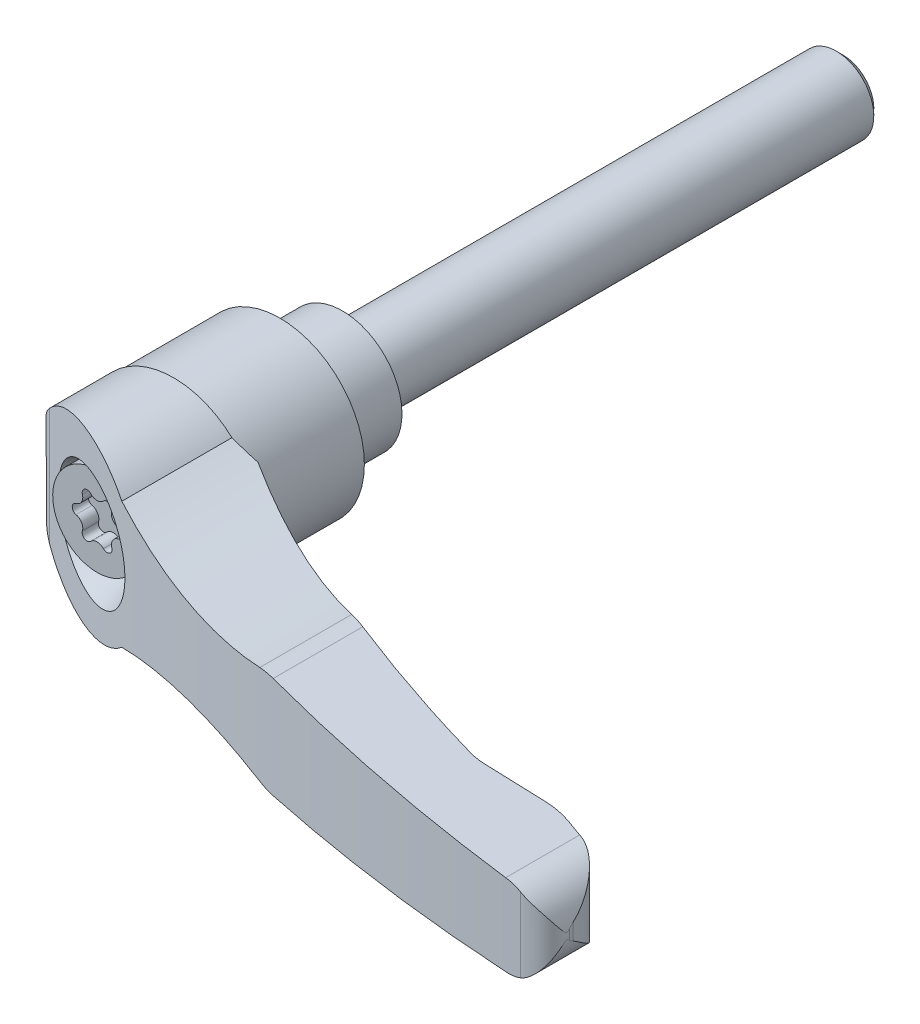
ISO-10303-21;
HEADER;
FILE_DESCRIPTION(('STEP AP214'),'2;1');
FILE_NAME('part.step','',(''),(''),'','','');
FILE_SCHEMA(('AUTOMOTIVE_DESIGN { 1 0 10303 214 1 1 1 1 }'));
ENDSEC;
DATA;
#1=APPLICATION_CONTEXT('core data for automotive mechanical design processes');
#2=APPLICATION_PROTOCOL_DEFINITION('international standard','automotive_design',2000,#1);
#3=PRODUCT_CONTEXT('',#1,'mechanical');
#4=PRODUCT('Part','Part','',(#3));
#5=PRODUCT_RELATED_PRODUCT_CATEGORY('part','',(#4));
#6=PRODUCT_DEFINITION_FORMATION('','',#4);
#7=PRODUCT_DEFINITION_CONTEXT('part definition',#1,'design');
#8=PRODUCT_DEFINITION('design','',#6,#7);
#9=PRODUCT_DEFINITION_SHAPE('','',#8);
#10=(LENGTH_UNIT() NAMED_UNIT(*) SI_UNIT(.MILLI.,.METRE.));
#11=(NAMED_UNIT(*) PLANE_ANGLE_UNIT() SI_UNIT($,.RADIAN.));
#12=(NAMED_UNIT(*) SI_UNIT($,.STERADIAN.) SOLID_ANGLE_UNIT());
#13=UNCERTAINTY_MEASURE_WITH_UNIT(LENGTH_MEASURE(1.E-05),#10,'distance_accuracy_value','');
#14=(GEOMETRIC_REPRESENTATION_CONTEXT(3) GLOBAL_UNCERTAINTY_ASSIGNED_CONTEXT((#13)) GLOBAL_UNIT_ASSIGNED_CONTEXT((#10,
#11,#12)) REPRESENTATION_CONTEXT('',''));
#15=CARTESIAN_POINT('',(0.,0.,0.));
#16=DIRECTION('',(0.,0.,1.));
#17=DIRECTION('',(1.,0.,0.));
#18=AXIS2_PLACEMENT_3D('',#15,#16,#17);
#19=CARTESIAN_POINT('',(4.92491375,0.,-80.));
#20=DIRECTION('',(0.,0.,-1.));
#21=DIRECTION('',(0.,1.,0.));
#22=AXIS2_PLACEMENT_3D('',#19,#20,#21);
#23=PLANE('',#22);
#24=CARTESIAN_POINT('',(0.,0.,-80.));
#25=DIRECTION('',(0.,0.,1.));
#26=DIRECTION('',(0.,-1.,0.));
#27=AXIS2_PLACEMENT_3D('',#24,#25,#26);
#28=CIRCLE('',#27,4.92491375);
#29=CARTESIAN_POINT('',(0.,-4.92491375,-80.));
#30=VERTEX_POINT('',#29);
#31=EDGE_CURVE('E347',#30,#30,#28,.T.);
#32=ORIENTED_EDGE('',*,*,#31,.F.);
#33=EDGE_LOOP('',(#32));
#34=FACE_BOUND('',#33,.T.);
#35=ADVANCED_FACE('F14',(#34),#23,.T.);
#36=CARTESIAN_POINT('',(0.,0.,-78.92491375));
#37=DIRECTION('',(0.,0.,1.));
#38=DIRECTION('',(0.,-1.,0.));
#39=AXIS2_PLACEMENT_3D('',#36,#37,#38);
#40=CONICAL_SURFACE('',#39,6.,0.78539816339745);
#41=ORIENTED_EDGE('',*,*,#31,.T.);
#42=EDGE_LOOP('',(#41));
#43=FACE_BOUND('',#42,.T.);
#44=CARTESIAN_POINT('',(0.,0.,-78.92491375));
#45=DIRECTION('',(0.,0.,1.));
#46=DIRECTION('',(0.,-1.,0.));
#47=AXIS2_PLACEMENT_3D('',#44,#45,#46);
#48=CIRCLE('',#47,6.);
#49=CARTESIAN_POINT('',(0.,-6.,-78.92491375));
#50=VERTEX_POINT('',#49);
#51=EDGE_CURVE('E350',#50,#50,#48,.T.);
#52=ORIENTED_EDGE('',*,*,#51,.F.);
#53=EDGE_LOOP('',(#52));
#54=FACE_BOUND('',#53,.T.);
#55=ADVANCED_FACE('F697',(#43,#54),#40,.T.);
#56=CARTESIAN_POINT('',(0.,0.,10.));
#57=DIRECTION('',(0.,0.,1.));
#58=DIRECTION('',(0.,-1.,0.));
#59=AXIS2_PLACEMENT_3D('',#56,#57,#58);
#60=CYLINDRICAL_SURFACE('',#59,6.);
#61=ORIENTED_EDGE('',*,*,#51,.T.);
#62=EDGE_LOOP('',(#61));
#63=FACE_BOUND('',#62,.T.);
#64=CARTESIAN_POINT('',(0.,0.,0.));
#65=DIRECTION('',(0.,0.,1.));
#66=DIRECTION('',(0.,-1.,0.));
#67=AXIS2_PLACEMENT_3D('',#64,#65,#66);
#68=CIRCLE('',#67,6.);
#69=CARTESIAN_POINT('',(0.,-6.,0.));
#70=VERTEX_POINT('',#69);
#71=EDGE_CURVE('E353',#70,#70,#68,.T.);
#72=ORIENTED_EDGE('',*,*,#71,.F.);
#73=EDGE_LOOP('',(#72));
#74=FACE_BOUND('',#73,.T.);
#75=ADVANCED_FACE('F701',(#63,#74),#60,.T.);
#76=CARTESIAN_POINT('',(9.5,0.,0.));
#77=DIRECTION('',(0.,0.,-1.));
#78=DIRECTION('',(0.,1.,0.));
#79=AXIS2_PLACEMENT_3D('',#76,#77,#78);
#80=PLANE('',#79);
#81=ORIENTED_EDGE('',*,*,#71,.T.);
#82=EDGE_LOOP('',(#81));
#83=FACE_BOUND('',#82,.T.);
#84=CARTESIAN_POINT('',(0.,0.,0.));
#85=DIRECTION('',(0.,0.,1.));
#86=DIRECTION('',(0.,-1.,0.));
#87=AXIS2_PLACEMENT_3D('',#84,#85,#86);
#88=CIRCLE('',#87,9.5);
#89=CARTESIAN_POINT('',(0.,-9.5,0.));
#90=VERTEX_POINT('',#89);
#91=EDGE_CURVE('E356',#90,#90,#88,.T.);
#92=ORIENTED_EDGE('',*,*,#91,.F.);
#93=EDGE_LOOP('',(#92));
#94=FACE_BOUND('',#93,.T.);
#95=ADVANCED_FACE('F650',(#83,#94),#80,.T.);
#96=CARTESIAN_POINT('',(0.,0.,10.));
#97=DIRECTION('',(0.,0.,1.));
#98=DIRECTION('',(0.,-1.,0.));
#99=AXIS2_PLACEMENT_3D('',#96,#97,#98);
#100=CYLINDRICAL_SURFACE('',#99,9.5);
#101=ORIENTED_EDGE('',*,*,#91,.T.);
#102=EDGE_LOOP('',(#101));
#103=FACE_BOUND('',#102,.T.);
#104=CARTESIAN_POINT('',(0.,0.,10.7));
#105=DIRECTION('',(0.,0.,-1.));
#106=DIRECTION('',(1.,0.,0.));
#107=AXIS2_PLACEMENT_3D('',#104,#105,#106);
#108=CIRCLE('',#107,9.5);
#109=CARTESIAN_POINT('',(9.5,0.,10.7));
#110=VERTEX_POINT('',#109);
#111=EDGE_CURVE('E9',#110,#110,#108,.T.);
#112=ORIENTED_EDGE('',*,*,#111,.T.);
#113=EDGE_LOOP('',(#112));
#114=FACE_BOUND('',#113,.T.);
#115=ADVANCED_FACE('F642',(#103,#114),#100,.T.);
#116=CARTESIAN_POINT('',(7.1,0.,36.66));
#117=DIRECTION('',(0.,0.,-1.));
#118=DIRECTION('',(0.,1.,0.));
#119=AXIS2_PLACEMENT_3D('',#116,#117,#118);
#120=PLANE('',#119);
#121=CARTESIAN_POINT('',(1.59,2.75396078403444,36.66));
#122=DIRECTION('',(0.,0.,-1.));
#123=DIRECTION('',(0.,1.,0.));
#124=AXIS2_PLACEMENT_3D('',#121,#122,#123);
#125=CIRCLE('',#124,0.795000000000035);
#126=CARTESIAN_POINT('',(2.3516351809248,2.5260642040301,36.66));
#127=VERTEX_POINT('',#126);
#128=CARTESIAN_POINT('',(1.0118181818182,3.2996079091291,36.66));
#129=VERTEX_POINT('',#128);
#130=EDGE_CURVE('E328',#127,#129,#125,.F.);
#131=ORIENTED_EDGE('',*,*,#130,.T.);
#132=CARTESIAN_POINT('',(0.,4.25449037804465,36.66));
#133=DIRECTION('',(0.,0.,-1.));
#134=DIRECTION('',(0.,1.,0.));
#135=AXIS2_PLACEMENT_3D('',#132,#133,#134);
#136=CIRCLE('',#135,1.39125000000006);
#137=CARTESIAN_POINT('',(-1.0118181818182,3.2996079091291,36.66));
#138=VERTEX_POINT('',#137);
#139=EDGE_CURVE('E286',#138,#129,#136,.F.);
#140=ORIENTED_EDGE('',*,*,#139,.F.);
#141=CARTESIAN_POINT('',(-1.58999999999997,2.75396078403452,36.66));
#142=DIRECTION('',(0.,0.,-1.));
#143=DIRECTION('',(0.,1.,0.));
#144=AXIS2_PLACEMENT_3D('',#141,#142,#143);
#145=CIRCLE('',#144,0.794999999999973);
#146=CARTESIAN_POINT('',(-2.3516351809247,2.5260642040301,36.66));
#147=VERTEX_POINT('',#146);
#148=EDGE_CURVE('E325',#138,#147,#145,.F.);
#149=ORIENTED_EDGE('',*,*,#148,.T.);
#150=CARTESIAN_POINT('',(-3.68449674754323,2.12724518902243,36.66));
#151=DIRECTION('',(0.,0.,-1.));
#152=DIRECTION('',(0.,1.,0.));
#153=AXIS2_PLACEMENT_3D('',#150,#151,#152);
#154=CIRCLE('',#153,1.39125000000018);
#155=CARTESIAN_POINT('',(-3.3634533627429,0.77354370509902,36.66));
#156=VERTEX_POINT('',#155);
#157=EDGE_CURVE('E281',#156,#147,#154,.F.);
#158=ORIENTED_EDGE('',*,*,#157,.F.);
#159=CARTESIAN_POINT('',(-3.18,0.,36.66));
#160=DIRECTION('',(0.,0.,-1.));
#161=DIRECTION('',(0.,1.,0.));
#162=AXIS2_PLACEMENT_3D('',#159,#160,#161);
#163=CIRCLE('',#162,0.795);
#164=CARTESIAN_POINT('',(-3.3634533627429,-0.77354370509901,36.66));
#165=VERTEX_POINT('',#164);
#166=EDGE_CURVE('E38',#156,#165,#163,.F.);
#167=ORIENTED_EDGE('',*,*,#166,.T.);
#168=CARTESIAN_POINT('',(-3.68449674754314,-2.12724518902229,36.66));
#169=DIRECTION('',(0.,0.,-1.));
#170=DIRECTION('',(0.,1.,0.));
#171=AXIS2_PLACEMENT_3D('',#168,#169,#170);
#172=CIRCLE('',#171,1.39125000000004);
#173=CARTESIAN_POINT('',(-2.3516351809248,-2.5260642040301,36.66));
#174=VERTEX_POINT('',#173);
#175=EDGE_CURVE('E273',#174,#165,#172,.F.);
#176=ORIENTED_EDGE('',*,*,#175,.F.);
#177=CARTESIAN_POINT('',(-1.59,-2.75396078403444,36.66));
#178=DIRECTION('',(0.,0.,-1.));
#179=DIRECTION('',(0.,1.,0.));
#180=AXIS2_PLACEMENT_3D('',#177,#178,#179);
#181=CIRCLE('',#180,0.795000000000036);
#182=CARTESIAN_POINT('',(-1.0118181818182,-3.2996079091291,36.66));
#183=VERTEX_POINT('',#182);
#184=EDGE_CURVE('E255',#174,#183,#181,.F.);
#185=ORIENTED_EDGE('',*,*,#184,.T.);
#186=CARTESIAN_POINT('',(0.,-4.25449037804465,36.66));
#187=DIRECTION('',(0.,0.,-1.));
#188=DIRECTION('',(0.,1.,0.));
#189=AXIS2_PLACEMENT_3D('',#186,#187,#188);
#190=CIRCLE('',#189,1.39125000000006);
#191=CARTESIAN_POINT('',(1.0118181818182,-3.2996079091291,36.66));
#192=VERTEX_POINT('',#191);
#193=EDGE_CURVE('E280',#192,#183,#190,.F.);
#194=ORIENTED_EDGE('',*,*,#193,.F.);
#195=CARTESIAN_POINT('',(1.58999999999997,-2.75396078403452,36.66));
#196=DIRECTION('',(0.,0.,-1.));
#197=DIRECTION('',(0.,1.,0.));
#198=AXIS2_PLACEMENT_3D('',#195,#196,#197);
#199=CIRCLE('',#198,0.794999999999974);
#200=CARTESIAN_POINT('',(2.3516351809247,-2.5260642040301,36.66));
#201=VERTEX_POINT('',#200);
#202=EDGE_CURVE('E338',#192,#201,#199,.F.);
#203=ORIENTED_EDGE('',*,*,#202,.T.);
#204=CARTESIAN_POINT('',(3.68449674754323,-2.12724518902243,36.66));
#205=DIRECTION('',(0.,0.,-1.));
#206=DIRECTION('',(0.,1.,0.));
#207=AXIS2_PLACEMENT_3D('',#204,#205,#206);
#208=CIRCLE('',#207,1.39125000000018);
#209=CARTESIAN_POINT('',(3.3634533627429,-0.773543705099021,36.66));
#210=VERTEX_POINT('',#209);
#211=EDGE_CURVE('E283',#210,#201,#208,.F.);
#212=ORIENTED_EDGE('',*,*,#211,.F.);
#213=CARTESIAN_POINT('',(3.18,0.,36.66));
#214=DIRECTION('',(0.,0.,-1.));
#215=DIRECTION('',(0.,1.,0.));
#216=AXIS2_PLACEMENT_3D('',#213,#214,#215);
#217=CIRCLE('',#216,0.795);
#218=CARTESIAN_POINT('',(3.3634533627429,0.77354370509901,36.66));
#219=VERTEX_POINT('',#218);
#220=EDGE_CURVE('E333',#210,#219,#217,.F.);
#221=ORIENTED_EDGE('',*,*,#220,.T.);
#222=CARTESIAN_POINT('',(3.68449674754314,2.12724518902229,36.66));
#223=DIRECTION('',(0.,0.,-1.));
#224=DIRECTION('',(0.,1.,0.));
#225=AXIS2_PLACEMENT_3D('',#222,#223,#224);
#226=CIRCLE('',#225,1.39125000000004);
#227=EDGE_CURVE('E292',#127,#219,#226,.F.);
#228=ORIENTED_EDGE('',*,*,#227,.F.);
#229=EDGE_LOOP('',(#131,#140,#149,#158,#167,#176,#185,#194,#203,#212,#221,#228));
#230=FACE_BOUND('',#229,.T.);
#231=ADVANCED_FACE('F278',(#230),#120,.F.);
#232=CARTESIAN_POINT('',(-3.68449674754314,-2.12724518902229,43.28));
#233=DIRECTION('',(0.,0.,-1.));
#234=DIRECTION('',(0.,1.,0.));
#235=AXIS2_PLACEMENT_3D('',#232,#233,#234);
#236=CYLINDRICAL_SURFACE('',#235,1.39125000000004);
#237=DIRECTION('',(0.,0.,-1.));
#238=VECTOR('',#237,1.);
#239=CARTESIAN_POINT('',(-2.3516351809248,-2.5260642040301,43.28));
#240=LINE('',#239,#238);
#241=CARTESIAN_POINT('',(-2.3516351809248,-2.5260642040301,39.23));
#242=VERTEX_POINT('',#241);
#243=EDGE_CURVE('E258',#242,#174,#240,.T.);
#244=ORIENTED_EDGE('',*,*,#243,.T.);
#245=ORIENTED_EDGE('',*,*,#175,.T.);
#246=DIRECTION('',(0.,0.,-1.));
#247=VECTOR('',#246,1.);
#248=CARTESIAN_POINT('',(-3.3634533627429,-0.77354370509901,43.28));
#249=LINE('',#248,#247);
#250=CARTESIAN_POINT('',(-3.3634533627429,-0.77354370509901,39.23));
#251=VERTEX_POINT('',#250);
#252=EDGE_CURVE('E276',#251,#165,#249,.T.);
#253=ORIENTED_EDGE('',*,*,#252,.F.);
#254=CARTESIAN_POINT('',(-3.68449674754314,-2.12724518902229,39.23));
#255=DIRECTION('',(0.,0.,1.));
#256=DIRECTION('',(0.,-1.,0.));
#257=AXIS2_PLACEMENT_3D('',#254,#255,#256);
#258=CIRCLE('',#257,1.39125000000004);
#259=EDGE_CURVE('E275',#242,#251,#258,.T.);
#260=ORIENTED_EDGE('',*,*,#259,.F.);
#261=EDGE_LOOP('',(#244,#245,#253,#260));
#262=FACE_BOUND('',#261,.T.);
#263=ADVANCED_FACE('F271',(#262),#236,.T.);
#264=CARTESIAN_POINT('',(-1.59,-2.75396078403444,43.28));
#265=DIRECTION('',(0.,0.,-1.));
#266=DIRECTION('',(0.,1.,0.));
#267=AXIS2_PLACEMENT_3D('',#264,#265,#266);
#268=CYLINDRICAL_SURFACE('',#267,0.795000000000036);
#269=DIRECTION('',(0.,0.,-1.));
#270=VECTOR('',#269,1.);
#271=CARTESIAN_POINT('',(-1.0118181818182,-3.2996079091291,43.28));
#272=LINE('',#271,#270);
#273=CARTESIAN_POINT('',(-1.0118181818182,-3.2996079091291,39.23));
#274=VERTEX_POINT('',#273);
#275=EDGE_CURVE('E261',#274,#183,#272,.T.);
#276=ORIENTED_EDGE('',*,*,#275,.T.);
#277=ORIENTED_EDGE('',*,*,#184,.F.);
#278=ORIENTED_EDGE('',*,*,#243,.F.);
#279=CARTESIAN_POINT('',(-1.59,-2.75396078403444,39.23));
#280=DIRECTION('',(0.,0.,1.));
#281=DIRECTION('',(0.,-1.,0.));
#282=AXIS2_PLACEMENT_3D('',#279,#280,#281);
#283=CIRCLE('',#282,0.795000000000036);
#284=EDGE_CURVE('E266',#274,#242,#283,.F.);
#285=ORIENTED_EDGE('',*,*,#284,.F.);
#286=EDGE_LOOP('',(#276,#277,#278,#285));
#287=FACE_BOUND('',#286,.T.);
#288=ADVANCED_FACE('F257',(#287),#268,.F.);
#289=CARTESIAN_POINT('',(0.,-4.25449037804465,43.28));
#290=DIRECTION('',(0.,0.,-1.));
#291=DIRECTION('',(0.,1.,0.));
#292=AXIS2_PLACEMENT_3D('',#289,#290,#291);
#293=CYLINDRICAL_SURFACE('',#292,1.39125000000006);
#294=DIRECTION('',(0.,0.,-1.));
#295=VECTOR('',#294,1.);
#296=CARTESIAN_POINT('',(1.0118181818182,-3.2996079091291,43.28));
#297=LINE('',#296,#295);
#298=CARTESIAN_POINT('',(1.0118181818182,-3.2996079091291,39.23));
#299=VERTEX_POINT('',#298);
#300=EDGE_CURVE('E318',#299,#192,#297,.T.);
#301=ORIENTED_EDGE('',*,*,#300,.T.);
#302=ORIENTED_EDGE('',*,*,#193,.T.);
#303=ORIENTED_EDGE('',*,*,#275,.F.);
#304=CARTESIAN_POINT('',(0.,-4.25449037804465,39.23));
#305=DIRECTION('',(0.,0.,1.));
#306=DIRECTION('',(0.,-1.,0.));
#307=AXIS2_PLACEMENT_3D('',#304,#305,#306);
#308=CIRCLE('',#307,1.39125000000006);
#309=EDGE_CURVE('E371',#299,#274,#308,.T.);
#310=ORIENTED_EDGE('',*,*,#309,.F.);
#311=EDGE_LOOP('',(#301,#302,#303,#310));
#312=FACE_BOUND('',#311,.T.);
#313=ADVANCED_FACE('F681',(#312),#293,.T.);
#314=CARTESIAN_POINT('',(1.58999999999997,-2.75396078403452,43.28));
#315=DIRECTION('',(0.,0.,-1.));
#316=DIRECTION('',(0.,1.,0.));
#317=AXIS2_PLACEMENT_3D('',#314,#315,#316);
#318=CYLINDRICAL_SURFACE('',#317,0.794999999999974);
#319=DIRECTION('',(0.,0.,-1.));
#320=VECTOR('',#319,1.);
#321=CARTESIAN_POINT('',(2.3516351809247,-2.5260642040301,43.28));
#322=LINE('',#321,#320);
#323=CARTESIAN_POINT('',(2.3516351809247,-2.5260642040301,39.23));
#324=VERTEX_POINT('',#323);
#325=EDGE_CURVE('E315',#324,#201,#322,.T.);
#326=ORIENTED_EDGE('',*,*,#325,.T.);
#327=ORIENTED_EDGE('',*,*,#202,.F.);
#328=ORIENTED_EDGE('',*,*,#300,.F.);
#329=CARTESIAN_POINT('',(1.58999999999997,-2.75396078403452,39.23));
#330=DIRECTION('',(0.,0.,1.));
#331=DIRECTION('',(0.,-1.,0.));
#332=AXIS2_PLACEMENT_3D('',#329,#330,#331);
#333=CIRCLE('',#332,0.794999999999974);
#334=EDGE_CURVE('E267',#324,#299,#333,.F.);
#335=ORIENTED_EDGE('',*,*,#334,.F.);
#336=EDGE_LOOP('',(#326,#327,#328,#335));
#337=FACE_BOUND('',#336,.T.);
#338=ADVANCED_FACE('F677',(#337),#318,.F.);
#339=CARTESIAN_POINT('',(3.68449674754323,-2.12724518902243,43.28));
#340=DIRECTION('',(0.,0.,-1.));
#341=DIRECTION('',(0.,1.,0.));
#342=AXIS2_PLACEMENT_3D('',#339,#340,#341);
#343=CYLINDRICAL_SURFACE('',#342,1.39125000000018);
#344=DIRECTION('',(0.,0.,-1.));
#345=VECTOR('',#344,1.);
#346=CARTESIAN_POINT('',(3.3634533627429,-0.773543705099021,43.28));
#347=LINE('',#346,#345);
#348=CARTESIAN_POINT('',(3.3634533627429,-0.773543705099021,39.23));
#349=VERTEX_POINT('',#348);
#350=EDGE_CURVE('E312',#349,#210,#347,.T.);
#351=ORIENTED_EDGE('',*,*,#350,.T.);
#352=ORIENTED_EDGE('',*,*,#211,.T.);
#353=ORIENTED_EDGE('',*,*,#325,.F.);
#354=CARTESIAN_POINT('',(3.68449674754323,-2.12724518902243,39.23));
#355=DIRECTION('',(0.,0.,1.));
#356=DIRECTION('',(0.,-1.,0.));
#357=AXIS2_PLACEMENT_3D('',#354,#355,#356);
#358=CIRCLE('',#357,1.39125000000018);
#359=EDGE_CURVE('E368',#349,#324,#358,.T.);
#360=ORIENTED_EDGE('',*,*,#359,.F.);
#361=EDGE_LOOP('',(#351,#352,#353,#360));
#362=FACE_BOUND('',#361,.T.);
#363=ADVANCED_FACE('F673',(#362),#343,.T.);
#364=CARTESIAN_POINT('',(3.18,0.,43.28));
#365=DIRECTION('',(0.,0.,-1.));
#366=DIRECTION('',(0.,1.,0.));
#367=AXIS2_PLACEMENT_3D('',#364,#365,#366);
#368=CYLINDRICAL_SURFACE('',#367,0.795);
#369=DIRECTION('',(0.,0.,-1.));
#370=VECTOR('',#369,1.);
#371=CARTESIAN_POINT('',(3.3634533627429,0.77354370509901,43.28));
#372=LINE('',#371,#370);
#373=CARTESIAN_POINT('',(3.3634533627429,0.77354370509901,39.23));
#374=VERTEX_POINT('',#373);
#375=EDGE_CURVE('E309',#374,#219,#372,.T.);
#376=ORIENTED_EDGE('',*,*,#375,.T.);
#377=ORIENTED_EDGE('',*,*,#220,.F.);
#378=ORIENTED_EDGE('',*,*,#350,.F.);
#379=CARTESIAN_POINT('',(3.18,0.,39.23));
#380=DIRECTION('',(0.,0.,1.));
#381=DIRECTION('',(0.,-1.,0.));
#382=AXIS2_PLACEMENT_3D('',#379,#380,#381);
#383=CIRCLE('',#382,0.795);
#384=EDGE_CURVE('E335',#374,#349,#383,.F.);
#385=ORIENTED_EDGE('',*,*,#384,.F.);
#386=EDGE_LOOP('',(#376,#377,#378,#385));
#387=FACE_BOUND('',#386,.T.);
#388=ADVANCED_FACE('F669',(#387),#368,.F.);
#389=CARTESIAN_POINT('',(3.68449674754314,2.12724518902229,43.28));
#390=DIRECTION('',(0.,0.,-1.));
#391=DIRECTION('',(0.,1.,0.));
#392=AXIS2_PLACEMENT_3D('',#389,#390,#391);
#393=CYLINDRICAL_SURFACE('',#392,1.39125000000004);
#394=DIRECTION('',(0.,0.,-1.));
#395=VECTOR('',#394,1.);
#396=CARTESIAN_POINT('',(2.3516351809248,2.5260642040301,43.28));
#397=LINE('',#396,#395);
#398=CARTESIAN_POINT('',(2.3516351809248,2.5260642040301,39.23));
#399=VERTEX_POINT('',#398);
#400=EDGE_CURVE('E306',#399,#127,#397,.T.);
#401=ORIENTED_EDGE('',*,*,#400,.T.);
#402=ORIENTED_EDGE('',*,*,#227,.T.);
#403=ORIENTED_EDGE('',*,*,#375,.F.);
#404=CARTESIAN_POINT('',(3.68449674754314,2.12724518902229,39.23));
#405=DIRECTION('',(0.,0.,1.));
#406=DIRECTION('',(0.,-1.,0.));
#407=AXIS2_PLACEMENT_3D('',#404,#405,#406);
#408=CIRCLE('',#407,1.39125000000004);
#409=EDGE_CURVE('E365',#399,#374,#408,.T.);
#410=ORIENTED_EDGE('',*,*,#409,.F.);
#411=EDGE_LOOP('',(#401,#402,#403,#410));
#412=FACE_BOUND('',#411,.T.);
#413=ADVANCED_FACE('F665',(#412),#393,.T.);
#414=CARTESIAN_POINT('',(1.59,2.75396078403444,43.28));
#415=DIRECTION('',(0.,0.,-1.));
#416=DIRECTION('',(0.,1.,0.));
#417=AXIS2_PLACEMENT_3D('',#414,#415,#416);
#418=CYLINDRICAL_SURFACE('',#417,0.795000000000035);
#419=ORIENTED_EDGE('',*,*,#130,.F.);
#420=ORIENTED_EDGE('',*,*,#400,.F.);
#421=CARTESIAN_POINT('',(1.59,2.75396078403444,39.23));
#422=DIRECTION('',(0.,0.,1.));
#423=DIRECTION('',(0.,-1.,0.));
#424=AXIS2_PLACEMENT_3D('',#421,#422,#423);
#425=CIRCLE('',#424,0.795000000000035);
#426=CARTESIAN_POINT('',(1.0118181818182,3.2996079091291,39.23));
#427=VERTEX_POINT('',#426);
#428=EDGE_CURVE('E330',#427,#399,#425,.F.);
#429=ORIENTED_EDGE('',*,*,#428,.F.);
#430=DIRECTION('',(0.,0.,-1.));
#431=VECTOR('',#430,1.);
#432=CARTESIAN_POINT('',(1.0118181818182,3.2996079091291,43.28));
#433=LINE('',#432,#431);
#434=EDGE_CURVE('E303',#427,#129,#433,.T.);
#435=ORIENTED_EDGE('',*,*,#434,.T.);
#436=EDGE_LOOP('',(#419,#420,#429,#435));
#437=FACE_BOUND('',#436,.T.);
#438=ADVANCED_FACE('F661',(#437),#418,.F.);
#439=CARTESIAN_POINT('',(0.,4.25449037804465,43.28));
#440=DIRECTION('',(0.,0.,-1.));
#441=DIRECTION('',(0.,1.,0.));
#442=AXIS2_PLACEMENT_3D('',#439,#440,#441);
#443=CYLINDRICAL_SURFACE('',#442,1.39125000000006);
#444=DIRECTION('',(0.,0.,-1.));
#445=VECTOR('',#444,1.);
#446=CARTESIAN_POINT('',(-1.0118181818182,3.2996079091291,43.28));
#447=LINE('',#446,#445);
#448=CARTESIAN_POINT('',(-1.0118181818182,3.2996079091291,39.23));
#449=VERTEX_POINT('',#448);
#450=EDGE_CURVE('E300',#449,#138,#447,.T.);
#451=ORIENTED_EDGE('',*,*,#450,.T.);
#452=ORIENTED_EDGE('',*,*,#139,.T.);
#453=ORIENTED_EDGE('',*,*,#434,.F.);
#454=CARTESIAN_POINT('',(0.,4.25449037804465,39.23));
#455=DIRECTION('',(0.,0.,1.));
#456=DIRECTION('',(0.,-1.,0.));
#457=AXIS2_PLACEMENT_3D('',#454,#455,#456);
#458=CIRCLE('',#457,1.39125000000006);
#459=EDGE_CURVE('E362',#449,#427,#458,.T.);
#460=ORIENTED_EDGE('',*,*,#459,.F.);
#461=EDGE_LOOP('',(#451,#452,#453,#460));
#462=FACE_BOUND('',#461,.T.);
#463=ADVANCED_FACE('F658',(#462),#443,.T.);
#464=CARTESIAN_POINT('',(-1.58999999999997,2.75396078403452,43.28));
#465=DIRECTION('',(0.,0.,-1.));
#466=DIRECTION('',(0.,1.,0.));
#467=AXIS2_PLACEMENT_3D('',#464,#465,#466);
#468=CYLINDRICAL_SURFACE('',#467,0.794999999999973);
#469=ORIENTED_EDGE('',*,*,#148,.F.);
#470=ORIENTED_EDGE('',*,*,#450,.F.);
#471=CARTESIAN_POINT('',(-1.58999999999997,2.75396078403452,39.23));
#472=DIRECTION('',(0.,0.,1.));
#473=DIRECTION('',(0.,-1.,0.));
#474=AXIS2_PLACEMENT_3D('',#471,#472,#473);
#475=CIRCLE('',#474,0.794999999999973);
#476=CARTESIAN_POINT('',(-2.3516351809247,2.5260642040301,39.23));
#477=VERTEX_POINT('',#476);
#478=EDGE_CURVE('E191',#477,#449,#475,.F.);
#479=ORIENTED_EDGE('',*,*,#478,.F.);
#480=DIRECTION('',(0.,0.,-1.));
#481=VECTOR('',#480,1.);
#482=CARTESIAN_POINT('',(-2.3516351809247,2.5260642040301,43.28));
#483=LINE('',#482,#481);
#484=EDGE_CURVE('E298',#477,#147,#483,.T.);
#485=ORIENTED_EDGE('',*,*,#484,.T.);
#486=EDGE_LOOP('',(#469,#470,#479,#485));
#487=FACE_BOUND('',#486,.T.);
#488=ADVANCED_FACE('F654',(#487),#468,.F.);
#489=CARTESIAN_POINT('',(-3.68449674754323,2.12724518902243,43.28));
#490=DIRECTION('',(0.,0.,-1.));
#491=DIRECTION('',(0.,1.,0.));
#492=AXIS2_PLACEMENT_3D('',#489,#490,#491);
#493=CYLINDRICAL_SURFACE('',#492,1.39125000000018);
#494=DIRECTION('',(0.,0.,-1.));
#495=VECTOR('',#494,1.);
#496=CARTESIAN_POINT('',(-3.3634533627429,0.77354370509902,43.28));
#497=LINE('',#496,#495);
#498=CARTESIAN_POINT('',(-3.3634533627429,0.77354370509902,39.23));
#499=VERTEX_POINT('',#498);
#500=EDGE_CURVE('E323',#499,#156,#497,.T.);
#501=ORIENTED_EDGE('',*,*,#500,.T.);
#502=ORIENTED_EDGE('',*,*,#157,.T.);
#503=ORIENTED_EDGE('',*,*,#484,.F.);
#504=CARTESIAN_POINT('',(-3.68449674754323,2.12724518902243,39.23));
#505=DIRECTION('',(0.,0.,1.));
#506=DIRECTION('',(0.,-1.,0.));
#507=AXIS2_PLACEMENT_3D('',#504,#505,#506);
#508=CIRCLE('',#507,1.39125000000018);
#509=EDGE_CURVE('E29',#499,#477,#508,.T.);
#510=ORIENTED_EDGE('',*,*,#509,.F.);
#511=EDGE_LOOP('',(#501,#502,#503,#510));
#512=FACE_BOUND('',#511,.T.);
#513=ADVANCED_FACE('F657',(#512),#493,.T.);
#514=CARTESIAN_POINT('',(-3.18,0.,43.28));
#515=DIRECTION('',(0.,0.,-1.));
#516=DIRECTION('',(0.,1.,0.));
#517=AXIS2_PLACEMENT_3D('',#514,#515,#516);
#518=CYLINDRICAL_SURFACE('',#517,0.795);
#519=ORIENTED_EDGE('',*,*,#252,.T.);
#520=ORIENTED_EDGE('',*,*,#166,.F.);
#521=ORIENTED_EDGE('',*,*,#500,.F.);
#522=CARTESIAN_POINT('',(-3.18,0.,39.23));
#523=DIRECTION('',(0.,0.,1.));
#524=DIRECTION('',(0.,-1.,0.));
#525=AXIS2_PLACEMENT_3D('',#522,#523,#524);
#526=CIRCLE('',#525,0.795);
#527=EDGE_CURVE('E344',#251,#499,#526,.F.);
#528=ORIENTED_EDGE('',*,*,#527,.F.);
#529=EDGE_LOOP('',(#519,#520,#521,#528));
#530=FACE_BOUND('',#529,.T.);
#531=ADVANCED_FACE('F688',(#530),#518,.F.);
#532=CARTESIAN_POINT('',(0.,0.,39.23));
#533=DIRECTION('',(0.,0.,1.));
#534=DIRECTION('',(0.,-1.,0.));
#535=AXIS2_PLACEMENT_3D('',#532,#533,#534);
#536=PLANE('',#535);
#537=CARTESIAN_POINT('',(0.,0.,39.23));
#538=DIRECTION('',(0.,0.,1.));
#539=DIRECTION('',(0.,-1.,0.));
#540=AXIS2_PLACEMENT_3D('',#537,#538,#539);
#541=CIRCLE('',#540,7.1);
#542=CARTESIAN_POINT('',(0.,-7.1,39.23));
#543=VERTEX_POINT('',#542);
#544=EDGE_CURVE('E359',#543,#543,#541,.T.);
#545=ORIENTED_EDGE('',*,*,#544,.T.);
#546=EDGE_LOOP('',(#545));
#547=FACE_BOUND('',#546,.T.);
#548=ORIENTED_EDGE('',*,*,#527,.T.);
#549=ORIENTED_EDGE('',*,*,#509,.T.);
#550=ORIENTED_EDGE('',*,*,#478,.T.);
#551=ORIENTED_EDGE('',*,*,#459,.T.);
#552=ORIENTED_EDGE('',*,*,#428,.T.);
#553=ORIENTED_EDGE('',*,*,#409,.T.);
#554=ORIENTED_EDGE('',*,*,#384,.T.);
#555=ORIENTED_EDGE('',*,*,#359,.T.);
#556=ORIENTED_EDGE('',*,*,#334,.T.);
#557=ORIENTED_EDGE('',*,*,#309,.T.);
#558=ORIENTED_EDGE('',*,*,#284,.T.);
#559=ORIENTED_EDGE('',*,*,#259,.T.);
#560=EDGE_LOOP('',(#548,#549,#550,#551,#552,#553,#554,#555,#556,#557,#558,#559));
#561=FACE_BOUND('',#560,.T.);
#562=ADVANCED_FACE('F691',(#547,#561),#536,.T.);
#563=CARTESIAN_POINT('',(0.,0.,10.));
#564=DIRECTION('',(0.,0.,1.));
#565=DIRECTION('',(0.,-1.,0.));
#566=AXIS2_PLACEMENT_3D('',#563,#564,#565);
#567=CYLINDRICAL_SURFACE('',#566,7.1);
#568=CARTESIAN_POINT('',(0.,0.,36.66));
#569=DIRECTION('',(0.,0.,-1.));
#570=DIRECTION('',(0.,1.,0.));
#571=AXIS2_PLACEMENT_3D('',#568,#569,#570);
#572=CIRCLE('',#571,7.1);
#573=CARTESIAN_POINT('',(0.,7.1,36.66));
#574=VERTEX_POINT('',#573);
#575=EDGE_CURVE('E295',#574,#574,#572,.F.);
#576=ORIENTED_EDGE('',*,*,#575,.T.);
#577=EDGE_LOOP('',(#576));
#578=FACE_BOUND('',#577,.T.);
#579=ORIENTED_EDGE('',*,*,#544,.F.);
#580=EDGE_LOOP('',(#579));
#581=FACE_BOUND('',#580,.T.);
#582=ADVANCED_FACE('F472',(#578,#581),#567,.T.);
#583=CARTESIAN_POINT('',(-0.010000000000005,0.,31.5));
#584=DIRECTION('',(0.,0.,-1.));
#585=DIRECTION('',(1.,0.,0.));
#586=AXIS2_PLACEMENT_3D('',#583,#584,#585);
#587=CYLINDRICAL_SURFACE('',#586,13.5);
#588=CARTESIAN_POINT('',(-0.0100000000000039,0.,27.));
#589=DIRECTION('',(0.,0.,1.));
#590=DIRECTION('',(0.,-1.,0.));
#591=AXIS2_PLACEMENT_3D('',#588,#589,#590);
#592=CIRCLE('',#591,13.5);
#593=CARTESIAN_POINT('',(-13.51,0.,27.));
#594=VERTEX_POINT('',#593);
#595=CARTESIAN_POINT('',(13.49,0.,27.));
#596=VERTEX_POINT('',#595);
#597=EDGE_CURVE('E731',#594,#596,#592,.T.);
#598=ORIENTED_EDGE('',*,*,#597,.F.);
#599=EDGE_CURVE('E735',#596,#594,#592,.T.);
#600=ORIENTED_EDGE('',*,*,#599,.F.);
#601=EDGE_LOOP('',(#598,#600));
#602=FACE_BOUND('',#601,.T.);
#603=CARTESIAN_POINT('',(-0.0099999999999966,0.,-3.250037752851));
#604=DIRECTION('',(0.707106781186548,0.,0.707106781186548));
#605=DIRECTION('',(0.707106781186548,0.,-0.707106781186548));
#606=AXIS2_PLACEMENT_3D('',#603,#604,#605);
#607=ELLIPSE('',#606,19.0918830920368,13.5);
#608=CARTESIAN_POINT('',(-13.260037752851,-2.58582666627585,10.));
#609=VERTEX_POINT('',#608);
#610=CARTESIAN_POINT('',(-13.260037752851,2.58582666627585,10.));
#611=VERTEX_POINT('',#610);
#612=EDGE_CURVE('E383',#609,#611,#607,.F.);
#613=ORIENTED_EDGE('',*,*,#612,.F.);
#614=CARTESIAN_POINT('',(-0.0099999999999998,0.,10.));
#615=DIRECTION('',(0.,0.,-1.));
#616=DIRECTION('',(1.,0.,0.));
#617=AXIS2_PLACEMENT_3D('',#614,#615,#616);
#618=CIRCLE('',#617,13.5);
#619=EDGE_CURVE('E182',#611,#609,#618,.T.);
#620=ORIENTED_EDGE('',*,*,#619,.F.);
#621=EDGE_LOOP('',(#613,#620));
#622=FACE_BOUND('',#621,.T.);
#623=ADVANCED_FACE('F463',(#602,#622),#587,.T.);
#624=CARTESIAN_POINT('',(-13.51,-27.5,10.249962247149));
#625=DIRECTION('',(0.707106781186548,0.,0.707106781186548));
#626=DIRECTION('',(-0.707106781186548,0.,0.707106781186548));
#627=AXIS2_PLACEMENT_3D('',#624,#625,#626);
#628=PLANE('',#627);
#629=ORIENTED_EDGE('',*,*,#612,.T.);
#630=DIRECTION('',(0.,1.,0.));
#631=VECTOR('',#630,1.);
#632=CARTESIAN_POINT('',(-13.260037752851,-27.5,10.));
#633=LINE('',#632,#631);
#634=EDGE_CURVE('E380',#609,#611,#633,.T.);
#635=ORIENTED_EDGE('',*,*,#634,.F.);
#636=EDGE_LOOP('',(#629,#635));
#637=FACE_BOUND('',#636,.T.);
#638=ADVANCED_FACE('F431',(#637),#628,.F.);
#639=CARTESIAN_POINT('',(-0.0099999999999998,0.,10.));
#640=DIRECTION('',(0.,0.,-1.));
#641=DIRECTION('',(1.,0.,0.));
#642=AXIS2_PLACEMENT_3D('',#639,#640,#641);
#643=PLANE('',#642);
#644=CARTESIAN_POINT('',(0.,0.,10.));
#645=DIRECTION('',(0.,0.,-1.));
#646=DIRECTION('',(1.,0.,0.));
#647=AXIS2_PLACEMENT_3D('',#644,#645,#646);
#648=CIRCLE('',#647,9.8);
#649=CARTESIAN_POINT('',(9.8,0.,10.));
#650=VERTEX_POINT('',#649);
#651=EDGE_CURVE('E818',#650,#650,#648,.T.);
#652=ORIENTED_EDGE('',*,*,#651,.F.);
#653=EDGE_LOOP('',(#652));
#654=FACE_BOUND('',#653,.T.);
#655=ORIENTED_EDGE('',*,*,#634,.T.);
#656=ORIENTED_EDGE('',*,*,#619,.T.);
#657=EDGE_LOOP('',(#655,#656));
#658=FACE_BOUND('',#657,.T.);
#659=ADVANCED_FACE('F464',(#654,#658),#643,.T.);
#660=CARTESIAN_POINT('',(0.,0.,10.));
#661=DIRECTION('',(0.,0.,1.));
#662=DIRECTION('',(0.,-1.,0.));
#663=AXIS2_PLACEMENT_3D('',#660,#661,#662);
#664=CYLINDRICAL_SURFACE('',#663,9.8);
#665=ORIENTED_EDGE('',*,*,#651,.T.);
#666=EDGE_LOOP('',(#665));
#667=FACE_BOUND('',#666,.T.);
#668=CARTESIAN_POINT('',(0.,0.,10.4));
#669=DIRECTION('',(0.,0.,1.));
#670=DIRECTION('',(0.,-1.,0.));
#671=AXIS2_PLACEMENT_3D('',#668,#669,#670);
#672=CIRCLE('',#671,9.8);
#673=CARTESIAN_POINT('',(0.,-9.8,10.4));
#674=VERTEX_POINT('',#673);
#675=EDGE_CURVE('E377',#674,#674,#672,.T.);
#676=ORIENTED_EDGE('',*,*,#675,.T.);
#677=EDGE_LOOP('',(#676));
#678=FACE_BOUND('',#677,.T.);
#679=ADVANCED_FACE('F468',(#667,#678),#664,.F.);
#680=CARTESIAN_POINT('',(0.,0.,10.7));
#681=DIRECTION('',(0.,0.,-1.));
#682=DIRECTION('',(0.,1.,0.));
#683=AXIS2_PLACEMENT_3D('',#680,#681,#682);
#684=CONICAL_SURFACE('',#683,9.5,0.785398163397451);
#685=ORIENTED_EDGE('',*,*,#675,.F.);
#686=EDGE_LOOP('',(#685));
#687=FACE_BOUND('',#686,.T.);
#688=ORIENTED_EDGE('',*,*,#111,.F.);
#689=EDGE_LOOP('',(#688));
#690=FACE_BOUND('',#689,.T.);
#691=ADVANCED_FACE('F717',(#687,#690),#684,.F.);
#692=CARTESIAN_POINT('',(-13.51,-14.75,27.));
#693=DIRECTION('',(0.,0.,1.));
#694=DIRECTION('',(0.,-1.,0.));
#695=AXIS2_PLACEMENT_3D('',#692,#693,#694);
#696=PLANE('',#695);
#697=CARTESIAN_POINT('',(29.1499999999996,-64.9100000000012,27.));
#698=DIRECTION('',(0.,0.,1.));
#699=DIRECTION('',(0.,-1.,0.));
#700=AXIS2_PLACEMENT_3D('',#697,#698,#699);
#701=CIRCLE('',#700,58.2800000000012);
#702=CARTESIAN_POINT('',(9.32365402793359,-10.106036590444,27.));
#703=VERTEX_POINT('',#702);
#704=CARTESIAN_POINT('',(13.49,-8.77335599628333,27.));
#705=VERTEX_POINT('',#704);
#706=EDGE_CURVE('E537',#703,#705,#701,.F.);
#707=ORIENTED_EDGE('',*,*,#706,.F.);
#708=CARTESIAN_POINT('',(0.,0.,27.));
#709=DIRECTION('',(0.,0.,1.));
#710=DIRECTION('',(0.,-1.,0.));
#711=AXIS2_PLACEMENT_3D('',#708,#709,#710);
#712=CIRCLE('',#711,13.75);
#713=CARTESIAN_POINT('',(-13.51,-2.55781156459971,27.));
#714=VERTEX_POINT('',#713);
#715=EDGE_CURVE('E793',#714,#703,#712,.T.);
#716=ORIENTED_EDGE('',*,*,#715,.F.);
#717=DIRECTION('',(0.,1.,0.));
#718=VECTOR('',#717,1.);
#719=CARTESIAN_POINT('',(-13.51,-14.75,27.));
#720=LINE('',#719,#718);
#721=EDGE_CURVE('E769',#714,#594,#720,.T.);
#722=ORIENTED_EDGE('',*,*,#721,.T.);
#723=ORIENTED_EDGE('',*,*,#597,.T.);
#724=DIRECTION('',(0.,1.,0.));
#725=VECTOR('',#724,1.);
#726=CARTESIAN_POINT('',(13.49,-14.75,27.));
#727=LINE('',#726,#725);
#728=EDGE_CURVE('E767',#705,#596,#727,.T.);
#729=ORIENTED_EDGE('',*,*,#728,.F.);
#730=EDGE_LOOP('',(#707,#716,#722,#723,#729));
#731=FACE_BOUND('',#730,.T.);
#732=ADVANCED_FACE('F515',(#731),#696,.F.);
#733=CARTESIAN_POINT('',(-13.51,-14.75,31.41356721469));
#734=DIRECTION('',(1.,0.,0.));
#735=DIRECTION('',(0.,1.,0.));
#736=AXIS2_PLACEMENT_3D('',#733,#734,#735);
#737=PLANE('',#736);
#738=DIRECTION('',(0.,0.,1.));
#739=VECTOR('',#738,1.);
#740=CARTESIAN_POINT('',(-13.51,2.55781156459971,0.));
#741=LINE('',#740,#739);
#742=CARTESIAN_POINT('',(-13.51,2.55781156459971,27.));
#743=VERTEX_POINT('',#742);
#744=CARTESIAN_POINT('',(-13.51,2.55781156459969,31.41356721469));
#745=VERTEX_POINT('',#744);
#746=EDGE_CURVE('E416',#743,#745,#741,.T.);
#747=ORIENTED_EDGE('',*,*,#746,.F.);
#748=EDGE_CURVE('E768',#594,#743,#720,.T.);
#749=ORIENTED_EDGE('',*,*,#748,.F.);
#750=ORIENTED_EDGE('',*,*,#721,.F.);
#751=DIRECTION('',(0.,0.,1.));
#752=VECTOR('',#751,1.);
#753=CARTESIAN_POINT('',(-13.51,-2.55781156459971,0.));
#754=LINE('',#753,#752);
#755=CARTESIAN_POINT('',(-13.51,-2.55781156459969,31.41356721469));
#756=VERTEX_POINT('',#755);
#757=EDGE_CURVE('E787',#756,#714,#754,.F.);
#758=ORIENTED_EDGE('',*,*,#757,.F.);
#759=DIRECTION('',(0.,1.,0.));
#760=VECTOR('',#759,1.);
#761=CARTESIAN_POINT('',(-13.51,-14.75,31.41356721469));
#762=LINE('',#761,#760);
#763=EDGE_CURVE('E175',#756,#745,#762,.T.);
#764=ORIENTED_EDGE('',*,*,#763,.T.);
#765=EDGE_LOOP('',(#747,#749,#750,#758,#764));
#766=FACE_BOUND('',#765,.T.);
#767=ADVANCED_FACE('F16',(#766),#737,.F.);
#768=CARTESIAN_POINT('',(29.1499999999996,64.9100000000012,27.));
#769=DIRECTION('',(0.,0.,1.));
#770=DIRECTION('',(0.,-1.,0.));
#771=AXIS2_PLACEMENT_3D('',#768,#769,#770);
#772=CIRCLE('',#771,58.2800000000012);
#773=CARTESIAN_POINT('',(13.49,8.77335599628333,27.));
#774=VERTEX_POINT('',#773);
#775=CARTESIAN_POINT('',(9.3236540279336,10.106036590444,27.));
#776=VERTEX_POINT('',#775);
#777=EDGE_CURVE('E732',#774,#776,#772,.F.);
#778=ORIENTED_EDGE('',*,*,#777,.F.);
#779=EDGE_CURVE('E766',#596,#774,#727,.T.);
#780=ORIENTED_EDGE('',*,*,#779,.F.);
#781=ORIENTED_EDGE('',*,*,#599,.T.);
#782=ORIENTED_EDGE('',*,*,#748,.T.);
#783=CARTESIAN_POINT('',(0.,0.,27.));
#784=DIRECTION('',(0.,0.,1.));
#785=DIRECTION('',(0.,-1.,0.));
#786=AXIS2_PLACEMENT_3D('',#783,#784,#785);
#787=CIRCLE('',#786,13.75);
#788=EDGE_CURVE('E780',#776,#743,#787,.T.);
#789=ORIENTED_EDGE('',*,*,#788,.F.);
#790=EDGE_LOOP('',(#778,#780,#781,#782,#789));
#791=FACE_BOUND('',#790,.T.);
#792=ADVANCED_FACE('F517',(#791),#696,.F.);
#793=CARTESIAN_POINT('',(71.6523269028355,-14.75,38.8899999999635));
#794=DIRECTION('',(0.,1.,0.));
#795=DIRECTION('',(-1.,0.,0.));
#796=AXIS2_PLACEMENT_3D('',#793,#794,#795);
#797=CYLINDRICAL_SURFACE('',#796,10.0800000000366);
#798=CARTESIAN_POINT('',(71.6523269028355,7.11188734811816,38.8899999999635));
#799=DIRECTION('',(0.0362948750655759,0.999341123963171,0.));
#800=DIRECTION('',(-0.999341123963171,0.0362948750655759,0.));
#801=AXIS2_PLACEMENT_3D('',#798,#799,#800);
#802=ELLIPSE('',#801,10.0866458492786,10.0800000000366);
#803=CARTESIAN_POINT('',(71.65232690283,7.11188734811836,48.97));
#804=VERTEX_POINT('',#803);
#805=CARTESIAN_POINT('',(69.134411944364,7.20333500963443,48.6504561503));
#806=VERTEX_POINT('',#805);
#807=EDGE_CURVE('E1400',#804,#806,#802,.F.);
#808=ORIENTED_EDGE('',*,*,#807,.F.);
#809=DIRECTION('',(0.,1.,0.));
#810=VECTOR('',#809,1.);
#811=CARTESIAN_POINT('',(71.65232690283,-14.75,48.97));
#812=LINE('',#811,#810);
#813=CARTESIAN_POINT('',(71.65232690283,-7.11188734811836,48.97));
#814=VERTEX_POINT('',#813);
#815=EDGE_CURVE('E760',#814,#804,#812,.T.);
#816=ORIENTED_EDGE('',*,*,#815,.F.);
#817=CARTESIAN_POINT('',(71.6523269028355,-7.11188734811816,38.8899999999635));
#818=DIRECTION('',(0.0362948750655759,-0.999341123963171,0.));
#819=DIRECTION('',(0.999341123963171,0.0362948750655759,0.));
#820=AXIS2_PLACEMENT_3D('',#817,#818,#819);
#821=ELLIPSE('',#820,10.0866458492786,10.0800000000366);
#822=CARTESIAN_POINT('',(69.134411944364,-7.20333500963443,48.6504561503));
#823=VERTEX_POINT('',#822);
#824=EDGE_CURVE('E1393',#823,#814,#821,.F.);
#825=ORIENTED_EDGE('',*,*,#824,.F.);
#826=DIRECTION('',(0.,1.,0.));
#827=VECTOR('',#826,1.);
#828=CARTESIAN_POINT('',(69.134411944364,-14.75,48.6504561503));
#829=LINE('',#828,#827);
#830=EDGE_CURVE('E763',#823,#806,#829,.T.);
#831=ORIENTED_EDGE('',*,*,#830,.T.);
#832=EDGE_LOOP('',(#808,#816,#825,#831));
#833=FACE_BOUND('',#832,.T.);
#834=ADVANCED_FACE('F514',(#833),#797,.F.);
#835=CARTESIAN_POINT('',(71.65232690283,-14.75,48.97));
#836=DIRECTION('',(0.,0.,1.));
#837=DIRECTION('',(0.,-1.,0.));
#838=AXIS2_PLACEMENT_3D('',#835,#836,#837);
#839=PLANE('',#838);
#840=DIRECTION('',(-0.999341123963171,0.0362948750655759,0.));
#841=VECTOR('',#840,1.);
#842=CARTESIAN_POINT('',(72.4452785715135,7.08308829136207,48.97));
#843=LINE('',#842,#841);
#844=CARTESIAN_POINT('',(81.467303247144,6.7554191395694,48.97));
#845=VERTEX_POINT('',#844);
#846=EDGE_CURVE('E1401',#845,#804,#843,.T.);
#847=ORIENTED_EDGE('',*,*,#846,.F.);
#848=DIRECTION('',(0.,1.,0.));
#849=VECTOR('',#848,1.);
#850=CARTESIAN_POINT('',(81.467303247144,-14.75,48.97));
#851=LINE('',#850,#849);
#852=CARTESIAN_POINT('',(81.467303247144,-6.7554191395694,48.97));
#853=VERTEX_POINT('',#852);
#854=EDGE_CURVE('E757',#853,#845,#851,.T.);
#855=ORIENTED_EDGE('',*,*,#854,.F.);
#856=DIRECTION('',(0.999341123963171,0.0362948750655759,0.));
#857=VECTOR('',#856,1.);
#858=CARTESIAN_POINT('',(71.3752852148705,-7.12194917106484,48.97));
#859=LINE('',#858,#857);
#860=EDGE_CURVE('E1398',#814,#853,#859,.T.);
#861=ORIENTED_EDGE('',*,*,#860,.F.);
#862=ORIENTED_EDGE('',*,*,#815,.T.);
#863=EDGE_LOOP('',(#847,#855,#861,#862));
#864=FACE_BOUND('',#863,.T.);
#865=ADVANCED_FACE('F630',(#864),#839,.F.);
#866=CARTESIAN_POINT('',(81.4673032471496,-14.75,62.3599999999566));
#867=DIRECTION('',(0.,1.,0.));
#868=DIRECTION('',(-1.,0.,0.));
#869=AXIS2_PLACEMENT_3D('',#866,#867,#868);
#870=CYLINDRICAL_SURFACE('',#869,13.3899999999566);
#871=CARTESIAN_POINT('',(81.4673032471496,6.7554191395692,62.3599999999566));
#872=DIRECTION('',(0.0362948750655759,0.999341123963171,0.));
#873=DIRECTION('',(-0.999341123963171,0.0362948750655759,0.));
#874=AXIS2_PLACEMENT_3D('',#871,#872,#873);
#875=ELLIPSE('',#874,13.3988281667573,13.3899999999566);
#876=CARTESIAN_POINT('',(85.718228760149,6.60103060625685,49.662687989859));
#877=VERTEX_POINT('',#876);
#878=EDGE_CURVE('E1402',#877,#845,#875,.T.);
#879=ORIENTED_EDGE('',*,*,#878,.F.);
#880=DIRECTION('',(0.,1.,0.));
#881=VECTOR('',#880,1.);
#882=CARTESIAN_POINT('',(85.718228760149,-14.75,49.662687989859));
#883=LINE('',#882,#881);
#884=CARTESIAN_POINT('',(85.718228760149,-6.60103060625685,49.662687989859));
#885=VERTEX_POINT('',#884);
#886=EDGE_CURVE('E754',#885,#877,#883,.T.);
#887=ORIENTED_EDGE('',*,*,#886,.F.);
#888=CARTESIAN_POINT('',(81.4673032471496,-6.75541913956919,62.3599999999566));
#889=DIRECTION('',(0.0362948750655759,-0.999341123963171,0.));
#890=DIRECTION('',(0.999341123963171,0.0362948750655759,0.));
#891=AXIS2_PLACEMENT_3D('',#888,#889,#890);
#892=ELLIPSE('',#891,13.3988281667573,13.3899999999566);
#893=EDGE_CURVE('E1426',#853,#885,#892,.T.);
#894=ORIENTED_EDGE('',*,*,#893,.F.);
#895=ORIENTED_EDGE('',*,*,#854,.T.);
#896=EDGE_LOOP('',(#879,#887,#894,#895));
#897=FACE_BOUND('',#896,.T.);
#898=ADVANCED_FACE('F512',(#897),#870,.T.);
#899=CARTESIAN_POINT('',(132.162219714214,-14.75,-195.670803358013));
#900=DIRECTION('',(0.,1.,0.));
#901=DIRECTION('',(-1.,0.,0.));
#902=AXIS2_PLACEMENT_3D('',#899,#900,#901);
#903=CYLINDRICAL_SURFACE('',#902,252.32);
#904=CARTESIAN_POINT('',(41.130092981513,-7.8746094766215,39.6556386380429));
#905=CARTESIAN_POINT('',(41.3631798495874,-7.92357282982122,39.745806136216));
#906=CARTESIAN_POINT('',(41.5977017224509,-7.96541673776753,39.836127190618));
#907=CARTESIAN_POINT('',(42.068096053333,-8.03464826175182,40.0164774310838));
#908=CARTESIAN_POINT('',(42.3039617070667,-8.06208211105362,40.106506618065));
#909=CARTESIAN_POINT('',(42.7770394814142,-8.10259351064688,40.2862604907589));
#910=CARTESIAN_POINT('',(43.0142516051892,-8.11567102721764,40.3759851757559));
#911=CARTESIAN_POINT('',(43.4900263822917,-8.12742192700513,40.5551257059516));
#912=CARTESIAN_POINT('',(43.7285909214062,-8.12604852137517,40.6445396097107));
#913=CARTESIAN_POINT('',(43.967061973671,-8.1173830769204,40.7335040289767));
#914=B_SPLINE_CURVE_WITH_KNOTS('',3,(#904,#905,#906,#907,#908,#909,#910,#911,#912,#913),
.UNSPECIFIED.,.F.,.F.,(4,2,2,2,4),(0.,0.763906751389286,1.52534737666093,2.28678979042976,
3.05069834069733),.UNSPECIFIED.);
#915=CARTESIAN_POINT('',(41.130092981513,-7.8746094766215,39.6556386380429));
#916=VERTEX_POINT('',#915);
#917=CARTESIAN_POINT('',(43.967061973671,-8.1173830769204,40.7335040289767));
#918=VERTEX_POINT('',#917);
#919=EDGE_CURVE('E530',#916,#918,#914,.T.);
#920=ORIENTED_EDGE('',*,*,#919,.F.);
#921=CARTESIAN_POINT('',(13.49,-8.77335599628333,27.));
#922=CARTESIAN_POINT('',(14.3166465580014,-8.54275177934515,27.4405727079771));
#923=CARTESIAN_POINT('',(15.1496632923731,-8.33005321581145,27.8786057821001));
#924=CARTESIAN_POINT('',(16.8273061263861,-7.9411393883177,28.7487404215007));
#925=CARTESIAN_POINT('',(17.6719330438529,-7.76492670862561,29.1808415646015));
#926=CARTESIAN_POINT('',(19.3724293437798,-7.44952599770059,30.0386421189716));
#927=CARTESIAN_POINT('',(20.2283094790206,-7.31037656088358,30.4643344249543));
#928=CARTESIAN_POINT('',(21.9491324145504,-7.07004305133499,31.307997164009));
#929=CARTESIAN_POINT('',(22.8140749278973,-6.96885778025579,31.7259678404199));
#930=CARTESIAN_POINT('',(24.5350860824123,-6.80669813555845,32.5454833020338));
#931=CARTESIAN_POINT('',(25.3910090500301,-6.74499321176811,32.9471893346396));
#932=CARTESIAN_POINT('',(27.1088771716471,-6.65940525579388,33.7416486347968));
#933=CARTESIAN_POINT('',(27.9708222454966,-6.63552172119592,34.1344020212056));
#934=CARTESIAN_POINT('',(29.6986634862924,-6.62618362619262,34.9099811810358));
#935=CARTESIAN_POINT('',(30.5645565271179,-6.64070263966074,35.2928135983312));
#936=CARTESIAN_POINT('',(32.2992228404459,-6.70867652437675,36.0481188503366));
#937=CARTESIAN_POINT('',(33.1679957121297,-6.76212618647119,36.4205930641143));
#938=CARTESIAN_POINT('',(34.6268488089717,-6.88489763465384,37.0364018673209));
#939=CARTESIAN_POINT('',(35.2165958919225,-6.94356773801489,37.2827020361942));
#940=CARTESIAN_POINT('',(36.3960639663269,-7.07916680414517,37.7700518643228));
#941=CARTESIAN_POINT('',(36.9857849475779,-7.15609292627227,38.0111023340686));
#942=CARTESIAN_POINT('',(38.1685844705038,-7.32890004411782,38.4893735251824));
#943=CARTESIAN_POINT('',(38.7616596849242,-7.42490197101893,38.7265587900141));
#944=CARTESIAN_POINT('',(39.9468048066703,-7.63566191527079,39.1953419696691));
#945=CARTESIAN_POINT('',(40.5388745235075,-7.75042315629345,39.4269389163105));
#946=CARTESIAN_POINT('',(41.130092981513,-7.8746094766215,39.6556386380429));
#947=B_SPLINE_CURVE_WITH_KNOTS('',3,(#921,#922,#923,#924,#925,#926,#927,#928,#929,#930,#931,
#932,#933,#934,#935,#936,#937,#938,#939,#940,#941,#942,#943,#944,#945,#946),.UNSPECIFIED.,.F.,
.F.,(4,2,2,2,2,2,2,2,2,2,2,2,4),(0.,2.89390785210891,5.78802060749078,8.68513535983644,
11.5821586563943,14.4238938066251,17.2655912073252,20.1053336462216,22.9446961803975,
24.8698413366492,26.7946871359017,28.7321489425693,30.6699440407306),.UNSPECIFIED.);
#948=EDGE_CURVE('E521',#705,#916,#947,.T.);
#949=ORIENTED_EDGE('',*,*,#948,.F.);
#950=ORIENTED_EDGE('',*,*,#728,.T.);
#951=ORIENTED_EDGE('',*,*,#779,.T.);
#952=CARTESIAN_POINT('',(41.130092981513,7.8746094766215,39.6556386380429));
#953=CARTESIAN_POINT('',(40.2468666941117,7.6890779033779,39.3139933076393));
#954=CARTESIAN_POINT('',(39.3617638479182,7.52459842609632,38.9658739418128));
#955=CARTESIAN_POINT('',(37.5897998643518,7.23736069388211,38.2572801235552));
#956=CARTESIAN_POINT('',(36.7029388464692,7.11459969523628,37.8968064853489));
#957=CARTESIAN_POINT('',(34.9294341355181,6.9104028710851,37.1640922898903));
#958=CARTESIAN_POINT('',(34.0427904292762,6.8289625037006,36.7918530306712));
#959=CARTESIAN_POINT('',(32.2715033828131,6.70688253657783,36.0362417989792));
#960=CARTESIAN_POINT('',(31.3868600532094,6.66624315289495,35.6528697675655));
#961=CARTESIAN_POINT('',(28.7704435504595,6.60545291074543,34.5011035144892));
#962=CARTESIAN_POINT('',(27.0436661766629,6.64276527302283,33.7176215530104));
#963=CARTESIAN_POINT('',(23.6170342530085,6.86784257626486,32.1161606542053));
#964=CARTESIAN_POINT('',(21.9171693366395,7.05554807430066,31.2981954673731));
#965=CARTESIAN_POINT('',(19.6661800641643,7.40392758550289,30.1840812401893));
#966=CARTESIAN_POINT('',(19.098398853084,7.50046620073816,29.9003744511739));
#967=CARTESIAN_POINT('',(17.9675115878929,7.7099921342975,29.3299782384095));
#968=CARTESIAN_POINT('',(17.4044045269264,7.82297580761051,29.0432894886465));
#969=CARTESIAN_POINT('',(16.2796310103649,8.06595772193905,28.4653390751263));
#970=CARTESIAN_POINT('',(15.7179955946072,8.19605796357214,28.1740600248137));
#971=CARTESIAN_POINT('',(14.5999573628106,8.47254503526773,27.588900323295));
#972=CARTESIAN_POINT('',(14.0435556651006,8.61893526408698,27.2950191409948));
#973=CARTESIAN_POINT('',(13.49,8.77335599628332,27.));
#974=B_SPLINE_CURVE_WITH_KNOTS('',3,(#952,#953,#954,#955,#956,#957,#958,#959,#960,#961,#962,
#963,#964,#965,#966,#967,#968,#969,#970,#971,#972,#973),.UNSPECIFIED.,.F.,.F.,(4,2,2,2,2,2,2,2,
2,2,4),(0.,2.89469970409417,5.78920899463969,8.68340005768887,11.577606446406,17.2602540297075,
22.9406566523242,24.866551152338,26.7920194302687,28.7295308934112,30.6674473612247),.UNSPECIFIED.);
#975=CARTESIAN_POINT('',(41.130092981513,7.8746094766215,39.6556386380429));
#976=VERTEX_POINT('',#975);
#977=EDGE_CURVE('E499',#976,#774,#974,.T.);
#978=ORIENTED_EDGE('',*,*,#977,.F.);
#979=CARTESIAN_POINT('',(43.967061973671,8.1173830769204,40.7335040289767));
#980=CARTESIAN_POINT('',(43.7285909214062,8.12604852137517,40.6445396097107));
#981=CARTESIAN_POINT('',(43.4900263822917,8.12742192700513,40.5551257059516));
#982=CARTESIAN_POINT('',(43.0142516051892,8.11567102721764,40.3759851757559));
#983=CARTESIAN_POINT('',(42.7770394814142,8.10259351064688,40.2862604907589));
#984=CARTESIAN_POINT('',(42.3039617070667,8.06208211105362,40.106506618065));
#985=CARTESIAN_POINT('',(42.068096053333,8.03464826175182,40.0164774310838));
#986=CARTESIAN_POINT('',(41.5977017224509,7.96541673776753,39.836127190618));
#987=CARTESIAN_POINT('',(41.3631798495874,7.92357282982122,39.745806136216));
#988=CARTESIAN_POINT('',(41.130092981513,7.8746094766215,39.6556386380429));
#989=B_SPLINE_CURVE_WITH_KNOTS('',3,(#979,#980,#981,#982,#983,#984,#985,#986,#987,#988),
.UNSPECIFIED.,.F.,.F.,(4,2,2,2,4),(0.,0.763908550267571,1.5253509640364,2.28679158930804,
3.05069834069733),.UNSPECIFIED.);
#990=CARTESIAN_POINT('',(43.967061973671,8.1173830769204,40.7335040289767));
#991=VERTEX_POINT('',#990);
#992=EDGE_CURVE('E491',#991,#976,#989,.T.);
#993=ORIENTED_EDGE('',*,*,#992,.F.);
#994=CARTESIAN_POINT('',(132.162219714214,4.9142403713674,-195.670803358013));
#995=DIRECTION('',(0.0362948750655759,0.999341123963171,0.));
#996=DIRECTION('',(-0.999341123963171,0.0362948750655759,0.));
#997=AXIS2_PLACEMENT_3D('',#994,#995,#996);
#998=ELLIPSE('',#997,252.486357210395,252.32);
#999=EDGE_CURVE('E500',#806,#991,#998,.F.);
#1000=ORIENTED_EDGE('',*,*,#999,.F.);
#1001=ORIENTED_EDGE('',*,*,#830,.F.);
#1002=CARTESIAN_POINT('',(132.162219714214,-4.9142403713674,-195.670803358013));
#1003=DIRECTION('',(0.0362948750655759,-0.999341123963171,0.));
#1004=DIRECTION('',(0.999341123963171,0.0362948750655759,0.));
#1005=AXIS2_PLACEMENT_3D('',#1002,#1003,#1004);
#1006=ELLIPSE('',#1005,252.486357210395,252.32);
#1007=EDGE_CURVE('E1391',#918,#823,#1006,.F.);
#1008=ORIENTED_EDGE('',*,*,#1007,.F.);
#1009=EDGE_LOOP('',(#920,#949,#950,#951,#978,#993,#1000,#1001,#1008));
#1010=FACE_BOUND('',#1009,.T.);
#1011=ADVANCED_FACE('F507',(#1010),#903,.F.);
#1012=CARTESIAN_POINT('',(86.1065455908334,-14.75,59.104403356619));
#1013=DIRECTION('',(0.,1.,0.));
#1014=DIRECTION('',(-1.,0.,0.));
#1015=AXIS2_PLACEMENT_3D('',#1012,#1013,#1014);
#1016=CYLINDRICAL_SURFACE('',#1015,8.83000000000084);
#1017=CARTESIAN_POINT('',(88.909807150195,-6.4870685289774,50.731194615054));
#1018=CARTESIAN_POINT('',(89.0897697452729,-6.47572771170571,50.79139886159));
#1019=CARTESIAN_POINT('',(89.267235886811,-6.45697335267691,50.8573067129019));
#1020=CARTESIAN_POINT('',(89.6156587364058,-6.4059465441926,50.9994566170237));
#1021=CARTESIAN_POINT('',(89.7866254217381,-6.37369580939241,51.0756819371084));
#1022=CARTESIAN_POINT('',(90.1193873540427,-6.29733777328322,51.2367553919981));
#1023=CARTESIAN_POINT('',(90.2812591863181,-6.25335658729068,51.3215061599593));
#1024=CARTESIAN_POINT('',(90.5970344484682,-6.15465850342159,51.4993225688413));
#1025=CARTESIAN_POINT('',(90.750933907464,-6.09993631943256,51.5923922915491));
#1026=CARTESIAN_POINT('',(91.0845425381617,-5.96735555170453,51.8080731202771));
#1027=CARTESIAN_POINT('',(91.2620732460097,-5.88706921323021,51.9325631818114));
#1028=CARTESIAN_POINT('',(91.6037719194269,-5.71430400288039,52.1909876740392));
#1029=CARTESIAN_POINT('',(91.7679381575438,-5.62182355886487,52.324923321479));
#1030=CARTESIAN_POINT('',(92.0835205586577,-5.42614069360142,52.6014136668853));
#1031=CARTESIAN_POINT('',(92.2348770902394,-5.32289263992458,52.7440038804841));
#1032=CARTESIAN_POINT('',(92.5241674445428,-5.10769832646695,53.0360195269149));
#1033=CARTESIAN_POINT('',(92.6621003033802,-4.99575144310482,53.1854454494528));
#1034=CARTESIAN_POINT('',(92.9757333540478,-4.71982512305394,53.5491307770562));
#1035=CARTESIAN_POINT('',(93.1453696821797,-4.55248618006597,53.7660853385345));
#1036=CARTESIAN_POINT('',(93.4603079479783,-4.20713466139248,54.2089998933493));
#1037=CARTESIAN_POINT('',(93.6056001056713,-4.02911783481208,54.4349634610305));
#1038=CARTESIAN_POINT('',(93.8728003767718,-3.66523875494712,54.894320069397));
#1039=CARTESIAN_POINT('',(93.9947026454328,-3.47937455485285,55.1277149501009));
#1040=CARTESIAN_POINT('',(94.2159458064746,-3.1025219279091,55.6008670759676));
#1041=CARTESIAN_POINT('',(94.3152909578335,-2.91153447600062,55.8406231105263));
#1042=CARTESIAN_POINT('',(94.4598076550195,-2.59782196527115,56.2375651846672));
#1043=CARTESIAN_POINT('',(94.5115034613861,-2.47567903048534,56.3928781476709));
#1044=CARTESIAN_POINT('',(94.6062509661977,-2.23176482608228,56.7063336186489));
#1045=CARTESIAN_POINT('',(94.6493059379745,-2.1099934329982,56.8644750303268));
#1046=CARTESIAN_POINT('',(94.7073954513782,-1.92930841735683,57.1041561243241));
#1047=CARTESIAN_POINT('',(94.7256435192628,-1.86953763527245,57.1842829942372));
#1048=CARTESIAN_POINT('',(94.760022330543,-1.75098004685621,57.3456972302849));
#1049=CARTESIAN_POINT('',(94.776153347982,-1.6921931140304,57.4269844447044));
#1050=CARTESIAN_POINT('',(94.8063065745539,-1.57609424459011,57.5911123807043));
#1051=CARTESIAN_POINT('',(94.8203269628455,-1.51878361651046,57.6739543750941));
#1052=CARTESIAN_POINT('',(94.8462112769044,-1.40676062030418,57.8417526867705));
#1053=CARTESIAN_POINT('',(94.8580742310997,-1.35204943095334,57.9267099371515));
#1054=CARTESIAN_POINT('',(94.868836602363,-1.29919988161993,58.013002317));
#1055=B_SPLINE_CURVE_WITH_KNOTS('',3,(#1017,#1018,#1019,#1020,#1021,#1022,#1023,#1024,#1025,
#1026,#1027,#1028,#1029,#1030,#1031,#1032,#1033,#1034,#1035,#1036,#1037,#1038,#1039,#1040,#1041,
#1042,#1043,#1044,#1045,#1046,#1047,#1048,#1049,#1050,#1051,#1052,#1053,#1054),.UNSPECIFIED.,
.F.,.F.,(4,2,2,2,2,2,2,2,2,2,2,2,2,2,2,2,2,2,4),(0.,0.56990319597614,1.1388929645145,
1.70199618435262,2.26537722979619,2.95800230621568,3.65071676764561,4.34649638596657,
5.04232592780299,6.00766077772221,6.97338251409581,7.93934525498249,8.90512546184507,
9.51766996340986,10.1299819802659,10.4348045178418,10.7395875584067,11.0446320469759,
11.3498135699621),.UNSPECIFIED.);
#1056=CARTESIAN_POINT('',(88.909807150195,-6.4870685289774,50.731194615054));
#1057=VERTEX_POINT('',#1056);
#1058=CARTESIAN_POINT('',(94.868836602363,-1.29919988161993,58.013002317));
#1059=VERTEX_POINT('',#1058);
#1060=EDGE_CURVE('E606',#1057,#1059,#1055,.T.);
#1061=ORIENTED_EDGE('',*,*,#1060,.F.);
#1062=DIRECTION('',(0.,1.,0.));
#1063=VECTOR('',#1062,1.);
#1064=CARTESIAN_POINT('',(88.909807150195,-14.75,50.731194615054));
#1065=LINE('',#1064,#1063);
#1066=CARTESIAN_POINT('',(88.909807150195,6.4870685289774,50.731194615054));
#1067=VERTEX_POINT('',#1066);
#1068=EDGE_CURVE('E751',#1057,#1067,#1065,.T.);
#1069=ORIENTED_EDGE('',*,*,#1068,.T.);
#1070=CARTESIAN_POINT('',(94.868836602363,1.29919988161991,58.013002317));
#1071=CARTESIAN_POINT('',(94.8598905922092,1.34309764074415,57.9412335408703));
#1072=CARTESIAN_POINT('',(94.8501811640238,1.38833454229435,57.8704151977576));
#1073=CARTESIAN_POINT('',(94.8292644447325,1.48075225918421,57.730315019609));
#1074=CARTESIAN_POINT('',(94.8180576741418,1.52793239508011,57.6610326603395));
#1075=CARTESIAN_POINT('',(94.7822406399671,1.67127035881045,57.4549618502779));
#1076=CARTESIAN_POINT('',(94.7554216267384,1.76928633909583,57.3198547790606));
#1077=CARTESIAN_POINT('',(94.6959351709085,1.96751896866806,57.0525736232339));
#1078=CARTESIAN_POINT('',(94.6632668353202,2.06773595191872,56.9203999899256));
#1079=CARTESIAN_POINT('',(94.5920450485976,2.26900598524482,56.6582540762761));
#1080=CARTESIAN_POINT('',(94.553490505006,2.37005918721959,56.5282822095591));
#1081=CARTESIAN_POINT('',(94.4700311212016,2.57311073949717,56.2689600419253));
#1082=CARTESIAN_POINT('',(94.42506806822,2.67510870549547,56.1396281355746));
#1083=CARTESIAN_POINT('',(94.3289987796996,2.87844084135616,55.882764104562));
#1084=CARTESIAN_POINT('',(94.2778928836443,2.97977504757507,55.7552318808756));
#1085=CARTESIAN_POINT('',(94.1152135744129,3.28202886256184,55.3753189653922));
#1086=CARTESIAN_POINT('',(93.9942476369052,3.48127599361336,55.1255256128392));
#1087=CARTESIAN_POINT('',(93.749734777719,3.83777694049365,54.6767706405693));
#1088=CARTESIAN_POINT('',(93.630322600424,3.99629089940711,54.4765458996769));
#1089=CARTESIAN_POINT('',(93.373135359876,4.30616830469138,54.082356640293));
#1090=CARTESIAN_POINT('',(93.2353595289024,4.45753145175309,53.8883923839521));
#1091=CARTESIAN_POINT('',(92.9412287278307,4.75062950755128,53.5085527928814));
#1092=CARTESIAN_POINT('',(92.7849276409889,4.89239054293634,53.3226560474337));
#1093=CARTESIAN_POINT('',(92.4528785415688,5.16437580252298,52.9600281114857));
#1094=CARTESIAN_POINT('',(92.277138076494,5.29460446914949,52.7832934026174));
#1095=CARTESIAN_POINT('',(91.9594754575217,5.50519013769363,52.4904514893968));
#1096=CARTESIAN_POINT('',(91.8224409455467,5.58908954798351,52.371573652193));
#1097=CARTESIAN_POINT('',(91.5383180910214,5.7484915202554,52.1403319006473));
#1098=CARTESIAN_POINT('',(91.3912300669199,5.82399434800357,52.027967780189));
#1099=CARTESIAN_POINT('',(91.0875573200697,5.9651060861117,51.8110413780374));
#1100=CARTESIAN_POINT('',(90.9309998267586,6.03074163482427,51.7064584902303));
#1101=CARTESIAN_POINT('',(90.6084885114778,6.15092679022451,51.5058847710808));
#1102=CARTESIAN_POINT('',(90.4425377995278,6.2054800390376,51.4098911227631));
#1103=CARTESIAN_POINT('',(90.0579091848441,6.31446049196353,51.2041166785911));
#1104=CARTESIAN_POINT('',(89.8366451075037,6.36524880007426,51.0971370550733));
#1105=CARTESIAN_POINT('',(89.4957087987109,6.42432621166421,50.9497771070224));
#1106=CARTESIAN_POINT('',(89.3803026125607,6.4411852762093,50.9027564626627));
#1107=CARTESIAN_POINT('',(89.1468962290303,6.46879782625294,50.8133959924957));
#1108=CARTESIAN_POINT('',(89.028894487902,6.47954757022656,50.7710590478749));
#1109=CARTESIAN_POINT('',(88.909807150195,6.4870685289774,50.731194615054));
#1110=B_SPLINE_CURVE_WITH_KNOTS('',3,(#1070,#1071,#1072,#1073,#1074,#1075,#1076,#1077,#1078,
#1079,#1080,#1081,#1082,#1083,#1084,#1085,#1086,#1087,#1088,#1089,#1090,#1091,#1092,#1093,#1094,
#1095,#1096,#1097,#1098,#1099,#1100,#1101,#1102,#1103,#1104,#1105,#1106,#1107,#1108,#1109),
.UNSPECIFIED.,.F.,.F.,(4,2,2,2,2,2,2,2,2,2,2,2,2,2,2,2,2,2,2,4),(0.,0.253746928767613,
0.507405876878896,1.01438460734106,1.52144080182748,2.02859121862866,2.54068295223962,
3.05274639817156,4.07649386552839,4.92157638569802,5.76669424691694,6.60941165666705,
7.45180301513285,8.05095332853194,8.6500846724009,9.24756833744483,9.84485532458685,
10.5957153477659,10.9727456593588,11.3500066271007),.UNSPECIFIED.);
#1111=CARTESIAN_POINT('',(94.868836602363,1.29919988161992,58.013002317));
#1112=VERTEX_POINT('',#1111);
#1113=EDGE_CURVE('E591',#1112,#1067,#1110,.T.);
#1114=ORIENTED_EDGE('',*,*,#1113,.F.);
#1115=DIRECTION('',(0.,1.,0.));
#1116=VECTOR('',#1115,1.);
#1117=CARTESIAN_POINT('',(94.868836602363,-14.75,58.013002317));
#1118=LINE('',#1117,#1116);
#1119=EDGE_CURVE('E748',#1059,#1112,#1118,.T.);
#1120=ORIENTED_EDGE('',*,*,#1119,.F.);
#1121=EDGE_LOOP('',(#1061,#1069,#1114,#1120));
#1122=FACE_BOUND('',#1121,.T.);
#1123=ADVANCED_FACE('F511',(#1122),#1016,.T.);
#1124=CARTESIAN_POINT('',(94.868836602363,-14.75,58.013002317));
#1125=DIRECTION('',(-0.992331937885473,0.,0.123601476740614));
#1126=DIRECTION('',(-0.123601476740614,0.,-0.992331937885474));
#1127=AXIS2_PLACEMENT_3D('',#1124,#1125,#1126);
#1128=PLANE('',#1127);
#1129=CARTESIAN_POINT('',(88.5,0.,6.88092740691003));
#1130=DIRECTION('',(-0.992331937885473,0.,0.123601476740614));
#1131=DIRECTION('',(0.123601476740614,0.,0.992331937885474));
#1132=AXIS2_PLACEMENT_3D('',#1129,#1130,#1131);
#1133=ELLIPSE('',#1132,52.588368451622,6.5);
#1134=CARTESIAN_POINT('',(94.951162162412,0.795302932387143,58.673951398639));
#1135=VERTEX_POINT('',#1134);
#1136=EDGE_CURVE('E1413',#1135,#1112,#1133,.T.);
#1137=ORIENTED_EDGE('',*,*,#1136,.F.);
#1138=DIRECTION('',(0.,1.,0.));
#1139=VECTOR('',#1138,1.);
#1140=CARTESIAN_POINT('',(94.951162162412,-14.75,58.673951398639));
#1141=LINE('',#1140,#1139);
#1142=CARTESIAN_POINT('',(94.951162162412,-0.795302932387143,58.673951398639));
#1143=VERTEX_POINT('',#1142);
#1144=EDGE_CURVE('E745',#1143,#1135,#1141,.T.);
#1145=ORIENTED_EDGE('',*,*,#1144,.F.);
#1146=EDGE_CURVE('E604',#1059,#1143,#1133,.T.);
#1147=ORIENTED_EDGE('',*,*,#1146,.F.);
#1148=ORIENTED_EDGE('',*,*,#1119,.T.);
#1149=EDGE_LOOP('',(#1137,#1145,#1147,#1148));
#1150=FACE_BOUND('',#1149,.T.);
#1151=ADVANCED_FACE('F617',(#1150),#1128,.F.);
#1152=CARTESIAN_POINT('',(85.718228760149,-14.75,49.662687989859));
#1153=DIRECTION('',(-0.317470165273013,0.,0.948268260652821));
#1154=DIRECTION('',(-0.948268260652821,0.,-0.317470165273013));
#1155=AXIS2_PLACEMENT_3D('',#1152,#1153,#1154);
#1156=PLANE('',#1155);
#1157=DIRECTION('',(-0.947706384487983,0.0344195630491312,-0.317282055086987));
#1158=VECTOR('',#1157,1.);
#1159=CARTESIAN_POINT('',(86.4146916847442,6.57573590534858,49.8958563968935));
#1160=LINE('',#1159,#1158);
#1161=CARTESIAN_POINT('',(88.5,6.5,50.59399552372));
#1162=VERTEX_POINT('',#1161);
#1163=EDGE_CURVE('E1405',#1162,#877,#1160,.T.);
#1164=ORIENTED_EDGE('',*,*,#1163,.F.);
#1165=CARTESIAN_POINT('',(88.5,0.,50.59399552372));
#1166=DIRECTION('',(-0.317470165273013,0.,0.948268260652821));
#1167=DIRECTION('',(0.948268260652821,0.,0.317470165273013));
#1168=AXIS2_PLACEMENT_3D('',#1165,#1166,#1167);
#1169=ELLIPSE('',#1168,6.85460040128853,6.5);
#1170=EDGE_CURVE('E605',#1067,#1162,#1169,.T.);
#1171=ORIENTED_EDGE('',*,*,#1170,.F.);
#1172=ORIENTED_EDGE('',*,*,#1068,.F.);
#1173=CARTESIAN_POINT('',(88.5,-6.5,50.59399552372));
#1174=VERTEX_POINT('',#1173);
#1175=EDGE_CURVE('E1406',#1174,#1057,#1169,.T.);
#1176=ORIENTED_EDGE('',*,*,#1175,.F.);
#1177=DIRECTION('',(0.947706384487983,0.0344195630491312,0.317282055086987));
#1178=VECTOR('',#1177,1.);
#1179=CARTESIAN_POINT('',(85.4524123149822,-6.61068474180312,49.5736954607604));
#1180=LINE('',#1179,#1178);
#1181=EDGE_CURVE('E536',#885,#1174,#1180,.T.);
#1182=ORIENTED_EDGE('',*,*,#1181,.F.);
#1183=ORIENTED_EDGE('',*,*,#886,.T.);
#1184=EDGE_LOOP('',(#1164,#1171,#1172,#1176,#1182,#1183));
#1185=FACE_BOUND('',#1184,.T.);
#1186=ADVANCED_FACE('F615',(#1185),#1156,.F.);
#1187=CARTESIAN_POINT('',(91.4184604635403,-14.75,59.1139726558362));
#1188=DIRECTION('',(0.,1.,0.));
#1189=DIRECTION('',(-1.,0.,0.));
#1190=AXIS2_PLACEMENT_3D('',#1187,#1188,#1189);
#1191=CYLINDRICAL_SURFACE('',#1190,3.55999999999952);
#1192=CARTESIAN_POINT('',(94.951162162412,-0.795302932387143,58.673951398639));
#1193=CARTESIAN_POINT('',(94.9544919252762,-0.768378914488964,58.7008087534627));
#1194=CARTESIAN_POINT('',(94.9575974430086,-0.741714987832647,58.7281213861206));
#1195=CARTESIAN_POINT('',(94.9633618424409,-0.689651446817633,58.7851195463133));
#1196=CARTESIAN_POINT('',(94.9660088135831,-0.664294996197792,58.8148451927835));
#1197=CARTESIAN_POINT('',(94.9701079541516,-0.622917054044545,58.8691487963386));
#1198=CARTESIAN_POINT('',(94.9716931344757,-0.606153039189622,58.893137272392));
#1199=CARTESIAN_POINT('',(94.9744438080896,-0.576022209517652,58.9430840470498));
#1200=CARTESIAN_POINT('',(94.9756121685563,-0.562632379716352,58.9690273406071));
#1201=CARTESIAN_POINT('',(94.9770576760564,-0.54568082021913,59.0126857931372));
#1202=CARTESIAN_POINT('',(94.977504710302,-0.540322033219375,59.0296777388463));
#1203=CARTESIAN_POINT('',(94.9781559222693,-0.532458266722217,59.0643085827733));
#1204=CARTESIAN_POINT('',(94.9783606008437,-0.529947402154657,59.0819460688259));
#1205=CARTESIAN_POINT('',(94.9785032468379,-0.528201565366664,59.1174894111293));
#1206=CARTESIAN_POINT('',(94.978439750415,-0.528984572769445,59.135396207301));
#1207=CARTESIAN_POINT('',(94.9780513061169,-0.533719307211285,59.17078705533));
#1208=CARTESIAN_POINT('',(94.9777259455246,-0.537676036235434,59.188270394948));
#1209=CARTESIAN_POINT('',(94.9766630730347,-0.550353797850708,59.2296785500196));
#1210=CARTESIAN_POINT('',(94.9758092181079,-0.56038442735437,59.2531863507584));
#1211=CARTESIAN_POINT('',(94.9737472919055,-0.583724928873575,59.2985105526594));
#1212=CARTESIAN_POINT('',(94.9725377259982,-0.597048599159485,59.3203193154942));
#1213=CARTESIAN_POINT('',(94.9688733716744,-0.635824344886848,59.3775739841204));
#1214=CARTESIAN_POINT('',(94.9661446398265,-0.663165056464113,59.4116929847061));
#1215=CARTESIAN_POINT('',(94.9600018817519,-0.720574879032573,59.4775241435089));
#1216=CARTESIAN_POINT('',(94.9565858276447,-0.75065191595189,59.5092287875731));
#1217=CARTESIAN_POINT('',(94.9453560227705,-0.843350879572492,59.602401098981));
#1218=CARTESIAN_POINT('',(94.936586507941,-0.90814811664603,59.6615711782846));
#1219=CARTESIAN_POINT('',(94.9167359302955,-1.03918383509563,59.7765438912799));
#1220=CARTESIAN_POINT('',(94.9056761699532,-1.10540431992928,59.8323718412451));
#1221=CARTESIAN_POINT('',(94.8812112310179,-1.2388462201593,59.9423009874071));
#1222=CARTESIAN_POINT('',(94.8678060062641,-1.30606765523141,59.9964021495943));
#1223=CARTESIAN_POINT('',(94.8240308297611,-1.50854603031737,60.1570659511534));
#1224=CARTESIAN_POINT('',(94.7901251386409,-1.64445689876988,60.2618544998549));
#1225=CARTESIAN_POINT('',(94.7128862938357,-1.91569830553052,60.4676179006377));
#1226=CARTESIAN_POINT('',(94.6695859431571,-2.05102923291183,60.5686046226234));
#1227=CARTESIAN_POINT('',(94.5732906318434,-2.3206950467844,60.7670942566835));
#1228=CARTESIAN_POINT('',(94.5203005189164,-2.45503039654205,60.8645988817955));
#1229=CARTESIAN_POINT('',(94.4041580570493,-2.72254508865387,61.0560805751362));
#1230=CARTESIAN_POINT('',(94.3409742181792,-2.85571945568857,61.1500455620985));
#1231=CARTESIAN_POINT('',(94.2042397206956,-3.11990060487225,61.3334597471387));
#1232=CARTESIAN_POINT('',(94.1306869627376,-3.25090694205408,61.4229080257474));
#1233=CARTESIAN_POINT('',(93.9728172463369,-3.51017242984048,61.5964358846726));
#1234=CARTESIAN_POINT('',(93.8884928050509,-3.63842959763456,61.6805116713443));
#1235=CARTESIAN_POINT('',(93.7088154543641,-3.89131526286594,61.8420641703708));
#1236=CARTESIAN_POINT('',(93.6134610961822,-4.01594328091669,61.9195400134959));
#1237=CARTESIAN_POINT('',(93.3535347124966,-4.33074067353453,62.1085748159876));
#1238=CARTESIAN_POINT('',(93.1805303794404,-4.51769731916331,62.2143328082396));
#1239=CARTESIAN_POINT('',(92.9002267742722,-4.78588469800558,62.3526097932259));
#1240=CARTESIAN_POINT('',(92.8034920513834,-4.87311342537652,62.3952583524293));
#1241=CARTESIAN_POINT('',(92.6031354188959,-5.0429651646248,62.4727930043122));
#1242=CARTESIAN_POINT('',(92.4995171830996,-5.12559059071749,62.5076831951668));
#1243=CARTESIAN_POINT('',(92.2962899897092,-5.27756107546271,62.5655003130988));
#1244=CARTESIAN_POINT('',(92.1972990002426,-5.34741120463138,62.5892694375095));
#1245=CARTESIAN_POINT('',(91.9944526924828,-5.48211822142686,62.6285852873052));
#1246=CARTESIAN_POINT('',(91.8905998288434,-5.54697758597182,62.6441361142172));
#1247=CARTESIAN_POINT('',(91.6774320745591,-5.67179943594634,62.6661730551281));
#1248=CARTESIAN_POINT('',(91.5680688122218,-5.73169848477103,62.672555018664));
#1249=CARTESIAN_POINT('',(91.3458044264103,-5.84526587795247,62.674974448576));
#1250=CARTESIAN_POINT('',(91.2328971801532,-5.89892258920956,62.6709929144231));
#1251=CARTESIAN_POINT('',(91.118834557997,-5.94909283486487,62.661341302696));
#1252=B_SPLINE_CURVE_WITH_KNOTS('',3,(#1192,#1193,#1194,#1195,#1196,#1197,#1198,#1199,#1200,
#1201,#1202,#1203,#1204,#1205,#1206,#1207,#1208,#1209,#1210,#1211,#1212,#1213,#1214,#1215,#1216,
#1217,#1218,#1219,#1220,#1221,#1222,#1223,#1224,#1225,#1226,#1227,#1228,#1229,#1230,#1231,#1232,
#1233,#1234,#1235,#1236,#1237,#1238,#1239,#1240,#1241,#1242,#1243,#1244,#1245,#1246,#1247,#1248,
#1249,#1250,#1251),.UNSPECIFIED.,.F.,.F.,(4,2,2,2,2,2,2,2,2,2,2,2,2,2,2,2,2,2,2,2,2,2,2,2,2,2,2,
2,2,4),(0.,0.114713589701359,0.232064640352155,0.319855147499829,0.407029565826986,
0.46030631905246,0.513472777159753,0.566929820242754,0.620471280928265,0.696746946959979,
0.773347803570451,0.904403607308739,1.03585190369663,1.30012558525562,1.56204347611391,
1.82396652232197,2.34844270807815,2.87111625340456,3.39352902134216,3.91758763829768,
4.44175251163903,4.96628351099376,5.49088348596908,6.31505054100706,6.72586221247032,
7.13645636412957,7.50641850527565,7.876195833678,8.25014118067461,8.62477260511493),.UNSPECIFIED.);
#1253=CARTESIAN_POINT('',(91.118834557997,-5.94909283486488,62.661341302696));
#1254=VERTEX_POINT('',#1253);
#1255=EDGE_CURVE('E599',#1143,#1254,#1252,.T.);
#1256=ORIENTED_EDGE('',*,*,#1255,.F.);
#1257=ORIENTED_EDGE('',*,*,#1144,.T.);
#1258=CARTESIAN_POINT('',(91.118834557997,5.94909283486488,62.661341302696));
#1259=CARTESIAN_POINT('',(91.2243288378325,5.90268414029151,62.6702653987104));
#1260=CARTESIAN_POINT('',(91.3288480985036,5.85329558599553,62.6743424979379));
#1261=CARTESIAN_POINT('',(91.534934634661,5.74912021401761,62.6735521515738));
#1262=CARTESIAN_POINT('',(91.6365062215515,5.69434185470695,62.6686985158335));
#1263=CARTESIAN_POINT('',(91.8349979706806,5.58039247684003,62.6509112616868));
#1264=CARTESIAN_POINT('',(91.9319552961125,5.52127257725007,62.6380614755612));
#1265=CARTESIAN_POINT('',(92.1218149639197,5.39863241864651,62.6051299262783));
#1266=CARTESIAN_POINT('',(92.2147153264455,5.33511004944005,62.5850446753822));
#1267=CARTESIAN_POINT('',(92.4188313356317,5.18771058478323,62.5325370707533));
#1268=CARTESIAN_POINT('',(92.5287807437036,5.10273072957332,62.498282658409));
#1269=CARTESIAN_POINT('',(92.7412642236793,4.92754126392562,62.4210233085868));
#1270=CARTESIAN_POINT('',(92.8437929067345,4.83732793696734,62.3780120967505));
#1271=CARTESIAN_POINT('',(93.0416371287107,4.65209425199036,62.2842935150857));
#1272=CARTESIAN_POINT('',(93.1369169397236,4.55705350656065,62.2335513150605));
#1273=CARTESIAN_POINT('',(93.3196832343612,4.3633003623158,62.1256517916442));
#1274=CARTESIAN_POINT('',(93.4071719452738,4.26458902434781,62.0684963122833));
#1275=CARTESIAN_POINT('',(93.6078747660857,4.02405086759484,61.9248070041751));
#1276=CARTESIAN_POINT('',(93.7174310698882,3.88073102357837,61.8356481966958));
#1277=CARTESIAN_POINT('',(93.9220081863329,3.58936484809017,61.6487424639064));
#1278=CARTESIAN_POINT('',(94.0170221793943,3.44131633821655,61.5509915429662));
#1279=CARTESIAN_POINT('',(94.1929047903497,3.14180885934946,61.3486992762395));
#1280=CARTESIAN_POINT('',(94.2737873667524,2.990353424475,61.2441647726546));
#1281=CARTESIAN_POINT('',(94.4219992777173,2.684906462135,61.029530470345));
#1282=CARTESIAN_POINT('',(94.4893341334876,2.53091599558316,60.9194329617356));
#1283=CARTESIAN_POINT('',(94.5949300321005,2.26204491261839,60.7240998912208));
#1284=CARTESIAN_POINT('',(94.6361790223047,2.14753624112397,60.639946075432));
#1285=CARTESIAN_POINT('',(94.7116942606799,1.91817715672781,60.4693009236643));
#1286=CARTESIAN_POINT('',(94.7459688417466,1.80332731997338,60.3828125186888));
#1287=CARTESIAN_POINT('',(94.7971701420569,1.61300217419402,60.2372142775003));
#1288=CARTESIAN_POINT('',(94.8160240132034,1.53747427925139,60.1788409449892));
#1289=CARTESIAN_POINT('',(94.8508075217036,1.38679979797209,60.0607507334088));
#1290=CARTESIAN_POINT('',(94.8667374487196,1.31165317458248,60.0010339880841));
#1291=CARTESIAN_POINT('',(94.8907836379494,1.18760993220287,59.900273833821));
#1292=CARTESIAN_POINT('',(94.8997189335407,1.1384431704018,59.8597564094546));
#1293=CARTESIAN_POINT('',(94.9162957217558,1.04095316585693,59.777674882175));
#1294=CARTESIAN_POINT('',(94.9239401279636,0.992628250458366,59.736113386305));
#1295=CARTESIAN_POINT('',(94.9365017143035,0.907143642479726,59.6600063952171));
#1296=CARTESIAN_POINT('',(94.941656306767,0.869734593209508,59.6257792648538));
#1297=CARTESIAN_POINT('',(94.9511702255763,0.796105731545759,59.5553691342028));
#1298=CARTESIAN_POINT('',(94.9555234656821,0.759896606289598,59.5191736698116));
#1299=CARTESIAN_POINT('',(94.9633969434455,0.689757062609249,59.4434039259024));
#1300=CARTESIAN_POINT('',(94.9669010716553,0.655878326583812,59.4037811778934));
#1301=CARTESIAN_POINT('',(94.9727718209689,0.595068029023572,59.3194570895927));
#1302=CARTESIAN_POINT('',(94.9751544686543,0.568041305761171,59.2748393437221));
#1303=CARTESIAN_POINT('',(94.9772541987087,0.543354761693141,59.2083746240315));
#1304=CARTESIAN_POINT('',(94.977707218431,0.537888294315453,59.1896518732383));
#1305=CARTESIAN_POINT('',(94.9783129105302,0.530541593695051,59.1515478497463));
#1306=CARTESIAN_POINT('',(94.9784667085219,0.528647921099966,59.1321693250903));
#1307=CARTESIAN_POINT('',(94.9784538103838,0.528806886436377,59.0933647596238));
#1308=CARTESIAN_POINT('',(94.978286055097,0.530872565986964,59.073938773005));
#1309=CARTESIAN_POINT('',(94.9776530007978,0.538539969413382,59.0357656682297));
#1310=CARTESIAN_POINT('',(94.97718650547,0.544155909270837,59.0170216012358));
#1311=CARTESIAN_POINT('',(94.9757130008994,0.56146793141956,58.9714794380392));
#1312=CARTESIAN_POINT('',(94.974552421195,0.57479970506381,58.945331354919));
#1313=CARTESIAN_POINT('',(94.9718112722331,0.604889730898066,58.8950270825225));
#1314=CARTESIAN_POINT('',(94.9702280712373,0.621669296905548,58.8708846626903));
#1315=CARTESIAN_POINT('',(94.9661191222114,0.663225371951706,58.8161222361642));
#1316=CARTESIAN_POINT('',(94.9634562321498,0.688773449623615,58.7861129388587));
#1317=CARTESIAN_POINT('',(94.9576507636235,0.741258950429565,58.7285935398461));
#1318=CARTESIAN_POINT('',(94.9545203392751,0.768152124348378,58.7010423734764));
#1319=CARTESIAN_POINT('',(94.951162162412,0.795302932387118,58.673951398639));
#1320=B_SPLINE_CURVE_WITH_KNOTS('',3,(#1258,#1259,#1260,#1261,#1262,#1263,#1264,#1265,#1266,
#1267,#1268,#1269,#1270,#1271,#1272,#1273,#1274,#1275,#1276,#1277,#1278,#1279,#1280,#1281,#1282,
#1283,#1284,#1285,#1286,#1287,#1288,#1289,#1290,#1291,#1292,#1293,#1294,#1295,#1296,#1297,#1298,
#1299,#1300,#1301,#1302,#1303,#1304,#1305,#1306,#1307,#1308,#1309,#1310,#1311,#1312,#1313,#1314,
#1315,#1316,#1317,#1318,#1319),.UNSPECIFIED.,.F.,.F.,(4,2,2,2,2,2,2,2,2,2,2,2,2,2,2,2,2,2,2,2,2,
2,2,2,2,2,2,2,2,2,4),(0.,0.34654757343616,0.692559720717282,1.03500398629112,1.37761354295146,
1.80634568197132,2.23538610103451,2.66641997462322,3.09733022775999,3.70011452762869,
4.30318064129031,4.90564765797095,5.50786864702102,5.9516125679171,6.39482315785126,
6.68667995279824,6.97850781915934,7.1714925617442,7.36403573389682,7.51691582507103,
7.67091301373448,7.82763618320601,7.98204606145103,8.04029165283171,8.09831770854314,
8.15653522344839,8.21498734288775,8.30261629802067,8.390804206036,8.50917214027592,
8.62487422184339),.UNSPECIFIED.);
#1321=CARTESIAN_POINT('',(91.118834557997,5.94909283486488,62.661341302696));
#1322=VERTEX_POINT('',#1321);
#1323=EDGE_CURVE('E583',#1322,#1135,#1320,.T.);
#1324=ORIENTED_EDGE('',*,*,#1323,.F.);
#1325=DIRECTION('',(0.,1.,0.));
#1326=VECTOR('',#1325,1.);
#1327=CARTESIAN_POINT('',(91.118834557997,-14.75,62.661341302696));
#1328=LINE('',#1327,#1326);
#1329=EDGE_CURVE('E742',#1254,#1322,#1328,.T.);
#1330=ORIENTED_EDGE('',*,*,#1329,.F.);
#1331=EDGE_LOOP('',(#1256,#1257,#1324,#1330));
#1332=FACE_BOUND('',#1331,.T.);
#1333=ADVANCED_FACE('F567',(#1332),#1191,.T.);
#1334=CARTESIAN_POINT('',(88.5,0.,0.));
#1335=DIRECTION('',(0.,0.,1.));
#1336=DIRECTION('',(0.,-1.,0.));
#1337=AXIS2_PLACEMENT_3D('',#1334,#1335,#1336);
#1338=CYLINDRICAL_SURFACE('',#1337,6.5);
#1339=ORIENTED_EDGE('',*,*,#1175,.T.);
#1340=ORIENTED_EDGE('',*,*,#1060,.T.);
#1341=ORIENTED_EDGE('',*,*,#1146,.T.);
#1342=ORIENTED_EDGE('',*,*,#1255,.T.);
#1343=CARTESIAN_POINT('',(91.118834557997,-5.94909283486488,62.661341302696));
#1344=CARTESIAN_POINT('',(90.9495424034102,-6.02363979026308,62.6470435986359));
#1345=CARTESIAN_POINT('',(90.7770808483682,-6.09090913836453,62.6323377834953));
#1346=CARTESIAN_POINT('',(90.4270684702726,-6.2105187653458,62.6021943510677));
#1347=CARTESIAN_POINT('',(90.2495163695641,-6.26285525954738,62.5867565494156));
#1348=CARTESIAN_POINT('',(89.8937174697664,-6.35142593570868,62.5555094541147));
#1349=CARTESIAN_POINT('',(89.7155340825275,-6.38791934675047,62.5397109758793));
#1350=CARTESIAN_POINT('',(89.3568271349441,-6.44583766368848,62.5075943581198));
#1351=CARTESIAN_POINT('',(89.1763045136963,-6.46726843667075,62.4912764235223));
#1352=CARTESIAN_POINT('',(88.9128531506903,-6.48740254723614,62.4672317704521));
#1353=CARTESIAN_POINT('',(88.8303315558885,-6.49212701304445,62.45966745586));
#1354=CARTESIAN_POINT('',(88.665208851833,-6.49842492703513,62.4444659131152));
#1355=CARTESIAN_POINT('',(88.5826077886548,-6.49999965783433,62.4368287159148));
#1356=CARTESIAN_POINT('',(88.5,-6.5,62.4291579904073));
#1357=B_SPLINE_CURVE_WITH_KNOTS('',3,(#1343,#1344,#1345,#1346,#1347,#1348,#1349,#1350,#1351,
#1352,#1353,#1354,#1355,#1356),.UNSPECIFIED.,.F.,.F.,(4,2,2,2,2,2,4),(0.,0.556424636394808,
1.11299017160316,1.66007019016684,2.20693699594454,2.45589334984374,2.70474830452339),.UNSPECIFIED.);
#1358=CARTESIAN_POINT('',(88.5,-6.5,62.4291579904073));
#1359=VERTEX_POINT('',#1358);
#1360=EDGE_CURVE('E554',#1254,#1359,#1357,.T.);
#1361=ORIENTED_EDGE('',*,*,#1360,.T.);
#1362=DIRECTION('',(0.,0.,1.));
#1363=VECTOR('',#1362,1.);
#1364=CARTESIAN_POINT('',(88.5,-6.5,0.));
#1365=LINE('',#1364,#1363);
#1366=EDGE_CURVE('E397',#1174,#1359,#1365,.T.);
#1367=ORIENTED_EDGE('',*,*,#1366,.F.);
#1368=EDGE_LOOP('',(#1339,#1340,#1341,#1342,#1361,#1367));
#1369=FACE_BOUND('',#1368,.T.);
#1370=ADVANCED_FACE('F564',(#1369),#1338,.T.);
#1371=CARTESIAN_POINT('',(43.967061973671,-8.1173830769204,0.));
#1372=DIRECTION('',(0.0362948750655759,-0.999341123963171,0.));
#1373=DIRECTION('',(0.999341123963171,0.0362948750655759,0.));
#1374=AXIS2_PLACEMENT_3D('',#1371,#1372,#1373);
#1375=PLANE('',#1374);
#1376=ORIENTED_EDGE('',*,*,#1007,.T.);
#1377=ORIENTED_EDGE('',*,*,#824,.T.);
#1378=ORIENTED_EDGE('',*,*,#860,.T.);
#1379=ORIENTED_EDGE('',*,*,#893,.T.);
#1380=ORIENTED_EDGE('',*,*,#1181,.T.);
#1381=ORIENTED_EDGE('',*,*,#1366,.T.);
#1382=CARTESIAN_POINT('',(117.692117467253,-5.43977718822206,-251.948406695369));
#1383=DIRECTION('',(0.0362948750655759,-0.999341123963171,0.));
#1384=DIRECTION('',(0.999341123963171,0.0362948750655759,0.));
#1385=AXIS2_PLACEMENT_3D('',#1382,#1383,#1384);
#1386=ELLIPSE('',#1385,315.938164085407,315.729999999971);
#1387=CARTESIAN_POINT('',(43.967061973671,-8.1173830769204,55.0533019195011));
#1388=VERTEX_POINT('',#1387);
#1389=EDGE_CURVE('E552',#1359,#1388,#1386,.T.);
#1390=ORIENTED_EDGE('',*,*,#1389,.T.);
#1391=DIRECTION('',(0.,0.,1.));
#1392=VECTOR('',#1391,1.);
#1393=CARTESIAN_POINT('',(43.967061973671,-8.1173830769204,0.));
#1394=LINE('',#1393,#1392);
#1395=EDGE_CURVE('E394',#918,#1388,#1394,.T.);
#1396=ORIENTED_EDGE('',*,*,#1395,.F.);
#1397=EDGE_LOOP('',(#1376,#1377,#1378,#1379,#1380,#1381,#1390,#1396));
#1398=FACE_BOUND('',#1397,.T.);
#1399=ADVANCED_FACE('F543',(#1398),#1375,.T.);
#1400=CARTESIAN_POINT('',(43.5413230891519,3.60488830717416,0.));
#1401=DIRECTION('',(0.,0.,1.));
#1402=DIRECTION('',(0.,-1.,0.));
#1403=AXIS2_PLACEMENT_3D('',#1400,#1401,#1402);
#1404=CYLINDRICAL_SURFACE('',#1403,11.7300000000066);
#1405=ORIENTED_EDGE('',*,*,#919,.T.);
#1406=ORIENTED_EDGE('',*,*,#1395,.T.);
#1407=CARTESIAN_POINT('',(43.967061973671,-8.1173830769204,55.0533019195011));
#1408=CARTESIAN_POINT('',(43.7287438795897,-8.12604545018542,54.9960722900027));
#1409=CARTESIAN_POINT('',(43.4902451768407,-8.12742329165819,54.9385030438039));
#1410=CARTESIAN_POINT('',(43.0145500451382,-8.11568241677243,54.8230934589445));
#1411=CARTESIAN_POINT('',(42.7773519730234,-8.10261414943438,54.7652547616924));
#1412=CARTESIAN_POINT('',(42.30425107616,-8.06211300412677,54.6493131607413));
#1413=CARTESIAN_POINT('',(42.0683482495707,-8.03468014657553,54.591210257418));
#1414=CARTESIAN_POINT('',(41.5978317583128,-7.96544112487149,54.4747512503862));
#1415=CARTESIAN_POINT('',(41.3632254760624,-7.9235850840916,54.4163949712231));
#1416=CARTESIAN_POINT('',(41.130092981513,-7.8746094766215,54.3581216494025));
#1417=B_SPLINE_CURVE_WITH_KNOTS('',3,(#1407,#1408,#1409,#1410,#1411,#1412,#1413,#1414,#1415,
#1416),.UNSPECIFIED.,.F.,.F.,(4,2,2,2,4),(0.,0.735627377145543,1.46869387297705,
2.20175932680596,2.93738565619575),.UNSPECIFIED.);
#1418=CARTESIAN_POINT('',(41.130092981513,-7.8746094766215,54.3581216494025));
#1419=VERTEX_POINT('',#1418);
#1420=EDGE_CURVE('E546',#1388,#1419,#1417,.T.);
#1421=ORIENTED_EDGE('',*,*,#1420,.T.);
#1422=DIRECTION('',(0.,0.,1.));
#1423=VECTOR('',#1422,1.);
#1424=CARTESIAN_POINT('',(41.130092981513,-7.8746094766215,0.));
#1425=LINE('',#1424,#1423);
#1426=EDGE_CURVE('E391',#916,#1419,#1425,.T.);
#1427=ORIENTED_EDGE('',*,*,#1426,.F.);
#1428=EDGE_LOOP('',(#1405,#1406,#1421,#1427));
#1429=FACE_BOUND('',#1428,.T.);
#1430=ADVANCED_FACE('F539',(#1429),#1404,.T.);
#1431=CARTESIAN_POINT('',(29.1499999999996,-64.9100000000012,0.));
#1432=DIRECTION('',(0.,0.,1.));
#1433=DIRECTION('',(0.,-1.,0.));
#1434=AXIS2_PLACEMENT_3D('',#1431,#1432,#1433);
#1435=CYLINDRICAL_SURFACE('',#1434,58.2800000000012);
#1436=ORIENTED_EDGE('',*,*,#706,.T.);
#1437=ORIENTED_EDGE('',*,*,#948,.T.);
#1438=ORIENTED_EDGE('',*,*,#1426,.T.);
#1439=CARTESIAN_POINT('',(41.130092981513,-7.8746094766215,54.3581216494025));
#1440=CARTESIAN_POINT('',(40.2836427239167,-7.69680267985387,54.1465594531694));
#1441=CARTESIAN_POINT('',(39.4343188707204,-7.53809193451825,53.9305314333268));
#1442=CARTESIAN_POINT('',(37.731667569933,-7.25883144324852,53.4898538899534));
#1443=CARTESIAN_POINT('',(36.878340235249,-7.1382806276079,53.2652046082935));
#1444=CARTESIAN_POINT('',(35.1694150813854,-6.93530334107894,52.807592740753));
#1445=CARTESIAN_POINT('',(34.3138173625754,-6.85287521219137,52.5746305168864));
#1446=CARTESIAN_POINT('',(32.6020660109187,-6.72599543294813,52.1007754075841));
#1447=CARTESIAN_POINT('',(31.745912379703,-6.68154367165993,51.8598825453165));
#1448=CARTESIAN_POINT('',(29.2165686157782,-6.6060005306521,51.1366255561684));
#1449=CARTESIAN_POINT('',(27.5445574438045,-6.6282832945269,50.643521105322));
#1450=CARTESIAN_POINT('',(24.2168136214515,-6.8152588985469,49.6321371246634));
#1451=CARTESIAN_POINT('',(22.5610766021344,-6.97991239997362,49.1138645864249));
#1452=CARTESIAN_POINT('',(19.9337133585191,-7.35472704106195,48.2678494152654));
#1453=CARTESIAN_POINT('',(18.9533537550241,-7.52034249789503,47.9468159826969));
#1454=CARTESIAN_POINT('',(17.0046382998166,-7.9009325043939,47.2981779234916));
#1455=CARTESIAN_POINT('',(16.036279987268,-8.11589675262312,46.9705746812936));
#1456=CARTESIAN_POINT('',(14.1006474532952,-8.59762632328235,46.3053461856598));
#1457=CARTESIAN_POINT('',(13.1335633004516,-8.86505000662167,45.9676453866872));
#1458=CARTESIAN_POINT('',(11.2157557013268,-9.44896423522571,45.2876191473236));
#1459=CARTESIAN_POINT('',(10.2650353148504,-9.76546384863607,44.9452928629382));
#1460=CARTESIAN_POINT('',(9.32365402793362,-10.106036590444,44.6012671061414));
#1461=B_SPLINE_CURVE_WITH_KNOTS('',3,(#1439,#1440,#1441,#1442,#1443,#1444,#1445,#1446,#1447,
#1448,#1449,#1450,#1451,#1452,#1453,#1454,#1455,#1456,#1457,#1458,#1459,#1460),.UNSPECIFIED.,
.F.,.F.,(4,2,2,2,2,2,2,2,2,2,4),(0.,2.67101339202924,5.34195190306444,8.01277424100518,
10.6835887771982,15.9070380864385,21.1290445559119,24.2623053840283,27.3949127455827,
30.5696893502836,33.7450532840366),.UNSPECIFIED.);
#1462=CARTESIAN_POINT('',(9.32365402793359,-10.106036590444,44.6012671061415));
#1463=VERTEX_POINT('',#1462);
#1464=EDGE_CURVE('E453',#1419,#1463,#1461,.T.);
#1465=ORIENTED_EDGE('',*,*,#1464,.T.);
#1466=DIRECTION('',(0.,0.,1.));
#1467=VECTOR('',#1466,1.);
#1468=CARTESIAN_POINT('',(9.32365402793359,-10.106036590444,0.));
#1469=LINE('',#1468,#1467);
#1470=EDGE_CURVE('E388',#703,#1463,#1469,.T.);
#1471=ORIENTED_EDGE('',*,*,#1470,.F.);
#1472=EDGE_LOOP('',(#1436,#1437,#1438,#1465,#1471));
#1473=FACE_BOUND('',#1472,.T.);
#1474=ADVANCED_FACE('F428',(#1473),#1435,.F.);
#1475=CARTESIAN_POINT('',(0.,0.,0.));
#1476=DIRECTION('',(0.,0.,1.));
#1477=DIRECTION('',(0.,-1.,0.));
#1478=AXIS2_PLACEMENT_3D('',#1475,#1476,#1477);
#1479=CYLINDRICAL_SURFACE('',#1478,13.75);
#1480=ORIENTED_EDGE('',*,*,#715,.T.);
#1481=ORIENTED_EDGE('',*,*,#1470,.T.);
#1482=CARTESIAN_POINT('',(9.32365402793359,-10.106036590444,44.6012671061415));
#1483=CARTESIAN_POINT('',(9.02563193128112,-10.3810447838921,44.492365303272));
#1484=CARTESIAN_POINT('',(8.71635375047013,-10.6419175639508,44.3788318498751));
#1485=CARTESIAN_POINT('',(8.07823422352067,-11.1340282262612,44.1433769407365));
#1486=CARTESIAN_POINT('',(7.74940032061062,-11.3652772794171,44.0214586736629));
#1487=CARTESIAN_POINT('',(7.07579372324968,-11.7964070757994,43.7703631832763));
#1488=CARTESIAN_POINT('',(6.73106617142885,-11.9963703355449,43.6412063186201));
#1489=CARTESIAN_POINT('',(6.02761452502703,-12.364788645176,43.3761823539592));
#1490=CARTESIAN_POINT('',(5.66888933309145,-12.5332412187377,43.2403147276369));
#1491=CARTESIAN_POINT('',(4.94069363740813,-12.837741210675,42.9629374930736));
#1492=CARTESIAN_POINT('',(4.57123804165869,-12.973831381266,42.8214356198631));
#1493=CARTESIAN_POINT('',(3.82366157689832,-13.2134873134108,42.5334571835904));
#1494=CARTESIAN_POINT('',(3.44553763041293,-13.3170413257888,42.3869788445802));
#1495=CARTESIAN_POINT('',(2.68324798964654,-13.4913153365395,42.089958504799));
#1496=CARTESIAN_POINT('',(2.29908063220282,-13.5620261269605,41.9394153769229));
#1497=CARTESIAN_POINT('',(1.5273236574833,-13.6704660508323,41.6352196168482));
#1498=CARTESIAN_POINT('',(1.13973383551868,-13.7081931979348,41.4815667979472));
#1499=CARTESIAN_POINT('',(0.345872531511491,-13.7516554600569,41.1650227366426));
#1500=CARTESIAN_POINT('',(-0.0604434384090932,-13.7558501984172,41.0020301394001));
#1501=CARTESIAN_POINT('',(-0.871350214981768,-13.7283590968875,40.6747780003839));
#1502=CARTESIAN_POINT('',(-1.27594097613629,-13.6966723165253,40.5105184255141));
#1503=CARTESIAN_POINT('',(-2.0809313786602,-13.5976752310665,40.1817677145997));
#1504=CARTESIAN_POINT('',(-2.4813283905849,-13.5303437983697,40.0172764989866));
#1505=CARTESIAN_POINT('',(-3.27500160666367,-13.3604476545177,39.6893367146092));
#1506=CARTESIAN_POINT('',(-3.66827794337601,-13.2578835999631,39.5258881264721));
#1507=CARTESIAN_POINT('',(-4.45590565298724,-13.0146832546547,39.1967127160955));
#1508=CARTESIAN_POINT('',(-4.84998090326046,-12.8730646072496,39.031049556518));
#1509=CARTESIAN_POINT('',(-5.624751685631,-12.5538891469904,38.7035492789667));
#1510=CARTESIAN_POINT('',(-6.00545238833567,-12.3763464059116,38.5417106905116));
#1511=CARTESIAN_POINT('',(-6.75017892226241,-11.9864093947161,38.2234588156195));
#1512=CARTESIAN_POINT('',(-7.11422727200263,-11.7740640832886,38.0670382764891));
#1513=CARTESIAN_POINT('',(-7.8230807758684,-11.3154752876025,37.7609595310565));
#1514=CARTESIAN_POINT('',(-8.16789576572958,-11.0692493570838,37.6112978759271));
#1515=CARTESIAN_POINT('',(-8.76571988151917,-10.5989418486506,37.3506276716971));
#1516=CARTESIAN_POINT('',(-9.02287174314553,-10.3809609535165,37.2380701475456));
#1517=CARTESIAN_POINT('',(-9.521500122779,-9.92559641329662,37.0190702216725));
#1518=CARTESIAN_POINT('',(-9.76299586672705,-9.68823740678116,36.9126203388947));
#1519=CARTESIAN_POINT('',(-9.99609073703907,-9.44143368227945,36.809544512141));
#1520=B_SPLINE_CURVE_WITH_KNOTS('',3,(#1482,#1483,#1484,#1485,#1486,#1487,#1488,#1489,#1490,
#1491,#1492,#1493,#1494,#1495,#1496,#1497,#1498,#1499,#1500,#1501,#1502,#1503,#1504,#1505,#1506,
#1507,#1508,#1509,#1510,#1511,#1512,#1513,#1514,#1515,#1516,#1517,#1518,#1519),.UNSPECIFIED.,
.F.,.F.,(4,2,2,2,2,2,2,2,2,2,2,2,2,2,2,2,2,2,4),(0.,1.25915754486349,2.51783886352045,
3.77314230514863,5.02854435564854,6.28227863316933,7.53646512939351,8.7910030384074,
10.0456164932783,11.3575497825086,12.669517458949,13.9822636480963,15.2949853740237,
16.6443311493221,17.9931493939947,19.3400862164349,20.686327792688,21.7516476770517,
22.8156335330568),.UNSPECIFIED.);
#1521=CARTESIAN_POINT('',(-9.99609073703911,-9.44143368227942,36.8095445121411));
#1522=VERTEX_POINT('',#1521);
#1523=EDGE_CURVE('E785',#1463,#1522,#1520,.T.);
#1524=ORIENTED_EDGE('',*,*,#1523,.T.);
#1525=CARTESIAN_POINT('',(-13.51,-2.55781156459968,31.41356721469));
#1526=CARTESIAN_POINT('',(-13.5099970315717,-2.55783134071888,31.3407665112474));
#1527=CARTESIAN_POINT('',(-13.5086318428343,-2.56506949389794,31.2678972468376));
#1528=CARTESIAN_POINT('',(-13.5033668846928,-2.59263587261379,31.1247648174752));
#1529=CARTESIAN_POINT('',(-13.4994607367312,-2.61299703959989,31.0545086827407));
#1530=CARTESIAN_POINT('',(-13.4873317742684,-2.67502143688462,30.8874457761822));
#1531=CARTESIAN_POINT('',(-13.4779598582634,-2.72213847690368,30.7928102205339));
#1532=CARTESIAN_POINT('',(-13.4559314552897,-2.82903248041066,30.6113868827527));
#1533=CARTESIAN_POINT('',(-13.4432619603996,-2.8888594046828,30.524632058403));
#1534=CARTESIAN_POINT('',(-13.4069455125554,-3.05401843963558,30.3072833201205));
#1535=CARTESIAN_POINT('',(-13.3812668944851,-3.1651546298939,30.181528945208));
#1536=CARTESIAN_POINT('',(-13.3243846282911,-3.39671840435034,29.940090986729));
#1537=CARTESIAN_POINT('',(-13.2931668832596,-3.51716924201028,29.8244342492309));
#1538=CARTESIAN_POINT('',(-13.2254581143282,-3.76380107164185,29.5996025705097));
#1539=CARTESIAN_POINT('',(-13.1889388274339,-3.89001011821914,29.4904670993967));
#1540=CARTESIAN_POINT('',(-13.1109772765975,-4.14518825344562,29.277670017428));
#1541=CARTESIAN_POINT('',(-13.0695404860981,-4.27415414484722,29.1740025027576));
#1542=CARTESIAN_POINT('',(-12.9738937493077,-4.55704820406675,28.9527420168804));
#1543=CARTESIAN_POINT('',(-12.9187257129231,-4.71130598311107,28.8359850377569));
#1544=CARTESIAN_POINT('',(-12.8015600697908,-5.02095476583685,28.6074704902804));
#1545=CARTESIAN_POINT('',(-12.7395613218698,-5.17634595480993,28.4957137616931));
#1546=CARTESIAN_POINT('',(-12.6086137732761,-5.48761294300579,28.2766647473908));
#1547=CARTESIAN_POINT('',(-12.5396580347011,-5.64348907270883,28.1693770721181));
#1548=CARTESIAN_POINT('',(-12.3947599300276,-5.95499361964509,27.9592438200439));
#1549=CARTESIAN_POINT('',(-12.3188169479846,-6.1106220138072,27.8563986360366));
#1550=CARTESIAN_POINT('',(-12.0808891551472,-6.57536648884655,27.5552598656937));
#1551=CARTESIAN_POINT('',(-11.9083376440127,-6.88346423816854,27.363578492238));
#1552=CARTESIAN_POINT('',(-11.534237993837,-7.4934494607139,27.0001494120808));
#1553=CARTESIAN_POINT('',(-11.3327132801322,-7.79534172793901,26.8283858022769));
#1554=CARTESIAN_POINT('',(-10.9708112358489,-8.29245927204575,26.5609783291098));
#1555=CARTESIAN_POINT('',(-10.81862602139,-8.49018489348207,26.4588492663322));
#1556=CARTESIAN_POINT('',(-10.5005529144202,-8.88055514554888,26.2667993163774));
#1557=CARTESIAN_POINT('',(-10.3346647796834,-9.07319968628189,26.1768786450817));
#1558=CARTESIAN_POINT('',(-9.98935596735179,-9.45203123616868,26.0112251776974));
#1559=CARTESIAN_POINT('',(-9.80994866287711,-9.63822436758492,25.9354786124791));
#1560=CARTESIAN_POINT('',(-9.43772278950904,-10.0029859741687,25.800314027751));
#1561=CARTESIAN_POINT('',(-9.24490784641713,-10.1815564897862,25.7408916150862));
#1562=CARTESIAN_POINT('',(-8.89214817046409,-10.4897001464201,25.6523897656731));
#1563=CARTESIAN_POINT('',(-8.73478306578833,-10.6211319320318,25.6194782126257));
#1564=CARTESIAN_POINT('',(-8.41302200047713,-10.8777699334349,25.5661972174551));
#1565=CARTESIAN_POINT('',(-8.24862764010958,-11.0029775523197,25.5458249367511));
#1566=CARTESIAN_POINT('',(-7.91372864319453,-11.2462525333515,25.5189982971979));
#1567=CARTESIAN_POINT('',(-7.74322942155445,-11.3643259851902,25.5125319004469));
#1568=CARTESIAN_POINT('',(-7.3971189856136,-11.5925869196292,25.5148713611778));
#1569=CARTESIAN_POINT('',(-7.22150863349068,-11.7027757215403,25.5236746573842));
#1570=CARTESIAN_POINT('',(-6.89624083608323,-11.8968074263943,25.5550163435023));
#1571=CARTESIAN_POINT('',(-6.74713159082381,-11.9819819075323,25.5750232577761));
#1572=CARTESIAN_POINT('',(-6.44749905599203,-12.1458385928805,25.6272292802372));
#1573=CARTESIAN_POINT('',(-6.29697604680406,-12.2245220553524,25.6594260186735));
#1574=CARTESIAN_POINT('',(-5.99579372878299,-12.3750269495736,25.7365525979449));
#1575=CARTESIAN_POINT('',(-5.84513446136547,-12.4468500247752,25.7814793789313));
#1576=CARTESIAN_POINT('',(-5.54506638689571,-12.5833981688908,25.8844437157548));
#1577=CARTESIAN_POINT('',(-5.39565759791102,-12.6481231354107,25.9424814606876));
#1578=CARTESIAN_POINT('',(-5.09897698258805,-12.7706228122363,26.0721175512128));
#1579=CARTESIAN_POINT('',(-4.9517177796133,-12.8283649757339,26.14377567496));
#1580=CARTESIAN_POINT('',(-4.66166502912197,-12.9365893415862,26.3003994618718));
#1581=CARTESIAN_POINT('',(-4.51887153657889,-12.9870714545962,26.3853652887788));
#1582=CARTESIAN_POINT('',(-4.23939861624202,-13.0809684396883,26.5682668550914));
#1583=CARTESIAN_POINT('',(-4.10271907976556,-13.1243834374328,26.6662023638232));
#1584=CARTESIAN_POINT('',(-3.83705948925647,-13.2044964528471,26.8744700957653));
#1585=CARTESIAN_POINT('',(-3.70807897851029,-13.2411948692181,26.984801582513));
#1586=CARTESIAN_POINT('',(-3.46900136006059,-13.3057374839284,27.2080049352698));
#1587=CARTESIAN_POINT('',(-3.35821611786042,-13.3340491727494,27.3200065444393));
#1588=CARTESIAN_POINT('',(-3.14543466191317,-13.3858409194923,27.5531819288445));
#1589=CARTESIAN_POINT('',(-3.04344150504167,-13.4093193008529,27.6743588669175));
#1590=CARTESIAN_POINT('',(-2.8492535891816,-13.4519194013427,27.9249554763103));
#1591=CARTESIAN_POINT('',(-2.75705470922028,-13.4710429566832,28.0543716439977));
#1592=CARTESIAN_POINT('',(-2.58316743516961,-13.5054658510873,28.3206321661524));
#1593=CARTESIAN_POINT('',(-2.5014830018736,-13.5207637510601,28.4574792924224));
#1594=CARTESIAN_POINT('',(-2.34940752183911,-13.5480164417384,28.7374647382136));
#1595=CARTESIAN_POINT('',(-2.27900631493,-13.559974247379,28.8805972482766));
#1596=CARTESIAN_POINT('',(-2.14993877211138,-13.5810361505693,29.1723216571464));
#1597=CARTESIAN_POINT('',(-2.09127669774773,-13.5901392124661,29.3209155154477));
#1598=CARTESIAN_POINT('',(-1.98617094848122,-13.6058976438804,29.6224672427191));
#1599=CARTESIAN_POINT('',(-1.93972573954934,-13.6125533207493,29.7754245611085));
#1600=CARTESIAN_POINT('',(-1.85938411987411,-13.6237600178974,30.0846796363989));
#1601=CARTESIAN_POINT('',(-1.82548816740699,-13.628310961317,30.2409775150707));
#1602=CARTESIAN_POINT('',(-1.76990634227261,-13.6356421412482,30.5591989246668));
#1603=CARTESIAN_POINT('',(-1.74849524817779,-13.6383826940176,30.7211714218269));
#1604=CARTESIAN_POINT('',(-1.71917602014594,-13.6421095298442,31.0463548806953));
#1605=CARTESIAN_POINT('',(-1.71126806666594,-13.6430957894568,31.2095658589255));
#1606=CARTESIAN_POINT('',(-1.70901319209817,-13.6433784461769,31.5360969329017));
#1607=CARTESIAN_POINT('',(-1.71466740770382,-13.6426747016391,31.699417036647));
#1608=CARTESIAN_POINT('',(-1.73949758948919,-13.6395309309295,32.0250059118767));
#1609=CARTESIAN_POINT('',(-1.75867328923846,-13.637090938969,32.1872747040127));
#1610=CARTESIAN_POINT('',(-1.81060891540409,-13.6302929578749,32.5108959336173));
#1611=CARTESIAN_POINT('',(-1.84347458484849,-13.6259200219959,32.6722311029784));
#1612=CARTESIAN_POINT('',(-1.92253374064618,-13.6149900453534,32.9914636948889));
#1613=CARTESIAN_POINT('',(-1.96872227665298,-13.6084338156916,33.1493623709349));
#1614=CARTESIAN_POINT('',(-2.07409386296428,-13.5927727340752,33.4607022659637));
#1615=CARTESIAN_POINT('',(-2.13328190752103,-13.583666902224,33.6141417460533));
#1616=CARTESIAN_POINT('',(-2.26414267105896,-13.5624683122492,33.9153177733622));
#1617=CARTESIAN_POINT('',(-2.33581048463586,-13.5503767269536,34.0630565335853));
#1618=CARTESIAN_POINT('',(-2.49061368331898,-13.5227765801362,34.3509895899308));
#1619=CARTESIAN_POINT('',(-2.57368236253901,-13.5072876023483,34.4912216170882));
#1620=CARTESIAN_POINT('',(-2.7508410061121,-13.4723241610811,34.7639406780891));
#1621=CARTESIAN_POINT('',(-2.8449265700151,-13.4528512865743,34.8964307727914));
#1622=CARTESIAN_POINT('',(-3.04329504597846,-13.409368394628,35.1527471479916));
#1623=CARTESIAN_POINT('',(-3.14757770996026,-13.3853584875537,35.2765736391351));
#1624=CARTESIAN_POINT('',(-3.36535681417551,-13.3322702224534,35.5146684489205));
#1625=CARTESIAN_POINT('',(-3.47885306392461,-13.3031919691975,35.6289369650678));
#1626=CARTESIAN_POINT('',(-3.71148412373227,-13.2401510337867,35.8448457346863));
#1627=CARTESIAN_POINT('',(-3.83045146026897,-13.2063031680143,35.9467000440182));
#1628=CARTESIAN_POINT('',(-4.07499177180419,-13.1329065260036,36.1398760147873));
#1629=CARTESIAN_POINT('',(-4.20056461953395,-13.0933578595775,36.2311978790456));
#1630=CARTESIAN_POINT('',(-4.45705809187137,-13.0082813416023,36.402832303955));
#1631=CARTESIAN_POINT('',(-4.58797784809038,-12.9627544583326,36.4831466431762));
#1632=CARTESIAN_POINT('',(-4.85389914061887,-12.8655431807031,36.6324908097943));
#1633=CARTESIAN_POINT('',(-4.9889006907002,-12.8138587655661,36.7015205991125));
#1634=CARTESIAN_POINT('',(-5.26095536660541,-12.7045747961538,36.8278411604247));
#1635=CARTESIAN_POINT('',(-5.39799348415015,-12.6470086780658,36.8851932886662));
#1636=CARTESIAN_POINT('',(-5.67364975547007,-12.5257686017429,36.9887115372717));
#1637=CARTESIAN_POINT('',(-5.81226853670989,-12.4620921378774,37.0348730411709));
#1638=CARTESIAN_POINT('',(-6.08985931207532,-12.3288205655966,37.1162061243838));
#1639=CARTESIAN_POINT('',(-6.22883127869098,-12.2592259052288,37.1513785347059));
#1640=CARTESIAN_POINT('',(-6.50609881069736,-12.1143572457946,37.2111114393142));
#1641=CARTESIAN_POINT('',(-6.64439429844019,-12.0390826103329,37.2356707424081));
#1642=CARTESIAN_POINT('',(-6.92969619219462,-11.8773177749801,37.2761156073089));
#1643=CARTESIAN_POINT('',(-7.07657730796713,-11.7904098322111,37.2912117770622));
#1644=CARTESIAN_POINT('',(-7.36749808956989,-11.6108441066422,37.3103840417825));
#1645=CARTESIAN_POINT('',(-7.5115376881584,-11.5181861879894,37.3144598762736));
#1646=CARTESIAN_POINT('',(-7.79602547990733,-11.3275685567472,37.3123496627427));
#1647=CARTESIAN_POINT('',(-7.93647277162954,-11.2296075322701,37.3061610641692));
#1648=CARTESIAN_POINT('',(-8.21313867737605,-11.0288751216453,37.2842986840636));
#1649=CARTESIAN_POINT('',(-8.34935643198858,-10.9261027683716,37.2686229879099));
#1650=CARTESIAN_POINT('',(-8.68714500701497,-10.6612893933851,37.2180712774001));
#1651=CARTESIAN_POINT('',(-8.8856225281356,-10.496370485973,37.1774407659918));
#1652=CARTESIAN_POINT('',(-9.27056301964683,-10.1579977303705,37.0785525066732));
#1653=CARTESIAN_POINT('',(-9.45702094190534,-9.98454034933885,37.0202874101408));
#1654=CARTESIAN_POINT('',(-9.81775645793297,-9.63007044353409,36.8883081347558));
#1655=CARTESIAN_POINT('',(-9.9920024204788,-9.44904010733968,36.8145556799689));
#1656=CARTESIAN_POINT('',(-10.3275574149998,-9.08108369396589,36.6537483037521));
#1657=CARTESIAN_POINT('',(-10.4888667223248,-8.89415774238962,36.5666936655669));
#1658=CARTESIAN_POINT('',(-10.8595575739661,-8.44089437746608,36.344461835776));
#1659=CARTESIAN_POINT('',(-11.0628741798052,-8.17225590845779,36.2038291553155));
#1660=CARTESIAN_POINT('',(-11.4449478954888,-7.62799552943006,35.9038036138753));
#1661=CARTESIAN_POINT('',(-11.6236923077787,-7.35237009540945,35.7444011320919));
#1662=CARTESIAN_POINT('',(-11.9570419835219,-6.79679844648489,35.4096848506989));
#1663=CARTESIAN_POINT('',(-12.1116728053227,-6.51685715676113,35.2343882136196));
#1664=CARTESIAN_POINT('',(-12.3976660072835,-5.95480316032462,34.8692965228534));
#1665=CARTESIAN_POINT('',(-12.5290399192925,-5.67269160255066,34.6795087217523));
#1666=CARTESIAN_POINT('',(-12.7379695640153,-5.18247126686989,34.3364236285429));
#1667=CARTESIAN_POINT('',(-12.8206383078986,-4.97418668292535,34.1864634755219));
#1668=CARTESIAN_POINT('',(-12.973735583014,-4.5599769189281,33.8773317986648));
#1669=CARTESIAN_POINT('',(-13.0441656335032,-4.3540514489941,33.7181614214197));
#1670=CARTESIAN_POINT('',(-13.1647677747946,-3.97316587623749,33.4082517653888));
#1671=CARTESIAN_POINT('',(-13.2163692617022,-3.7975348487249,33.2589182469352));
#1672=CARTESIAN_POINT('',(-13.2863681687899,-3.54158126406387,33.0246013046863));
#1673=CARTESIAN_POINT('',(-13.3084617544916,-3.45753622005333,32.9448015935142));
#1674=CARTESIAN_POINT('',(-13.3500458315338,-3.29331360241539,32.7807020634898));
#1675=CARTESIAN_POINT('',(-13.3695378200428,-3.2131338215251,32.6964048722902));
#1676=CARTESIAN_POINT('',(-13.4038311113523,-3.06673721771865,32.5306771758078));
#1677=CARTESIAN_POINT('',(-13.4189080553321,-2.99993031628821,32.4498310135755));
#1678=CARTESIAN_POINT('',(-13.4464089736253,-2.8741433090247,32.2816645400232));
#1679=CARTESIAN_POINT('',(-13.4588339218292,-2.81516033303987,32.1943466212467));
#1680=CARTESIAN_POINT('',(-13.4774571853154,-2.72437156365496,32.0360461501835));
#1681=CARTESIAN_POINT('',(-13.4844320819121,-2.68951606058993,31.9669391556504));
#1682=CARTESIAN_POINT('',(-13.4961217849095,-2.63023140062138,31.8242352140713));
#1683=CARTESIAN_POINT('',(-13.5008436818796,-2.60576956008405,31.7506531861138));
#1684=CARTESIAN_POINT('',(-13.506092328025,-2.57838566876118,31.6325234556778));
#1685=CARTESIAN_POINT('',(-13.5075499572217,-2.57072433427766,31.5891079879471));
#1686=CARTESIAN_POINT('',(-13.5095046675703,-2.56043142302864,31.5016591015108));
#1687=CARTESIAN_POINT('',(-13.510001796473,-2.55779959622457,31.4576257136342));
#1688=CARTESIAN_POINT('',(-13.51,-2.55781156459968,31.41356721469));
#1689=B_SPLINE_CURVE_WITH_KNOTS('',3,(#1525,#1526,#1527,#1528,#1529,#1530,#1531,#1532,#1533,
#1534,#1535,#1536,#1537,#1538,#1539,#1540,#1541,#1542,#1543,#1544,#1545,#1546,#1547,#1548,#1549,
#1550,#1551,#1552,#1553,#1554,#1555,#1556,#1557,#1558,#1559,#1560,#1561,#1562,#1563,#1564,#1565,
#1566,#1567,#1568,#1569,#1570,#1571,#1572,#1573,#1574,#1575,#1576,#1577,#1578,#1579,#1580,#1581,
#1582,#1583,#1584,#1585,#1586,#1587,#1588,#1589,#1590,#1591,#1592,#1593,#1594,#1595,#1596,#1597,
#1598,#1599,#1600,#1601,#1602,#1603,#1604,#1605,#1606,#1607,#1608,#1609,#1610,#1611,#1612,#1613,
#1614,#1615,#1616,#1617,#1618,#1619,#1620,#1621,#1622,#1623,#1624,#1625,#1626,#1627,#1628,#1629,
#1630,#1631,#1632,#1633,#1634,#1635,#1636,#1637,#1638,#1639,#1640,#1641,#1642,#1643,#1644,#1645,
#1646,#1647,#1648,#1649,#1650,#1651,#1652,#1653,#1654,#1655,#1656,#1657,#1658,#1659,#1660,#1661,
#1662,#1663,#1664,#1665,#1666,#1667,#1668,#1669,#1670,#1671,#1672,#1673,#1674,#1675,#1676,#1677,
#1678,#1679,#1680,#1681,#1682,#1683,#1684,#1685,#1686,#1687,#1688),.UNSPECIFIED.,.T.,.F.,(4,2,2,
2,2,2,2,2,2,2,2,2,2,2,2,2,2,2,2,2,2,2,2,2,2,2,2,2,2,2,2,2,2,2,2,2,2,2,2,2,2,2,2,2,2,2,2,2,2,2,2,
2,2,2,2,2,2,2,2,2,2,2,2,2,2,2,2,2,2,2,2,2,2,2,2,2,2,2,2,2,2,4),(0.,0.218198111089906,
0.436946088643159,0.753483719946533,1.07128943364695,1.57930960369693,2.0886417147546,
2.60079626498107,3.11238601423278,3.71570539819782,4.31912572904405,4.92315388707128,
5.5272353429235,6.73107020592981,7.93393716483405,8.74216307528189,9.55040327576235,
10.3578542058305,11.1650876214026,11.7875301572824,12.4098317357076,13.0315943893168,
13.6532527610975,14.1713850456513,14.6894166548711,15.2073238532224,15.7252385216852,
16.2454810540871,16.7657299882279,17.2859696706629,17.8061784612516,18.2857885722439,
18.7655647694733,19.2451382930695,19.7248919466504,20.2042111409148,20.6837040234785,
21.1631366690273,21.6425868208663,22.1322255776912,22.6218708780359,23.1115572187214,
23.6012339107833,24.0947652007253,24.5881133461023,25.081651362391,25.5749958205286,
26.0655679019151,26.5559446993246,27.0463095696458,27.5366643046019,28.0167682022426,
28.4968628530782,28.9768798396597,29.4568984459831,29.9343258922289,30.4119499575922,
30.8895378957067,31.367179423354,31.8806717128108,32.3941761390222,32.907808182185,
33.4215439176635,34.2040529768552,34.9868885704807,35.7716821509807,36.5564590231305,
37.6500840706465,38.7442721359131,39.837292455,40.929769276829,41.7382896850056,
42.5467096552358,43.2547863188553,43.6086132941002,43.9622357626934,44.2797957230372,
44.5972388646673,44.8297960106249,45.0616163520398,45.1936749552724,45.32572699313),.UNSPECIFIED.);
#1690=EDGE_CURVE('E448',#1522,#756,#1689,.T.);
#1691=ORIENTED_EDGE('',*,*,#1690,.T.);
#1692=ORIENTED_EDGE('',*,*,#757,.T.);
#1693=EDGE_LOOP('',(#1480,#1481,#1524,#1691,#1692));
#1694=FACE_BOUND('',#1693,.T.);
#1695=ADVANCED_FACE('F422',(#1694),#1479,.T.);
#1696=CARTESIAN_POINT('',(-7.61000000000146,-14.75,31.41356721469));
#1697=DIRECTION('',(0.,1.,0.));
#1698=DIRECTION('',(-1.,0.,0.));
#1699=AXIS2_PLACEMENT_3D('',#1696,#1697,#1698);
#1700=CYLINDRICAL_SURFACE('',#1699,5.89999999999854);
#1701=ORIENTED_EDGE('',*,*,#1690,.F.);
#1702=DIRECTION('',(0.,1.,0.));
#1703=VECTOR('',#1702,1.);
#1704=CARTESIAN_POINT('',(-9.99609073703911,-14.75,36.8095445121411));
#1705=LINE('',#1704,#1703);
#1706=CARTESIAN_POINT('',(-9.9960907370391,9.44143368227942,36.809544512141));
#1707=VERTEX_POINT('',#1706);
#1708=EDGE_CURVE('E739',#1522,#1707,#1705,.T.);
#1709=ORIENTED_EDGE('',*,*,#1708,.T.);
#1710=CARTESIAN_POINT('',(-13.51,2.55781156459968,31.41356721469));
#1711=CARTESIAN_POINT('',(-13.5099970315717,2.55783134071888,31.4863679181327));
#1712=CARTESIAN_POINT('',(-13.5086318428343,2.56506949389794,31.5592371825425));
#1713=CARTESIAN_POINT('',(-13.5033668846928,2.5926358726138,31.7023696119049));
#1714=CARTESIAN_POINT('',(-13.4994607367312,2.61299703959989,31.7726257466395));
#1715=CARTESIAN_POINT('',(-13.4873317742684,2.67502143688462,31.939688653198));
#1716=CARTESIAN_POINT('',(-13.4779598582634,2.7221384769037,32.0343242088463));
#1717=CARTESIAN_POINT('',(-13.4559314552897,2.82903248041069,32.2157475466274));
#1718=CARTESIAN_POINT('',(-13.4432619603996,2.8888594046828,32.3025023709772));
#1719=CARTESIAN_POINT('',(-13.4069455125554,3.05401843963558,32.5198511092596));
#1720=CARTESIAN_POINT('',(-13.3812668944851,3.16515462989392,32.6456054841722));
#1721=CARTESIAN_POINT('',(-13.3243846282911,3.39671840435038,32.8870434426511));
#1722=CARTESIAN_POINT('',(-13.2931668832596,3.51716924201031,33.0027001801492));
#1723=CARTESIAN_POINT('',(-13.2254581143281,3.76380107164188,33.2275318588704));
#1724=CARTESIAN_POINT('',(-13.1889388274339,3.89001011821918,33.3366673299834));
#1725=CARTESIAN_POINT('',(-13.1109772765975,4.14518825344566,33.5494644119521));
#1726=CARTESIAN_POINT('',(-13.0695404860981,4.27415414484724,33.6531319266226));
#1727=CARTESIAN_POINT('',(-12.9738937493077,4.55704820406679,33.8743924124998));
#1728=CARTESIAN_POINT('',(-12.9187257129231,4.71130598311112,33.9911493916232));
#1729=CARTESIAN_POINT('',(-12.8015600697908,5.02095476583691,34.2196639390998));
#1730=CARTESIAN_POINT('',(-12.7395613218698,5.17634595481,34.3314206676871));
#1731=CARTESIAN_POINT('',(-12.608613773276,5.48761294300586,34.5504696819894));
#1732=CARTESIAN_POINT('',(-12.5396580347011,5.6434890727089,34.6577573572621));
#1733=CARTESIAN_POINT('',(-12.3947599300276,5.95499361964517,34.8678906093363));
#1734=CARTESIAN_POINT('',(-12.3188169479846,6.11062201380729,34.9707357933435));
#1735=CARTESIAN_POINT('',(-12.0808891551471,6.57536648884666,35.2718745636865));
#1736=CARTESIAN_POINT('',(-11.9083376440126,6.88346423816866,35.4635559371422));
#1737=CARTESIAN_POINT('',(-11.5342379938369,7.49344946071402,35.8269850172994));
#1738=CARTESIAN_POINT('',(-11.3327132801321,7.79534172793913,35.9987486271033));
#1739=CARTESIAN_POINT('',(-10.9708112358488,8.29245927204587,36.2661561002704));
#1740=CARTESIAN_POINT('',(-10.8186260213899,8.49018489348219,36.368285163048));
#1741=CARTESIAN_POINT('',(-10.5005529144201,8.880555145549,36.5603351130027));
#1742=CARTESIAN_POINT('',(-10.3346647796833,9.073199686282,36.6502557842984));
#1743=CARTESIAN_POINT('',(-9.98935596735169,9.45203123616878,36.8159092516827));
#1744=CARTESIAN_POINT('',(-9.80994866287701,9.63822436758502,36.891655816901));
#1745=CARTESIAN_POINT('',(-9.43772278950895,10.0029859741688,37.0268204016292));
#1746=CARTESIAN_POINT('',(-9.24490784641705,10.1815564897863,37.0862428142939));
#1747=CARTESIAN_POINT('',(-8.89214817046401,10.4897001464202,37.1747446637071));
#1748=CARTESIAN_POINT('',(-8.73478306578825,10.6211319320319,37.2076562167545));
#1749=CARTESIAN_POINT('',(-8.41302200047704,10.877769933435,37.260937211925));
#1750=CARTESIAN_POINT('',(-8.24862764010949,11.0029775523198,37.281309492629));
#1751=CARTESIAN_POINT('',(-7.91372864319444,11.2462525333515,37.3081361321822));
#1752=CARTESIAN_POINT('',(-7.74322942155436,11.3643259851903,37.3146025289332));
#1753=CARTESIAN_POINT('',(-7.39711898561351,11.5925869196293,37.3122630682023));
#1754=CARTESIAN_POINT('',(-7.2215086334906,11.7027757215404,37.3034597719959));
#1755=CARTESIAN_POINT('',(-6.89624083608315,11.8968074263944,37.2721180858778));
#1756=CARTESIAN_POINT('',(-6.74713159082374,11.9819819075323,37.252111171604));
#1757=CARTESIAN_POINT('',(-6.44749905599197,12.1458385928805,37.1999051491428));
#1758=CARTESIAN_POINT('',(-6.296976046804,12.2245220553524,37.1677084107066));
#1759=CARTESIAN_POINT('',(-5.99579372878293,12.3750269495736,37.0905818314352));
#1760=CARTESIAN_POINT('',(-5.84513446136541,12.4468500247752,37.0456550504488));
#1761=CARTESIAN_POINT('',(-5.54506638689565,12.5833981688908,36.9426907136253));
#1762=CARTESIAN_POINT('',(-5.39565759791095,12.6481231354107,36.8846529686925));
#1763=CARTESIAN_POINT('',(-5.09897698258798,12.7706228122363,36.7550168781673));
#1764=CARTESIAN_POINT('',(-4.95171777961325,12.828364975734,36.6833587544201));
#1765=CARTESIAN_POINT('',(-4.66166502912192,12.9365893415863,36.5267349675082));
#1766=CARTESIAN_POINT('',(-4.51887153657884,12.9870714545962,36.4417691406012));
#1767=CARTESIAN_POINT('',(-4.23939861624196,13.0809684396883,36.2588675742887));
#1768=CARTESIAN_POINT('',(-4.1027190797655,13.1243834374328,36.1609320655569));
#1769=CARTESIAN_POINT('',(-3.83705948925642,13.2044964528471,35.9526643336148));
#1770=CARTESIAN_POINT('',(-3.70807897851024,13.2411948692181,35.842332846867));
#1771=CARTESIAN_POINT('',(-3.46900136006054,13.3057374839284,35.6191294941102));
#1772=CARTESIAN_POINT('',(-3.35821611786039,13.3340491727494,35.5071278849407));
#1773=CARTESIAN_POINT('',(-3.14543466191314,13.3858409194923,35.2739525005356));
#1774=CARTESIAN_POINT('',(-3.04344150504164,13.4093193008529,35.1527755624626));
#1775=CARTESIAN_POINT('',(-2.84925358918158,13.4519194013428,34.9021789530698));
#1776=CARTESIAN_POINT('',(-2.75705470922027,13.4710429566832,34.7727627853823));
#1777=CARTESIAN_POINT('',(-2.58316743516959,13.5054658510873,34.5065022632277));
#1778=CARTESIAN_POINT('',(-2.50148300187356,13.5207637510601,34.3696551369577));
#1779=CARTESIAN_POINT('',(-2.34940752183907,13.5480164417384,34.0896696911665));
#1780=CARTESIAN_POINT('',(-2.27900631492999,13.559974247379,33.9465371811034));
#1781=CARTESIAN_POINT('',(-2.14993877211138,13.5810361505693,33.6548127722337));
#1782=CARTESIAN_POINT('',(-2.09127669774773,13.5901392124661,33.5062189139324));
#1783=CARTESIAN_POINT('',(-1.98617094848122,13.6058976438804,33.204667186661));
#1784=CARTESIAN_POINT('',(-1.93972573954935,13.6125533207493,33.0517098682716));
#1785=CARTESIAN_POINT('',(-1.8593841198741,13.6237600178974,32.7424547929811));
#1786=CARTESIAN_POINT('',(-1.82548816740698,13.628310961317,32.5861569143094));
#1787=CARTESIAN_POINT('',(-1.7699063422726,13.6356421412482,32.2679355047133));
#1788=CARTESIAN_POINT('',(-1.74849524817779,13.6383826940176,32.1059630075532));
#1789=CARTESIAN_POINT('',(-1.71917602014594,13.6421095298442,31.7807795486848));
#1790=CARTESIAN_POINT('',(-1.71126806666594,13.6430957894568,31.6175685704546));
#1791=CARTESIAN_POINT('',(-1.70901319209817,13.6433784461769,31.2910374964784));
#1792=CARTESIAN_POINT('',(-1.71466740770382,13.6426747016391,31.127717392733));
#1793=CARTESIAN_POINT('',(-1.73949758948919,13.6395309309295,30.8021285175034));
#1794=CARTESIAN_POINT('',(-1.75867328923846,13.637090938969,30.6398597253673));
#1795=CARTESIAN_POINT('',(-1.8106089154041,13.6302929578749,30.3162384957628));
#1796=CARTESIAN_POINT('',(-1.8434745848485,13.6259200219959,30.1549033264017));
#1797=CARTESIAN_POINT('',(-1.92253374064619,13.6149900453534,29.8356707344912));
#1798=CARTESIAN_POINT('',(-1.96872227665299,13.6084338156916,29.6777720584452));
#1799=CARTESIAN_POINT('',(-2.07409386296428,13.5927727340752,29.3664321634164));
#1800=CARTESIAN_POINT('',(-2.13328190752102,13.583666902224,29.2129926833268));
#1801=CARTESIAN_POINT('',(-2.26414267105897,13.5624683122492,28.9118166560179));
#1802=CARTESIAN_POINT('',(-2.33581048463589,13.5503767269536,28.7640778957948));
#1803=CARTESIAN_POINT('',(-2.49061368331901,13.5227765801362,28.4761448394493));
#1804=CARTESIAN_POINT('',(-2.57368236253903,13.5072876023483,28.3359128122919));
#1805=CARTESIAN_POINT('',(-2.75084100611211,13.4723241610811,28.0631937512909));
#1806=CARTESIAN_POINT('',(-2.84492657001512,13.4528512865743,27.9307036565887));
#1807=CARTESIAN_POINT('',(-3.04329504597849,13.409368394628,27.6743872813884));
#1808=CARTESIAN_POINT('',(-3.14757770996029,13.3853584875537,27.550560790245));
#1809=CARTESIAN_POINT('',(-3.36535681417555,13.3322702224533,27.3124659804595));
#1810=CARTESIAN_POINT('',(-3.47885306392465,13.3031919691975,27.1981974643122));
#1811=CARTESIAN_POINT('',(-3.71148412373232,13.2401510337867,26.9822886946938));
#1812=CARTESIAN_POINT('',(-3.83045146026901,13.2063031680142,26.8804343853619));
#1813=CARTESIAN_POINT('',(-4.07499177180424,13.1329065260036,26.6872584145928));
#1814=CARTESIAN_POINT('',(-4.200564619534,13.0933578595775,26.5959365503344));
#1815=CARTESIAN_POINT('',(-4.45705809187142,13.0082813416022,26.4243021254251));
#1816=CARTESIAN_POINT('',(-4.58797784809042,12.9627544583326,26.3439877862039));
#1817=CARTESIAN_POINT('',(-4.85389914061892,12.865543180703,26.1946436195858));
#1818=CARTESIAN_POINT('',(-4.98890069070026,12.8138587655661,26.1256138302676));
#1819=CARTESIAN_POINT('',(-5.26095536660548,12.7045747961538,25.9992932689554));
#1820=CARTESIAN_POINT('',(-5.39799348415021,12.6470086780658,25.9419411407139));
#1821=CARTESIAN_POINT('',(-5.67364975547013,12.5257686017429,25.8384228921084));
#1822=CARTESIAN_POINT('',(-5.81226853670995,12.4620921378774,25.7922613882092));
#1823=CARTESIAN_POINT('',(-6.08985931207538,12.3288205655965,25.7109283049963));
#1824=CARTESIAN_POINT('',(-6.22883127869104,12.2592259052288,25.6757558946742));
#1825=CARTESIAN_POINT('',(-6.50609881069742,12.1143572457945,25.6160229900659));
#1826=CARTESIAN_POINT('',(-6.64439429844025,12.0390826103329,25.591463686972));
#1827=CARTESIAN_POINT('',(-6.92969619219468,11.8773177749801,25.5510188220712));
#1828=CARTESIAN_POINT('',(-7.0765773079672,11.790409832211,25.5359226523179));
#1829=CARTESIAN_POINT('',(-7.36749808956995,11.6108441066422,25.5167503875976));
#1830=CARTESIAN_POINT('',(-7.51153768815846,11.5181861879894,25.5126745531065));
#1831=CARTESIAN_POINT('',(-7.79602547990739,11.3275685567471,25.5147847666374));
#1832=CARTESIAN_POINT('',(-7.9364727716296,11.2296075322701,25.5209733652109));
#1833=CARTESIAN_POINT('',(-8.21313867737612,11.0288751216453,25.5428357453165));
#1834=CARTESIAN_POINT('',(-8.34935643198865,10.9261027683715,25.5585114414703));
#1835=CARTESIAN_POINT('',(-8.68714500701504,10.6612893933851,25.60906315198));
#1836=CARTESIAN_POINT('',(-8.88562252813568,10.496370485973,25.6496936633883));
#1837=CARTESIAN_POINT('',(-9.27056301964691,10.1579977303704,25.7485819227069));
#1838=CARTESIAN_POINT('',(-9.45702094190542,9.98454034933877,25.8068470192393));
#1839=CARTESIAN_POINT('',(-9.81775645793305,9.63007044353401,25.9388262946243));
#1840=CARTESIAN_POINT('',(-9.99200242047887,9.4490401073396,26.0125787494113));
#1841=CARTESIAN_POINT('',(-10.3275574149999,9.08108369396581,26.173386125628));
#1842=CARTESIAN_POINT('',(-10.4888667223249,8.89415774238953,26.2604407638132));
#1843=CARTESIAN_POINT('',(-10.8595575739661,8.44089437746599,26.4826725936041));
#1844=CARTESIAN_POINT('',(-11.0628741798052,8.17225590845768,26.6233052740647));
#1845=CARTESIAN_POINT('',(-11.4449478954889,7.62799552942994,26.9233308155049));
#1846=CARTESIAN_POINT('',(-11.6236923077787,7.35237009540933,27.0827332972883));
#1847=CARTESIAN_POINT('',(-11.957041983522,6.79679844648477,27.4174495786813));
#1848=CARTESIAN_POINT('',(-12.1116728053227,6.516857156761,27.5927462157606));
#1849=CARTESIAN_POINT('',(-12.3976660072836,5.95480316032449,27.9578379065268));
#1850=CARTESIAN_POINT('',(-12.5290399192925,5.67269160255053,28.1476257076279));
#1851=CARTESIAN_POINT('',(-12.7379695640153,5.18247126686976,28.4907108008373));
#1852=CARTESIAN_POINT('',(-12.8206383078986,4.97418668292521,28.6406709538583));
#1853=CARTESIAN_POINT('',(-12.973735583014,4.55997691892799,28.9498026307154));
#1854=CARTESIAN_POINT('',(-13.0441656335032,4.35405144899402,29.1089730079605));
#1855=CARTESIAN_POINT('',(-13.1647677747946,3.97316587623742,29.4188826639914));
#1856=CARTESIAN_POINT('',(-13.2163692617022,3.79753484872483,29.568216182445));
#1857=CARTESIAN_POINT('',(-13.28636816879,3.5415812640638,29.8025331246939));
#1858=CARTESIAN_POINT('',(-13.3084617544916,3.45753622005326,29.8823328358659));
#1859=CARTESIAN_POINT('',(-13.3500458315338,3.29331360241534,30.0464323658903));
#1860=CARTESIAN_POINT('',(-13.3695378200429,3.21313382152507,30.13072955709));
#1861=CARTESIAN_POINT('',(-13.4038311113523,3.06673721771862,30.2964572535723));
#1862=CARTESIAN_POINT('',(-13.4189080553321,2.99993031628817,30.3773034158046));
#1863=CARTESIAN_POINT('',(-13.4464089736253,2.87414330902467,30.5454698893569));
#1864=CARTESIAN_POINT('',(-13.4588339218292,2.81516033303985,30.6327878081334));
#1865=CARTESIAN_POINT('',(-13.4774571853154,2.72437156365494,30.7910882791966));
#1866=CARTESIAN_POINT('',(-13.4844320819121,2.68951606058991,30.8601952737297));
#1867=CARTESIAN_POINT('',(-13.4961217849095,2.63023140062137,31.0028992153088));
#1868=CARTESIAN_POINT('',(-13.5008436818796,2.60576956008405,31.0764812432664));
#1869=CARTESIAN_POINT('',(-13.506092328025,2.57838566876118,31.1946109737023));
#1870=CARTESIAN_POINT('',(-13.5075499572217,2.57072433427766,31.238026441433));
#1871=CARTESIAN_POINT('',(-13.5095046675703,2.56043142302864,31.3254753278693));
#1872=CARTESIAN_POINT('',(-13.510001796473,2.55779959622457,31.3695087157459));
#1873=CARTESIAN_POINT('',(-13.51,2.55781156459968,31.41356721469));
#1874=B_SPLINE_CURVE_WITH_KNOTS('',3,(#1710,#1711,#1712,#1713,#1714,#1715,#1716,#1717,#1718,
#1719,#1720,#1721,#1722,#1723,#1724,#1725,#1726,#1727,#1728,#1729,#1730,#1731,#1732,#1733,#1734,
#1735,#1736,#1737,#1738,#1739,#1740,#1741,#1742,#1743,#1744,#1745,#1746,#1747,#1748,#1749,#1750,
#1751,#1752,#1753,#1754,#1755,#1756,#1757,#1758,#1759,#1760,#1761,#1762,#1763,#1764,#1765,#1766,
#1767,#1768,#1769,#1770,#1771,#1772,#1773,#1774,#1775,#1776,#1777,#1778,#1779,#1780,#1781,#1782,
#1783,#1784,#1785,#1786,#1787,#1788,#1789,#1790,#1791,#1792,#1793,#1794,#1795,#1796,#1797,#1798,
#1799,#1800,#1801,#1802,#1803,#1804,#1805,#1806,#1807,#1808,#1809,#1810,#1811,#1812,#1813,#1814,
#1815,#1816,#1817,#1818,#1819,#1820,#1821,#1822,#1823,#1824,#1825,#1826,#1827,#1828,#1829,#1830,
#1831,#1832,#1833,#1834,#1835,#1836,#1837,#1838,#1839,#1840,#1841,#1842,#1843,#1844,#1845,#1846,
#1847,#1848,#1849,#1850,#1851,#1852,#1853,#1854,#1855,#1856,#1857,#1858,#1859,#1860,#1861,#1862,
#1863,#1864,#1865,#1866,#1867,#1868,#1869,#1870,#1871,#1872,#1873),.UNSPECIFIED.,.T.,.F.,(4,2,2,
2,2,2,2,2,2,2,2,2,2,2,2,2,2,2,2,2,2,2,2,2,2,2,2,2,2,2,2,2,2,2,2,2,2,2,2,2,2,2,2,2,2,2,2,2,2,2,2,
2,2,2,2,2,2,2,2,2,2,2,2,2,2,2,2,2,2,2,2,2,2,2,2,2,2,2,2,2,2,4),(0.,0.218198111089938,
0.436946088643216,0.753483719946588,1.071289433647,1.57930960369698,2.08864171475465,
2.60079626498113,3.11238601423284,3.71570539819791,4.31912572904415,4.9231538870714,
5.52723534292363,6.73107020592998,7.93393716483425,8.74216307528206,9.55040327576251,
10.3578542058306,11.1650876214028,11.7875301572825,12.4098317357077,13.031594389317,
13.6532527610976,14.1713850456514,14.6894166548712,15.2073238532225,15.7252385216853,
16.2454810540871,16.765729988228,17.285969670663,17.8061784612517,18.2857885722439,
18.7655647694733,19.2451382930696,19.7248919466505,20.2042111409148,20.6837040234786,
21.1631366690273,21.6425868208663,22.1322255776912,22.621870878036,23.1115572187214,
23.6012339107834,24.0947652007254,24.5881133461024,25.081651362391,25.5749958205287,
26.0655679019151,26.5559446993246,27.0463095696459,27.536664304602,28.0167682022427,
28.4968628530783,28.9768798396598,29.4568984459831,29.934325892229,30.4119499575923,
30.8895378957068,31.3671794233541,31.8806717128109,32.3941761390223,32.9078081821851,
33.4215439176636,34.2040529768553,34.9868885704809,35.7716821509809,36.5564590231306,
37.6500840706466,38.7442721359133,39.8372924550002,40.9297692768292,41.7382896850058,
42.546709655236,43.2547863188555,43.6086132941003,43.9622357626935,44.2797957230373,
44.5972388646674,44.829796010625,45.0616163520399,45.1936749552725,45.3257269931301),.UNSPECIFIED.);
#1875=EDGE_CURVE('E440',#745,#1707,#1874,.T.);
#1876=ORIENTED_EDGE('',*,*,#1875,.F.);
#1877=ORIENTED_EDGE('',*,*,#763,.F.);
#1878=EDGE_LOOP('',(#1701,#1709,#1876,#1877));
#1879=FACE_BOUND('',#1878,.T.);
#1880=ADVANCED_FACE('F427',(#1879),#1700,.T.);
#1881=ORIENTED_EDGE('',*,*,#788,.T.);
#1882=ORIENTED_EDGE('',*,*,#746,.T.);
#1883=ORIENTED_EDGE('',*,*,#1875,.T.);
#1884=CARTESIAN_POINT('',(-9.99609073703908,9.44143368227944,36.8095445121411));
#1885=CARTESIAN_POINT('',(-9.71385357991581,9.74029519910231,36.9343536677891));
#1886=CARTESIAN_POINT('',(-9.41926871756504,10.0253008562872,37.0641197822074));
#1887=CARTESIAN_POINT('',(-8.80823100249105,10.5661598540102,37.3320891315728));
#1888=CARTESIAN_POINT('',(-8.49178739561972,10.8220254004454,37.4702887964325));
#1889=CARTESIAN_POINT('',(-7.84035973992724,11.3028694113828,37.753433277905));
#1890=CARTESIAN_POINT('',(-7.5054195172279,11.5279168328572,37.8983620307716));
#1891=CARTESIAN_POINT('',(-6.81892559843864,11.9468171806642,38.1939250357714));
#1892=CARTESIAN_POINT('',(-6.46737027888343,12.1406670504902,38.3445598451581));
#1893=CARTESIAN_POINT('',(-5.75078991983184,12.4960243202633,38.6499982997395));
#1894=CARTESIAN_POINT('',(-5.38578608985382,12.6575802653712,38.8047952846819));
#1895=CARTESIAN_POINT('',(-4.64419856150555,12.9480716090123,39.117600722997));
#1896=CARTESIAN_POINT('',(-4.26761098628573,13.0769959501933,39.2756102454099));
#1897=CARTESIAN_POINT('',(-3.50534858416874,13.3016146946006,39.5936618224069));
#1898=CARTESIAN_POINT('',(-3.11967098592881,13.397298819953,39.7537044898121));
#1899=CARTESIAN_POINT('',(-2.34182612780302,13.5549190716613,40.0746442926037));
#1900=CARTESIAN_POINT('',(-1.94965871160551,13.6168543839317,40.2355414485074));
#1901=CARTESIAN_POINT('',(-1.14438635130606,13.7085399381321,40.5640124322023));
#1902=CARTESIAN_POINT('',(-0.731105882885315,13.7367926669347,40.731576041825));
#1903=CARTESIAN_POINT('',(0.0967805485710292,13.7558905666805,41.0651915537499));
#1904=CARTESIAN_POINT('',(0.511386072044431,13.7467470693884,41.2312438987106));
#1905=CARTESIAN_POINT('',(1.33937468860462,13.6909037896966,41.5608279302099));
#1906=CARTESIAN_POINT('',(1.75275686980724,13.6441808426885,41.7243579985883));
#1907=CARTESIAN_POINT('',(2.57500520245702,13.5131473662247,42.0476451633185));
#1908=CARTESIAN_POINT('',(2.98387155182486,13.4288384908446,42.2074024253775));
#1909=CARTESIAN_POINT('',(3.79406489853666,13.2227951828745,42.5220594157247));
#1910=CARTESIAN_POINT('',(4.19539070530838,13.1010548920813,42.6769583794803));
#1911=CARTESIAN_POINT('',(4.98721335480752,12.8205535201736,42.9807666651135));
#1912=CARTESIAN_POINT('',(5.37771094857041,12.661795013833,43.1296764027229));
#1913=CARTESIAN_POINT('',(6.14394572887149,12.3082155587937,43.4201865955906));
#1914=CARTESIAN_POINT('',(6.51970724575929,12.1134573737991,43.5617992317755));
#1915=CARTESIAN_POINT('',(7.25367242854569,11.6887276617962,43.8368807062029));
#1916=CARTESIAN_POINT('',(7.61188604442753,11.4587764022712,43.9703541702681));
#1917=CARTESIAN_POINT('',(8.19758812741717,11.0429713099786,44.1874496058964));
#1918=CARTESIAN_POINT('',(8.43062564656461,10.8661344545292,44.2735000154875));
#1919=CARTESIAN_POINT('',(8.88561242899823,10.4973366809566,44.4409253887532));
#1920=CARTESIAN_POINT('',(9.10757611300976,10.3053963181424,44.5223064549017));
#1921=CARTESIAN_POINT('',(9.32365402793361,10.106036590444,44.6012671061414));
#1922=B_SPLINE_CURVE_WITH_KNOTS('',3,(#1884,#1885,#1886,#1887,#1888,#1889,#1890,#1891,#1892,
#1893,#1894,#1895,#1896,#1897,#1898,#1899,#1900,#1901,#1902,#1903,#1904,#1905,#1906,#1907,#1908,
#1909,#1910,#1911,#1912,#1913,#1914,#1915,#1916,#1917,#1918,#1919,#1920,#1921),.UNSPECIFIED.,
.F.,.F.,(4,2,2,2,2,2,2,2,2,2,2,2,2,2,2,2,2,2,4),(0.,1.28823890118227,2.57593619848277,
3.86070341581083,5.14559642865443,6.42854318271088,7.71192408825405,8.99570146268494,
10.2795098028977,11.6184889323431,12.9570623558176,14.2964615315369,15.6358017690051,
16.975351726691,18.3148085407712,19.6519517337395,20.9883277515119,21.902544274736,
22.8155374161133),.UNSPECIFIED.);
#1923=CARTESIAN_POINT('',(9.3236540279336,10.106036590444,44.6012671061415));
#1924=VERTEX_POINT('',#1923);
#1925=EDGE_CURVE('E407',#1707,#1924,#1922,.T.);
#1926=ORIENTED_EDGE('',*,*,#1925,.T.);
#1927=DIRECTION('',(0.,0.,1.));
#1928=VECTOR('',#1927,1.);
#1929=CARTESIAN_POINT('',(9.3236540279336,10.106036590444,0.));
#1930=LINE('',#1929,#1928);
#1931=EDGE_CURVE('E385',#776,#1924,#1930,.T.);
#1932=ORIENTED_EDGE('',*,*,#1931,.F.);
#1933=EDGE_LOOP('',(#1881,#1882,#1883,#1926,#1932));
#1934=FACE_BOUND('',#1933,.T.);
#1935=ADVANCED_FACE('F430',(#1934),#1479,.T.);
#1936=CARTESIAN_POINT('',(29.1499999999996,64.9100000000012,0.));
#1937=DIRECTION('',(0.,0.,1.));
#1938=DIRECTION('',(0.,-1.,0.));
#1939=AXIS2_PLACEMENT_3D('',#1936,#1937,#1938);
#1940=CYLINDRICAL_SURFACE('',#1939,58.2800000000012);
#1941=ORIENTED_EDGE('',*,*,#777,.T.);
#1942=ORIENTED_EDGE('',*,*,#1931,.T.);
#1943=CARTESIAN_POINT('',(9.32365402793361,10.106036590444,44.6012671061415));
#1944=CARTESIAN_POINT('',(10.1156353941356,9.81951806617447,44.8906893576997));
#1945=CARTESIAN_POINT('',(10.9142178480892,9.55003548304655,45.1789123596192));
#1946=CARTESIAN_POINT('',(12.5233586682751,9.04566398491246,45.7522708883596));
#1947=CARTESIAN_POINT('',(13.3339174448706,8.81077625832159,46.0374063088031));
#1948=CARTESIAN_POINT('',(14.9661414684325,8.37602643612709,46.6040235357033));
#1949=CARTESIAN_POINT('',(15.787812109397,8.17618206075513,46.8855034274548));
#1950=CARTESIAN_POINT('',(17.4404558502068,7.81217975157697,47.4439753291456));
#1951=CARTESIAN_POINT('',(18.2714287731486,7.64802114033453,47.7209674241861));
#1952=CARTESIAN_POINT('',(20.7390451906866,7.21632498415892,48.53201657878));
#1953=CARTESIAN_POINT('',(22.3872615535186,6.99977044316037,49.0589558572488));
#1954=CARTESIAN_POINT('',(25.7028606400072,6.70824914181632,50.0887124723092));
#1955=CARTESIAN_POINT('',(27.3702346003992,6.63322004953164,50.5915403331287));
#1956=CARTESIAN_POINT('',(30.0432990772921,6.62823135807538,51.3735490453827));
#1957=CARTESIAN_POINT('',(31.0464985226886,6.6522000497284,51.6616340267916));
#1958=CARTESIAN_POINT('',(33.0531755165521,6.75217650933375,52.22714865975));
#1959=CARTESIAN_POINT('',(34.0566529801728,6.82817472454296,52.5045802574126));
#1960=CARTESIAN_POINT('',(36.0749823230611,7.0338751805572,53.0518942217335));
#1961=CARTESIAN_POINT('',(37.0898029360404,7.16429488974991,53.3216222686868));
#1962=CARTESIAN_POINT('',(39.1144654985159,7.47901140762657,53.8490482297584));
#1963=CARTESIAN_POINT('',(40.1243061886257,7.6633211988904,54.106743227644));
#1964=CARTESIAN_POINT('',(41.130092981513,7.8746094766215,54.3581216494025));
#1965=B_SPLINE_CURVE_WITH_KNOTS('',3,(#1943,#1944,#1945,#1946,#1947,#1948,#1949,#1950,#1951,
#1952,#1953,#1954,#1955,#1956,#1957,#1958,#1959,#1960,#1961,#1962,#1963,#1964),.UNSPECIFIED.,
.F.,.F.,(4,2,2,2,2,2,2,2,2,2,4),(0.,2.67148070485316,5.34305316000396,8.01597266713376,
10.6888414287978,15.9142124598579,21.1372815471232,24.2681387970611,27.3984213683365,
30.571345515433,33.7450346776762),.UNSPECIFIED.);
#1966=CARTESIAN_POINT('',(41.130092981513,7.8746094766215,54.3581216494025));
#1967=VERTEX_POINT('',#1966);
#1968=EDGE_CURVE('E559',#1924,#1967,#1965,.T.);
#1969=ORIENTED_EDGE('',*,*,#1968,.T.);
#1970=DIRECTION('',(0.,0.,1.));
#1971=VECTOR('',#1970,1.);
#1972=CARTESIAN_POINT('',(41.130092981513,7.8746094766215,0.));
#1973=LINE('',#1972,#1971);
#1974=EDGE_CURVE('E404',#976,#1967,#1973,.T.);
#1975=ORIENTED_EDGE('',*,*,#1974,.F.);
#1976=ORIENTED_EDGE('',*,*,#977,.T.);
#1977=EDGE_LOOP('',(#1941,#1942,#1969,#1975,#1976));
#1978=FACE_BOUND('',#1977,.T.);
#1979=ADVANCED_FACE('F432',(#1978),#1940,.F.);
#1980=CARTESIAN_POINT('',(43.5413230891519,-3.60488830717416,0.));
#1981=DIRECTION('',(0.,0.,1.));
#1982=DIRECTION('',(0.,-1.,0.));
#1983=AXIS2_PLACEMENT_3D('',#1980,#1981,#1982);
#1984=CYLINDRICAL_SURFACE('',#1983,11.7300000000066);
#1985=ORIENTED_EDGE('',*,*,#992,.T.);
#1986=ORIENTED_EDGE('',*,*,#1974,.T.);
#1987=CARTESIAN_POINT('',(41.130092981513,7.8746094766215,54.3581216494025));
#1988=CARTESIAN_POINT('',(41.3632254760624,7.9235850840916,54.4163949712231));
#1989=CARTESIAN_POINT('',(41.5978317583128,7.96544112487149,54.4747512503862));
#1990=CARTESIAN_POINT('',(42.0683482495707,8.03468014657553,54.591210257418));
#1991=CARTESIAN_POINT('',(42.30425107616,8.06211300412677,54.6493131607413));
#1992=CARTESIAN_POINT('',(42.7773519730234,8.10261414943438,54.7652547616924));
#1993=CARTESIAN_POINT('',(43.0145500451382,8.11568241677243,54.8230934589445));
#1994=CARTESIAN_POINT('',(43.4902451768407,8.12742329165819,54.9385030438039));
#1995=CARTESIAN_POINT('',(43.7287438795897,8.12604545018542,54.9960722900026));
#1996=CARTESIAN_POINT('',(43.967061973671,8.1173830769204,55.0533019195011));
#1997=B_SPLINE_CURVE_WITH_KNOTS('',3,(#1987,#1988,#1989,#1990,#1991,#1992,#1993,#1994,#1995,
#1996),.UNSPECIFIED.,.F.,.F.,(4,2,2,2,4),(0.,0.735626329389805,1.4686917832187,2.20175827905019,
2.93738565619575),.UNSPECIFIED.);
#1998=CARTESIAN_POINT('',(43.967061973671,8.1173830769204,55.0533019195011));
#1999=VERTEX_POINT('',#1998);
#2000=EDGE_CURVE('E483',#1967,#1999,#1997,.T.);
#2001=ORIENTED_EDGE('',*,*,#2000,.T.);
#2002=DIRECTION('',(0.,0.,1.));
#2003=VECTOR('',#2002,1.);
#2004=CARTESIAN_POINT('',(43.967061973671,8.1173830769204,0.));
#2005=LINE('',#2004,#2003);
#2006=EDGE_CURVE('E403',#991,#1999,#2005,.T.);
#2007=ORIENTED_EDGE('',*,*,#2006,.F.);
#2008=EDGE_LOOP('',(#1985,#1986,#2001,#2007));
#2009=FACE_BOUND('',#2008,.T.);
#2010=ADVANCED_FACE('F474',(#2009),#1984,.T.);
#2011=CARTESIAN_POINT('',(88.5,6.5,0.));
#2012=DIRECTION('',(0.0362948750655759,0.999341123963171,0.));
#2013=DIRECTION('',(-0.999341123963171,0.0362948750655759,0.));
#2014=AXIS2_PLACEMENT_3D('',#2011,#2012,#2013);
#2015=PLANE('',#2014);
#2016=ORIENTED_EDGE('',*,*,#999,.T.);
#2017=ORIENTED_EDGE('',*,*,#2006,.T.);
#2018=CARTESIAN_POINT('',(117.692117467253,5.43977718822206,-251.948406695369));
#2019=DIRECTION('',(0.0362948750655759,0.999341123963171,0.));
#2020=DIRECTION('',(-0.999341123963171,0.0362948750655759,0.));
#2021=AXIS2_PLACEMENT_3D('',#2018,#2019,#2020);
#2022=ELLIPSE('',#2021,315.938164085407,315.729999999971);
#2023=CARTESIAN_POINT('',(88.5,6.5,62.4291579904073));
#2024=VERTEX_POINT('',#2023);
#2025=EDGE_CURVE('E815',#1999,#2024,#2022,.T.);
#2026=ORIENTED_EDGE('',*,*,#2025,.T.);
#2027=DIRECTION('',(0.,0.,1.));
#2028=VECTOR('',#2027,1.);
#2029=CARTESIAN_POINT('',(88.5,6.5,0.));
#2030=LINE('',#2029,#2028);
#2031=EDGE_CURVE('E400',#1162,#2024,#2030,.T.);
#2032=ORIENTED_EDGE('',*,*,#2031,.F.);
#2033=ORIENTED_EDGE('',*,*,#1163,.T.);
#2034=ORIENTED_EDGE('',*,*,#878,.T.);
#2035=ORIENTED_EDGE('',*,*,#846,.T.);
#2036=ORIENTED_EDGE('',*,*,#807,.T.);
#2037=EDGE_LOOP('',(#2016,#2017,#2026,#2032,#2033,#2034,#2035,#2036));
#2038=FACE_BOUND('',#2037,.T.);
#2039=ADVANCED_FACE('F478',(#2038),#2015,.T.);
#2040=ORIENTED_EDGE('',*,*,#1170,.T.);
#2041=ORIENTED_EDGE('',*,*,#2031,.T.);
#2042=CARTESIAN_POINT('',(88.5,6.5,62.4291579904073));
#2043=CARTESIAN_POINT('',(88.6847045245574,6.50002105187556,62.4463107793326));
#2044=CARTESIAN_POINT('',(88.8694270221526,6.49212823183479,62.4632977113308));
#2045=CARTESIAN_POINT('',(89.2376800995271,6.46064420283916,62.4968378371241));
#2046=CARTESIAN_POINT('',(89.4212099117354,6.43704373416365,62.5133907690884));
#2047=CARTESIAN_POINT('',(89.7825161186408,6.37481017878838,62.5456623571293));
#2048=CARTESIAN_POINT('',(89.9603372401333,6.33644076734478,62.5613904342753));
#2049=CARTESIAN_POINT('',(90.312092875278,6.24494235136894,62.5922079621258));
#2050=CARTESIAN_POINT('',(90.4860299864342,6.1918235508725,62.6072978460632));
#2051=CARTESIAN_POINT('',(90.7352866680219,6.10412279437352,62.6287194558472));
#2052=CARTESIAN_POINT('',(90.8126281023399,6.07524226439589,62.6353371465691));
#2053=CARTESIAN_POINT('',(90.9664688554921,6.01443235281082,62.6484441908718));
#2054=CARTESIAN_POINT('',(91.0429636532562,5.98249140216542,62.6549329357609));
#2055=CARTESIAN_POINT('',(91.118834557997,5.94909283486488,62.661341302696));
#2056=B_SPLINE_CURVE_WITH_KNOTS('',3,(#2042,#2043,#2044,#2045,#2046,#2047,#2048,#2049,#2050,
#2051,#2052,#2053,#2054,#2055),.UNSPECIFIED.,.F.,.F.,(4,2,2,2,2,2,4),(0.,0.556336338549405,
1.11300093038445,1.66015652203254,2.20693451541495,2.45535219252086,2.70474906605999),.UNSPECIFIED.);
#2057=EDGE_CURVE('E576',#2024,#1322,#2056,.T.);
#2058=ORIENTED_EDGE('',*,*,#2057,.T.);
#2059=ORIENTED_EDGE('',*,*,#1323,.T.);
#2060=ORIENTED_EDGE('',*,*,#1136,.T.);
#2061=ORIENTED_EDGE('',*,*,#1113,.T.);
#2062=EDGE_LOOP('',(#2040,#2041,#2058,#2059,#2060,#2061));
#2063=FACE_BOUND('',#2062,.T.);
#2064=ADVANCED_FACE('F569',(#2063),#1338,.T.);
#2065=CARTESIAN_POINT('',(117.692117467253,-14.75,-251.948406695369));
#2066=DIRECTION('',(0.,1.,0.));
#2067=DIRECTION('',(-1.,0.,0.));
#2068=AXIS2_PLACEMENT_3D('',#2065,#2066,#2067);
#2069=CYLINDRICAL_SURFACE('',#2068,315.729999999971);
#2070=CARTESIAN_POINT('',(-4.48834626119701,6.64428642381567,39.1827788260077));
#2071=CARTESIAN_POINT('',(-4.30566336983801,6.80136797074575,39.2594462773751));
#2072=CARTESIAN_POINT('',(-4.11710435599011,6.95047926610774,39.3383772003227));
#2073=CARTESIAN_POINT('',(-3.72953094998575,7.232198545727,39.5001484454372));
#2074=CARTESIAN_POINT('',(-3.53051358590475,7.36480180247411,39.5829898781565));
#2075=CARTESIAN_POINT('',(-3.12317509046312,7.61308968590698,39.7520332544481));
#2076=CARTESIAN_POINT('',(-2.9148425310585,7.72875274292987,39.8382393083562));
#2077=CARTESIAN_POINT('',(-2.49036511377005,7.94257511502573,40.0133314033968));
#2078=CARTESIAN_POINT('',(-2.27421735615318,8.04072785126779,40.1022184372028));
#2079=CARTESIAN_POINT('',(-1.81727837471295,8.2265332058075,40.2895153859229));
#2080=CARTESIAN_POINT('',(-1.57593025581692,8.31263940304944,40.3881036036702));
#2081=CARTESIAN_POINT('',(-1.08724233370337,8.46352104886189,40.5870034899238));
#2082=CARTESIAN_POINT('',(-0.839900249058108,8.528288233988,40.6873158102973));
#2083=CARTESIAN_POINT('',(-0.340983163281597,8.63615781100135,40.8889072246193));
#2084=CARTESIAN_POINT('',(-0.0894090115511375,8.67926449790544,40.9901861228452));
#2085=CARTESIAN_POINT('',(0.416399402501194,8.74362111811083,41.1930491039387));
#2086=CARTESIAN_POINT('',(0.670633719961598,8.76487059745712,41.2946331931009));
#2087=CARTESIAN_POINT('',(1.19180002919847,8.78583494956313,41.5020851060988));
#2088=CARTESIAN_POINT('',(1.45878074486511,8.7845199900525,41.6079362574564));
#2089=CARTESIAN_POINT('',(1.99186463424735,8.75774588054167,41.8184506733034));
#2090=CARTESIAN_POINT('',(2.25796813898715,8.7322972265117,41.9231144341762));
#2091=CARTESIAN_POINT('',(2.78765145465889,8.65725582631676,42.1306261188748));
#2092=CARTESIAN_POINT('',(3.0512297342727,8.60764927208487,42.2334729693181));
#2093=CARTESIAN_POINT('',(3.57362824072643,8.48442284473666,42.436514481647));
#2094=CARTESIAN_POINT('',(3.83245043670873,8.41081315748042,42.5367102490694));
#2095=CARTESIAN_POINT('',(4.3419579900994,8.24030390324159,42.73319838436));
#2096=CARTESIAN_POINT('',(4.59268166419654,8.1435410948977,42.8295099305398));
#2097=CARTESIAN_POINT('',(5.08540656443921,7.92692519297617,43.0180848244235));
#2098=CARTESIAN_POINT('',(5.32741131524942,7.80708155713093,43.1103498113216));
#2099=CARTESIAN_POINT('',(5.80072867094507,7.54482096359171,43.2901648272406));
#2100=CARTESIAN_POINT('',(6.03204096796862,7.40240335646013,43.3777147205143));
#2101=CARTESIAN_POINT('',(6.48183832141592,7.0957438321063,43.5473876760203));
#2102=CARTESIAN_POINT('',(6.70032409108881,6.93150313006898,43.6295110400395));
#2103=CARTESIAN_POINT('',(7.11149361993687,6.59114604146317,43.7835737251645));
#2104=CARTESIAN_POINT('',(7.30492622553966,6.41607272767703,43.8558194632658));
#2105=CARTESIAN_POINT('',(7.67651213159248,6.04820509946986,43.9942208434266));
#2106=CARTESIAN_POINT('',(7.85466658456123,5.85541212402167,44.06037694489));
#2107=CARTESIAN_POINT('',(8.19387932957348,5.45341943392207,44.1860247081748));
#2108=CARTESIAN_POINT('',(8.35494307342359,5.24422498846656,44.2455184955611));
#2109=CARTESIAN_POINT('',(8.65833689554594,4.8108676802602,44.3573369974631));
#2110=CARTESIAN_POINT('',(8.80066816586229,4.58670577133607,44.4096621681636));
#2111=CARTESIAN_POINT('',(9.0558392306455,4.14117186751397,44.5032910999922));
#2112=CARTESIAN_POINT('',(9.17004036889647,3.92068634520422,44.5451077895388));
#2113=CARTESIAN_POINT('',(9.37970490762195,3.46982010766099,44.6217648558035));
#2114=CARTESIAN_POINT('',(9.4751696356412,3.23944009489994,44.6566057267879));
#2115=CARTESIAN_POINT('',(9.64634228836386,2.77057124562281,44.7190024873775));
#2116=CARTESIAN_POINT('',(9.72205592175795,2.53208477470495,44.7465604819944));
#2117=CARTESIAN_POINT('',(9.85294276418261,2.04880734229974,44.7941587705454));
#2118=CARTESIAN_POINT('',(9.90811674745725,1.80401661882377,44.8141993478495));
#2119=CARTESIAN_POINT('',(9.99480814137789,1.32400345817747,44.8456708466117));
#2120=CARTESIAN_POINT('',(10.0274808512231,1.08901650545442,44.8575223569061));
#2121=CARTESIAN_POINT('',(10.0736634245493,0.616924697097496,44.8742707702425));
#2122=CARTESIAN_POINT('',(10.0871740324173,0.379819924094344,44.8791679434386));
#2123=CARTESIAN_POINT('',(10.0948959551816,-0.0947066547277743,44.8819671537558));
#2124=CARTESIAN_POINT('',(10.0891102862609,-0.332128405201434,44.8798702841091));
#2125=CARTESIAN_POINT('',(10.0583049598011,-0.805555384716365,44.8687012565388));
#2126=CARTESIAN_POINT('',(10.0332853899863,-1.0415606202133,44.8596291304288));
#2127=CARTESIAN_POINT('',(9.96506313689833,-1.50498758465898,44.8348744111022));
#2128=CARTESIAN_POINT('',(9.92229360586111,-1.73248168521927,44.8193492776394));
#2129=CARTESIAN_POINT('',(9.81902960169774,-2.1829457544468,44.781829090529));
#2130=CARTESIAN_POINT('',(9.75852918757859,-2.40591417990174,44.7598318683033));
#2131=CARTESIAN_POINT('',(9.62038591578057,-2.84569387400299,44.7095430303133));
#2132=CARTESIAN_POINT('',(9.54274639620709,-3.06250633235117,44.6812526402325));
#2133=CARTESIAN_POINT('',(9.37101905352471,-3.48861238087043,44.61858554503));
#2134=CARTESIAN_POINT('',(9.27693045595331,-3.69790561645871,44.5842085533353));
#2135=CARTESIAN_POINT('',(9.07158226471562,-4.11077267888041,44.5090512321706));
#2136=CARTESIAN_POINT('',(8.9600832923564,-4.3142111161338,44.4681814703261));
#2137=CARTESIAN_POINT('',(8.72195616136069,-4.71073890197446,44.3807226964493));
#2138=CARTESIAN_POINT('',(8.59532759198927,-4.90382796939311,44.334133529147));
#2139=CARTESIAN_POINT('',(8.32800842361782,-5.27853069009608,44.2355645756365));
#2140=CARTESIAN_POINT('',(8.1873186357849,-5.46014500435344,44.1835851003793));
#2141=CARTESIAN_POINT('',(7.89294274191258,-5.81099460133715,44.0745633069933));
#2142=CARTESIAN_POINT('',(7.73925204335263,-5.98022546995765,44.0175191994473));
#2143=CARTESIAN_POINT('',(7.41264319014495,-6.31297247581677,43.8959817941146));
#2144=CARTESIAN_POINT('',(7.23916293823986,-6.47585548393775,43.8312653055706));
#2145=CARTESIAN_POINT('',(6.88059218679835,-6.78629897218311,43.6971165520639));
#2146=CARTESIAN_POINT('',(6.69549742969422,-6.93385378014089,43.627682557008));
#2147=CARTESIAN_POINT('',(6.3151601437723,-7.21288095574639,43.4845764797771));
#2148=CARTESIAN_POINT('',(6.11991912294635,-7.34435570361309,43.4109050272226));
#2149=CARTESIAN_POINT('',(5.72056867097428,-7.59075058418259,43.2597415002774));
#2150=CARTESIAN_POINT('',(5.5164559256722,-7.70566445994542,43.1822479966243));
#2151=CARTESIAN_POINT('',(5.08745921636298,-7.92527880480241,43.0188454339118));
#2152=CARTESIAN_POINT('',(4.86208237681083,-8.0288529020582,42.9327153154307));
#2153=CARTESIAN_POINT('',(4.40443735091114,-8.21635942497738,42.7571998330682));
#2154=CARTESIAN_POINT('',(4.17216675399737,-8.30028488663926,42.6678133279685));
#2155=CARTESIAN_POINT('',(3.70236630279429,-8.44819027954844,42.4863618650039));
#2156=CARTESIAN_POINT('',(3.46483609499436,-8.51216886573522,42.3942967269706));
#2157=CARTESIAN_POINT('',(2.98606499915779,-8.62000985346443,42.2080489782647));
#2158=CARTESIAN_POINT('',(2.74482393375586,-8.66387129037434,42.1138662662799));
#2159=CARTESIAN_POINT('',(2.24523759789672,-8.73346985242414,41.9181057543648));
#2160=CARTESIAN_POINT('',(1.98675216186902,-8.75792773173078,41.8164291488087));
#2161=CARTESIAN_POINT('',(1.46913755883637,-8.78407399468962,41.612028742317));
#2162=CARTESIAN_POINT('',(1.21000859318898,-8.78576877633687,41.5093052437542));
#2163=CARTESIAN_POINT('',(0.692606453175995,-8.76647712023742,41.3034047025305));
#2164=CARTESIAN_POINT('',(0.434333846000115,-8.74547784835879,41.2002274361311));
#2165=CARTESIAN_POINT('',(-0.079406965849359,-8.68093968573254,40.9942114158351));
#2166=CARTESIAN_POINT('',(-0.334876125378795,-8.63740872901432,40.8913725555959));
#2167=CARTESIAN_POINT('',(-0.849825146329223,-8.52621354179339,40.6833078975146));
#2168=CARTESIAN_POINT('',(-1.10915659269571,-8.45779609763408,40.5781162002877));
#2169=CARTESIAN_POINT('',(-1.62114184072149,-8.29749386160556,40.3696656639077));
#2170=CARTESIAN_POINT('',(-1.87379810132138,-8.20561784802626,40.2664061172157));
#2171=CARTESIAN_POINT('',(-2.37076501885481,-7.99875273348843,40.0625679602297));
#2172=CARTESIAN_POINT('',(-2.6150714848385,-7.88375221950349,39.9619907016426));
#2173=CARTESIAN_POINT('',(-3.09317163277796,-7.63125068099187,39.7644893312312));
#2174=CARTESIAN_POINT('',(-3.32696994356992,-7.49375968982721,39.6675636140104));
#2175=CARTESIAN_POINT('',(-3.77825575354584,-7.19947772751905,39.4798692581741));
#2176=CARTESIAN_POINT('',(-3.99595554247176,-7.0430620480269,39.3890230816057));
#2177=CARTESIAN_POINT('',(-4.4174135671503,-6.7099674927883,39.212626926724));
#2178=CARTESIAN_POINT('',(-4.62117791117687,-6.53329758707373,39.1270746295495));
#2179=CARTESIAN_POINT('',(-5.01291583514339,-6.16062834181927,38.9621515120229));
#2180=CARTESIAN_POINT('',(-5.20089049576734,-5.96463032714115,38.8827802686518));
#2181=CARTESIAN_POINT('',(-5.55910234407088,-5.55450395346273,38.7311549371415));
#2182=CARTESIAN_POINT('',(-5.72934094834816,-5.34037704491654,38.6589002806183));
#2183=CARTESIAN_POINT('',(-6.03899930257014,-4.91093294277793,38.5271860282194));
#2184=CARTESIAN_POINT('',(-6.17973858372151,-4.69673239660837,38.467186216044));
#2185=CARTESIAN_POINT('',(-6.44267498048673,-4.2553380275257,38.3548944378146));
#2186=CARTESIAN_POINT('',(-6.56487445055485,-4.02814585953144,38.3026014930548));
#2187=CARTESIAN_POINT('',(-6.78927689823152,-3.56251622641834,38.206431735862));
#2188=CARTESIAN_POINT('',(-6.891489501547,-3.32408424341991,38.1625508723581));
#2189=CARTESIAN_POINT('',(-7.07471661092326,-2.83777323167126,38.0837983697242));
#2190=CARTESIAN_POINT('',(-7.15573286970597,-2.58989498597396,38.0489259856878));
#2191=CARTESIAN_POINT('',(-7.28938916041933,-2.10883417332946,37.9913469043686));
#2192=CARTESIAN_POINT('',(-7.34389139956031,-1.87626268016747,37.9678428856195));
#2193=CARTESIAN_POINT('',(-7.43373849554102,-1.40677550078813,37.9290768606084));
#2194=CARTESIAN_POINT('',(-7.4690845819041,-1.16986009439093,37.913814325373));
#2195=CARTESIAN_POINT('',(-7.520192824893,-0.693620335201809,37.8917406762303));
#2196=CARTESIAN_POINT('',(-7.53596188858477,-0.454296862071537,37.884926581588));
#2197=CARTESIAN_POINT('',(-7.54774814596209,0.0249254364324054,37.879833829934));
#2198=CARTESIAN_POINT('',(-7.54376586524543,0.26482424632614,37.881554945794));
#2199=CARTESIAN_POINT('',(-7.51684945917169,0.730325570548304,37.8931839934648));
#2200=CARTESIAN_POINT('',(-7.49495116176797,0.956000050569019,37.9026444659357));
#2201=CARTESIAN_POINT('',(-7.43376311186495,1.40453854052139,37.9290640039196));
#2202=CARTESIAN_POINT('',(-7.39447307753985,1.62740250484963,37.9460231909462));
#2203=CARTESIAN_POINT('',(-7.29890747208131,2.06880041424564,37.9872401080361));
#2204=CARTESIAN_POINT('',(-7.24262932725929,2.28733369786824,38.01149894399));
#2205=CARTESIAN_POINT('',(-7.113662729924,2.71858335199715,38.067032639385));
#2206=CARTESIAN_POINT('',(-7.04097416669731,2.93129968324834,38.0983075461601));
#2207=CARTESIAN_POINT('',(-6.87922610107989,3.35130992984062,38.1678132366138));
#2208=CARTESIAN_POINT('',(-6.79003579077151,3.55854422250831,38.2060995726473));
#2209=CARTESIAN_POINT('',(-6.59652678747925,3.96449704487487,38.2890424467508));
#2210=CARTESIAN_POINT('',(-6.49220758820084,4.16321528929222,38.3336991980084));
#2211=CARTESIAN_POINT('',(-6.26944361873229,4.55088560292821,38.4288977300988));
#2212=CARTESIAN_POINT('',(-6.1510092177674,4.73984469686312,38.4794351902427));
#2213=CARTESIAN_POINT('',(-5.90096663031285,5.10714062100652,38.5859302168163));
#2214=CARTESIAN_POINT('',(-5.76936106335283,5.28547955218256,38.6418867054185));
#2215=CARTESIAN_POINT('',(-5.4589165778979,5.67467748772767,38.7736098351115));
#2216=CARTESIAN_POINT('',(-5.2765759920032,5.88227627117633,38.8507959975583));
#2217=CARTESIAN_POINT('',(-4.89478488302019,6.2780872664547,39.0119465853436));
#2218=CARTESIAN_POINT('',(-4.69533755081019,6.46630307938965,39.095909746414));
#2219=CARTESIAN_POINT('',(-4.48834626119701,6.64428642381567,39.1827788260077));
#2220=B_SPLINE_CURVE_WITH_KNOTS('',3,(#2070,#2071,#2072,#2073,#2074,#2075,#2076,#2077,#2078,
#2079,#2080,#2081,#2082,#2083,#2084,#2085,#2086,#2087,#2088,#2089,#2090,#2091,#2092,#2093,#2094,
#2095,#2096,#2097,#2098,#2099,#2100,#2101,#2102,#2103,#2104,#2105,#2106,#2107,#2108,#2109,#2110,
#2111,#2112,#2113,#2114,#2115,#2116,#2117,#2118,#2119,#2120,#2121,#2122,#2123,#2124,#2125,#2126,
#2127,#2128,#2129,#2130,#2131,#2132,#2133,#2134,#2135,#2136,#2137,#2138,#2139,#2140,#2141,#2142,
#2143,#2144,#2145,#2146,#2147,#2148,#2149,#2150,#2151,#2152,#2153,#2154,#2155,#2156,#2157,#2158,
#2159,#2160,#2161,#2162,#2163,#2164,#2165,#2166,#2167,#2168,#2169,#2170,#2171,#2172,#2173,#2174,
#2175,#2176,#2177,#2178,#2179,#2180,#2181,#2182,#2183,#2184,#2185,#2186,#2187,#2188,#2189,#2190,
#2191,#2192,#2193,#2194,#2195,#2196,#2197,#2198,#2199,#2200,#2201,#2202,#2203,#2204,#2205,#2206,
#2207,#2208,#2209,#2210,#2211,#2212,#2213,#2214,#2215,#2216,#2217,#2218,#2219),.UNSPECIFIED.,
.T.,.F.,(4,2,2,2,2,2,2,2,2,2,2,2,2,2,2,2,2,2,2,2,2,2,2,2,2,2,2,2,2,2,2,2,2,2,2,2,2,2,2,2,2,2,2,
2,2,2,2,2,2,2,2,2,2,2,2,2,2,2,2,2,2,2,2,2,2,2,2,2,2,2,2,2,2,2,4),(0.,0.758276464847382,
1.51676958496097,2.27622023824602,3.03595562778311,3.85871323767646,4.68178908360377,
5.50470165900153,6.32763132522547,7.18821519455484,8.04842495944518,8.90912697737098,
9.76946422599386,10.6248399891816,11.4798659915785,12.3349165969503,13.1899196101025,
14.0010127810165,14.8120447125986,15.6228171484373,16.4335379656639,17.1879819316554,
17.9423724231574,18.6965446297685,19.4506884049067,20.1624465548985,20.8741770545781,
21.5857963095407,22.2974123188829,22.9925984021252,23.6880176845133,24.3833016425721,
25.0786183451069,25.7845095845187,26.4904199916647,27.1962896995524,27.9024098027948,
28.6414130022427,29.380688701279,30.1198548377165,30.8592995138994,31.6461287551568,
32.4332364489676,33.2203972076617,34.0075957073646,34.8431635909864,35.6784966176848,
36.5143022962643,37.3498138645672,38.2130632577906,39.075990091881,39.939343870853,
40.8023135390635,41.6503447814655,42.4980018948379,43.3456009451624,44.1931322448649,
44.9817700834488,45.770307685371,46.5584645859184,47.3465562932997,48.0657139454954,
48.7848254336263,49.5036831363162,50.2225217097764,50.9025127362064,51.5825147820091,
52.2626198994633,52.9427296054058,53.6284813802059,54.3142561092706,54.9995301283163,
55.6846681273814,56.5440033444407,57.4031786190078),.UNSPECIFIED.);
#2221=CARTESIAN_POINT('',(-4.48834626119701,6.64428642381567,39.1827788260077));
#2222=VERTEX_POINT('',#2221);
#2223=EDGE_CURVE('E18',#2222,#2222,#2220,.T.);
#2224=ORIENTED_EDGE('',*,*,#2223,.T.);
#2225=EDGE_LOOP('',(#2224));
#2226=FACE_BOUND('',#2225,.T.);
#2227=ORIENTED_EDGE('',*,*,#2057,.F.);
#2228=ORIENTED_EDGE('',*,*,#2025,.F.);
#2229=ORIENTED_EDGE('',*,*,#2000,.F.);
#2230=ORIENTED_EDGE('',*,*,#1968,.F.);
#2231=ORIENTED_EDGE('',*,*,#1925,.F.);
#2232=ORIENTED_EDGE('',*,*,#1708,.F.);
#2233=ORIENTED_EDGE('',*,*,#1523,.F.);
#2234=ORIENTED_EDGE('',*,*,#1464,.F.);
#2235=ORIENTED_EDGE('',*,*,#1420,.F.);
#2236=ORIENTED_EDGE('',*,*,#1389,.F.);
#2237=ORIENTED_EDGE('',*,*,#1360,.F.);
#2238=ORIENTED_EDGE('',*,*,#1329,.T.);
#2239=EDGE_LOOP('',(#2227,#2228,#2229,#2230,#2231,#2232,#2233,#2234,#2235,#2236,#2237,#2238));
#2240=FACE_BOUND('',#2239,.T.);
#2241=ADVANCED_FACE('F418',(#2226,#2240),#2069,.T.);
#2242=CARTESIAN_POINT('',(0.,0.,53.));
#2243=DIRECTION('',(0.,0.,1.));
#2244=DIRECTION('',(0.,-1.,0.));
#2245=AXIS2_PLACEMENT_3D('',#2242,#2243,#2244);
#2246=CONICAL_SURFACE('',#2245,13.04727362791,0.349065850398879);
#2247=ORIENTED_EDGE('',*,*,#575,.F.);
#2248=EDGE_LOOP('',(#2247));
#2249=FACE_BOUND('',#2248,.T.);
#2250=ORIENTED_EDGE('',*,*,#2223,.F.);
#2251=EDGE_LOOP('',(#2250));
#2252=FACE_BOUND('',#2251,.T.);
#2253=ADVANCED_FACE('F721',(#2249,#2252),#2246,.F.);
#2254=CLOSED_SHELL('',(#35,#55,#75,#95,#115,#231,#263,#288,#313,#338,#363,#388,#413,#438,#463,
#488,#513,#531,#562,#582,#623,#638,#659,#679,#691,#732,#767,#792,#834,#865,#898,#1011,#1123,
#1151,#1186,#1333,#1370,#1399,#1430,#1474,#1695,#1880,#1935,#1979,#2010,#2039,#2064,#2241,#2253));
#2255=MANIFOLD_SOLID_BREP('B1',#2254);
#2256=ADVANCED_BREP_SHAPE_REPRESENTATION('',(#18,#2255),#14);
#2257=SHAPE_DEFINITION_REPRESENTATION(#9,#2256);
ENDSEC;
END-ISO-10303-21;
